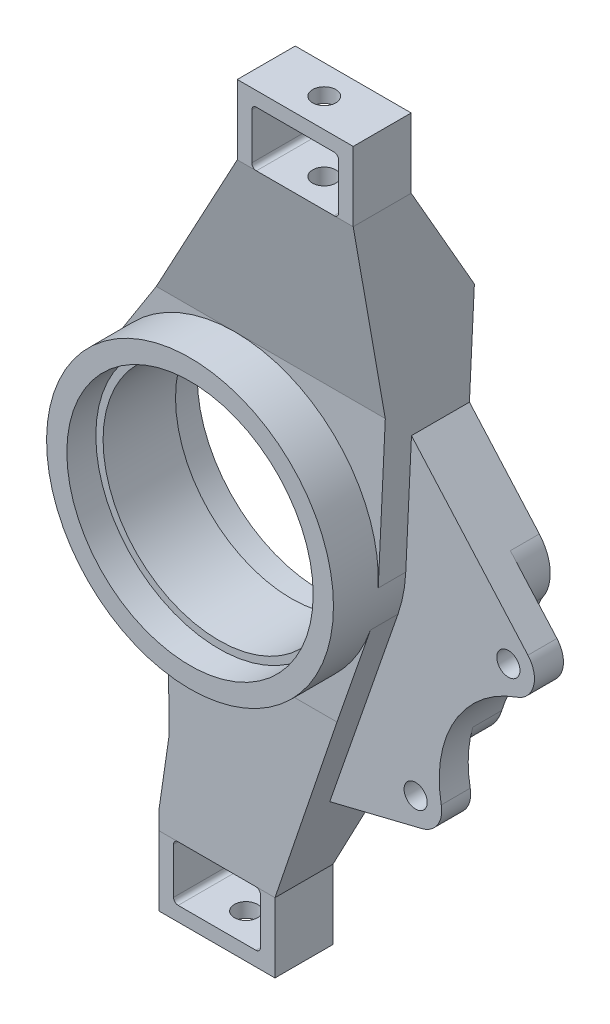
ISO-10303-21;
HEADER;
FILE_DESCRIPTION(('STEP AP214'),'2;1');
FILE_NAME('part.step','',(''),(''),'','','');
FILE_SCHEMA(('AUTOMOTIVE_DESIGN { 1 0 10303 214 1 1 1 1 }'));
ENDSEC;
DATA;
#1=APPLICATION_CONTEXT('core data for automotive mechanical design processes');
#2=APPLICATION_PROTOCOL_DEFINITION('international standard','automotive_design',2000,#1);
#3=PRODUCT_CONTEXT('',#1,'mechanical');
#4=PRODUCT('Part','Part','',(#3));
#5=PRODUCT_RELATED_PRODUCT_CATEGORY('part','',(#4));
#6=PRODUCT_DEFINITION_FORMATION('','',#4);
#7=PRODUCT_DEFINITION_CONTEXT('part definition',#1,'design');
#8=PRODUCT_DEFINITION('design','',#6,#7);
#9=PRODUCT_DEFINITION_SHAPE('','',#8);
#10=(LENGTH_UNIT() NAMED_UNIT(*) SI_UNIT(.MILLI.,.METRE.));
#11=(NAMED_UNIT(*) PLANE_ANGLE_UNIT() SI_UNIT($,.RADIAN.));
#12=(NAMED_UNIT(*) SI_UNIT($,.STERADIAN.) SOLID_ANGLE_UNIT());
#13=UNCERTAINTY_MEASURE_WITH_UNIT(LENGTH_MEASURE(1.E-05),#10,'distance_accuracy_value','');
#14=(GEOMETRIC_REPRESENTATION_CONTEXT(3) GLOBAL_UNCERTAINTY_ASSIGNED_CONTEXT((#13)) GLOBAL_UNIT_ASSIGNED_CONTEXT((#10,
#11,#12)) REPRESENTATION_CONTEXT('',''));
#15=CARTESIAN_POINT('',(0.,0.,0.));
#16=DIRECTION('',(0.,0.,1.));
#17=DIRECTION('',(1.,0.,0.));
#18=AXIS2_PLACEMENT_3D('',#15,#16,#17);
#19=CARTESIAN_POINT('',(0.,0.,45.));
#20=DIRECTION('',(0.,0.,-1.));
#21=DIRECTION('',(-1.,0.,0.));
#22=AXIS2_PLACEMENT_3D('',#19,#20,#21);
#23=CYLINDRICAL_SURFACE('',#22,40.);
#24=CARTESIAN_POINT('',(0.,0.,50.5));
#25=DIRECTION('',(0.,0.,1.));
#26=DIRECTION('',(1.,0.,0.));
#27=AXIS2_PLACEMENT_3D('',#24,#25,#26);
#28=CIRCLE('',#27,40.);
#29=CARTESIAN_POINT('',(-40.,0.,50.5));
#30=VERTEX_POINT('',#29);
#31=EDGE_CURVE('E1498',#30,#30,#28,.T.);
#32=CARTESIAN_POINT('',(0.,0.,25.5));
#33=DIRECTION('',(0.,0.,-1.));
#34=DIRECTION('',(-1.,0.,0.));
#35=AXIS2_PLACEMENT_3D('',#32,#33,#34);
#36=CIRCLE('',#35,40.);
#37=CARTESIAN_POINT('',(-40.,0.,25.5));
#38=VERTEX_POINT('',#37);
#39=EDGE_CURVE('E1507',#38,#38,#36,.T.);
#40=CARTESIAN_POINT('',(-40.,0.,50.5));
#41=CARTESIAN_POINT('',(-40.,0.,50.2395833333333));
#42=CARTESIAN_POINT('',(-40.,0.,49.9791666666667));
#43=CARTESIAN_POINT('',(-40.,0.,49.4583333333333));
#44=CARTESIAN_POINT('',(-40.,0.,49.1979166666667));
#45=CARTESIAN_POINT('',(-40.,0.,48.6770833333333));
#46=CARTESIAN_POINT('',(-40.,0.,48.4166666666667));
#47=CARTESIAN_POINT('',(-40.,0.,47.8958333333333));
#48=CARTESIAN_POINT('',(-40.,0.,47.6354166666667));
#49=CARTESIAN_POINT('',(-40.,0.,47.1145833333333));
#50=CARTESIAN_POINT('',(-40.,0.,46.8541666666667));
#51=CARTESIAN_POINT('',(-40.,0.,46.3333333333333));
#52=CARTESIAN_POINT('',(-40.,0.,46.0729166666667));
#53=CARTESIAN_POINT('',(-40.,0.,45.5520833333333));
#54=CARTESIAN_POINT('',(-40.,0.,45.2916666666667));
#55=CARTESIAN_POINT('',(-40.,0.,44.7708333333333));
#56=CARTESIAN_POINT('',(-40.,0.,44.5104166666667));
#57=CARTESIAN_POINT('',(-40.,0.,43.9895833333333));
#58=CARTESIAN_POINT('',(-40.,0.,43.7291666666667));
#59=CARTESIAN_POINT('',(-40.,0.,43.2083333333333));
#60=CARTESIAN_POINT('',(-40.,0.,42.9479166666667));
#61=CARTESIAN_POINT('',(-40.,0.,42.4270833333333));
#62=CARTESIAN_POINT('',(-40.,0.,42.1666666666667));
#63=CARTESIAN_POINT('',(-40.,0.,41.6458333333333));
#64=CARTESIAN_POINT('',(-40.,0.,41.3854166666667));
#65=CARTESIAN_POINT('',(-40.,0.,40.8645833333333));
#66=CARTESIAN_POINT('',(-40.,0.,40.6041666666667));
#67=CARTESIAN_POINT('',(-40.,0.,40.0833333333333));
#68=CARTESIAN_POINT('',(-40.,0.,39.8229166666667));
#69=CARTESIAN_POINT('',(-40.,0.,39.3020833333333));
#70=CARTESIAN_POINT('',(-40.,0.,39.0416666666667));
#71=CARTESIAN_POINT('',(-40.,0.,38.5208333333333));
#72=CARTESIAN_POINT('',(-40.,0.,38.2604166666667));
#73=CARTESIAN_POINT('',(-40.,0.,37.7395833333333));
#74=CARTESIAN_POINT('',(-40.,0.,37.4791666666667));
#75=CARTESIAN_POINT('',(-40.,0.,36.9583333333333));
#76=CARTESIAN_POINT('',(-40.,0.,36.6979166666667));
#77=CARTESIAN_POINT('',(-40.,0.,36.1770833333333));
#78=CARTESIAN_POINT('',(-40.,0.,35.9166666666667));
#79=CARTESIAN_POINT('',(-40.,0.,35.3958333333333));
#80=CARTESIAN_POINT('',(-40.,0.,35.1354166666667));
#81=CARTESIAN_POINT('',(-40.,0.,34.6145833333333));
#82=CARTESIAN_POINT('',(-40.,0.,34.3541666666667));
#83=CARTESIAN_POINT('',(-40.,0.,33.8333333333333));
#84=CARTESIAN_POINT('',(-40.,0.,33.5729166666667));
#85=CARTESIAN_POINT('',(-40.,0.,33.0520833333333));
#86=CARTESIAN_POINT('',(-40.,0.,32.7916666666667));
#87=CARTESIAN_POINT('',(-40.,0.,32.2708333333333));
#88=CARTESIAN_POINT('',(-40.,0.,32.0104166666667));
#89=CARTESIAN_POINT('',(-40.,0.,31.4895833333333));
#90=CARTESIAN_POINT('',(-40.,0.,31.2291666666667));
#91=CARTESIAN_POINT('',(-40.,0.,30.7083333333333));
#92=CARTESIAN_POINT('',(-40.,0.,30.4479166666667));
#93=CARTESIAN_POINT('',(-40.,0.,29.9270833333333));
#94=CARTESIAN_POINT('',(-40.,0.,29.6666666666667));
#95=CARTESIAN_POINT('',(-40.,0.,29.1458333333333));
#96=CARTESIAN_POINT('',(-40.,0.,28.8854166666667));
#97=CARTESIAN_POINT('',(-40.,0.,28.3645833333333));
#98=CARTESIAN_POINT('',(-40.,0.,28.1041666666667));
#99=CARTESIAN_POINT('',(-40.,0.,27.5833333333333));
#100=CARTESIAN_POINT('',(-40.,0.,27.3229166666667));
#101=CARTESIAN_POINT('',(-40.,0.,26.8020833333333));
#102=CARTESIAN_POINT('',(-40.,0.,26.5416666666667));
#103=CARTESIAN_POINT('',(-40.,0.,26.0208333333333));
#104=CARTESIAN_POINT('',(-40.,0.,25.7604166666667));
#105=CARTESIAN_POINT('',(-40.,0.,25.5));
#106=B_SPLINE_CURVE_WITH_KNOTS('',3,(#40,#41,#42,#43,#44,#45,#46,#47,#48,#49,#50,#51,#52,#53,
#54,#55,#56,#57,#58,#59,#60,#61,#62,#63,#64,#65,#66,#67,#68,#69,#70,#71,#72,#73,#74,#75,#76,#77,
#78,#79,#80,#81,#82,#83,#84,#85,#86,#87,#88,#89,#90,#91,#92,#93,#94,#95,#96,#97,#98,#99,#100,
#101,#102,#103,#104,#105),.UNSPECIFIED.,.F.,.F.,(4,2,2,2,2,2,2,2,2,2,2,2,2,2,2,2,2,2,2,2,2,2,2,
2,2,2,2,2,2,2,2,2,4),(0.,0.781249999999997,1.56249999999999,2.34375,3.125,3.90624999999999,
4.6875,5.46874999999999,6.24999999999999,7.03124999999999,7.81249999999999,8.59374999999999,
9.37499999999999,10.15625,10.9375,11.71875,12.5,13.28125,14.0625,14.84375,15.625,16.40625,
17.1875,17.96875,18.75,19.53125,20.3125,21.09375,21.875,22.65625,23.4375,24.21875,25.),.UNSPECIFIED.);
#107=EDGE_CURVE('BSEAM40',#30,#38,#106,.T.);
#108=ORIENTED_EDGE('',*,*,#31,.T.);
#109=ORIENTED_EDGE('',*,*,#39,.T.);
#110=ORIENTED_EDGE('',*,*,#107,.T.);
#111=ORIENTED_EDGE('',*,*,#107,.F.);
#112=EDGE_LOOP('',(#108,#110,#109,#111));
#113=FACE_BOUND('',#112,.T.);
#114=ADVANCED_FACE('F40',(#113),#23,.F.);
#115=CARTESIAN_POINT('',(0.,0.,45.));
#116=DIRECTION('',(0.,0.,-1.));
#117=DIRECTION('',(-1.,0.,0.));
#118=AXIS2_PLACEMENT_3D('',#115,#116,#117);
#119=CYLINDRICAL_SURFACE('',#118,49.5);
#120=CARTESIAN_POINT('',(0.,0.,15.5));
#121=DIRECTION('',(0.,0.,-1.));
#122=DIRECTION('',(-1.,0.,0.));
#123=AXIS2_PLACEMENT_3D('',#120,#121,#122);
#124=CIRCLE('',#123,49.5);
#125=CARTESIAN_POINT('',(-14.183667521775,47.4243985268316,15.5));
#126=VERTEX_POINT('',#125);
#127=CARTESIAN_POINT('',(38.9534720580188,30.5430354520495,15.5));
#128=VERTEX_POINT('',#127);
#129=EDGE_CURVE('E617',#126,#128,#124,.T.);
#130=ORIENTED_EDGE('',*,*,#129,.F.);
#131=DIRECTION('',(0.,0.,-1.));
#132=VECTOR('',#131,1.);
#133=CARTESIAN_POINT('',(-14.183667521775,47.4243985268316,45.));
#134=LINE('',#133,#132);
#135=CARTESIAN_POINT('',(-14.183667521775,47.4243985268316,42.5));
#136=VERTEX_POINT('',#135);
#137=EDGE_CURVE('E809',#126,#136,#134,.F.);
#138=ORIENTED_EDGE('',*,*,#137,.T.);
#139=CARTESIAN_POINT('',(0.,0.,42.5));
#140=DIRECTION('',(0.,0.,1.));
#141=DIRECTION('',(1.,0.,0.));
#142=AXIS2_PLACEMENT_3D('',#139,#140,#141);
#143=CIRCLE('',#142,49.5);
#144=CARTESIAN_POINT('',(38.9534720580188,30.5430354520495,42.5));
#145=VERTEX_POINT('',#144);
#146=EDGE_CURVE('E857',#145,#136,#143,.T.);
#147=ORIENTED_EDGE('',*,*,#146,.F.);
#148=DIRECTION('',(0.,0.,-1.));
#149=VECTOR('',#148,1.);
#150=CARTESIAN_POINT('',(38.9534720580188,30.5430354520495,45.));
#151=LINE('',#150,#149);
#152=EDGE_CURVE('E806',#145,#128,#151,.T.);
#153=ORIENTED_EDGE('',*,*,#152,.T.);
#154=EDGE_LOOP('',(#130,#138,#147,#153));
#155=FACE_BOUND('',#154,.T.);
#156=ADVANCED_FACE('F856',(#155),#119,.T.);
#157=CARTESIAN_POINT('',(49.445085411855,-2.33099305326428,15.5));
#158=VERTEX_POINT('',#157);
#159=CARTESIAN_POINT('',(46.7629364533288,-16.2319984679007,15.5));
#160=VERTEX_POINT('',#159);
#161=EDGE_CURVE('E2606',#158,#160,#124,.T.);
#162=ORIENTED_EDGE('',*,*,#161,.F.);
#163=DIRECTION('',(0.,0.,-1.));
#164=VECTOR('',#163,1.);
#165=CARTESIAN_POINT('',(49.445085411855,-2.33099305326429,15.5));
#166=LINE('',#165,#164);
#167=CARTESIAN_POINT('',(49.445085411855,-2.33099305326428,32.5));
#168=VERTEX_POINT('',#167);
#169=EDGE_CURVE('E1092',#168,#158,#166,.T.);
#170=ORIENTED_EDGE('',*,*,#169,.F.);
#171=CARTESIAN_POINT('',(-1.17961196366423E-12,4.33680868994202E-13,32.5));
#172=DIRECTION('',(0.,0.,1.));
#173=DIRECTION('',(1.,0.,0.));
#174=AXIS2_PLACEMENT_3D('',#171,#172,#173);
#175=CIRCLE('',#174,49.5000000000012);
#176=CARTESIAN_POINT('',(46.7629364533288,-16.2319984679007,32.5));
#177=VERTEX_POINT('',#176);
#178=EDGE_CURVE('E927',#177,#168,#175,.T.);
#179=ORIENTED_EDGE('',*,*,#178,.F.);
#180=DIRECTION('',(0.,0.,-1.));
#181=VECTOR('',#180,1.);
#182=CARTESIAN_POINT('',(46.7629364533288,-16.2319984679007,15.5));
#183=LINE('',#182,#181);
#184=EDGE_CURVE('E1089',#177,#160,#183,.T.);
#185=ORIENTED_EDGE('',*,*,#184,.T.);
#186=EDGE_LOOP('',(#162,#170,#179,#185));
#187=FACE_BOUND('',#186,.T.);
#188=ADVANCED_FACE('F1307',(#187),#119,.T.);
#189=CARTESIAN_POINT('',(24.7939264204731,-42.8428665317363,15.5));
#190=VERTEX_POINT('',#189);
#191=CARTESIAN_POINT('',(-13.0457943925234,-47.7499450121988,15.5));
#192=VERTEX_POINT('',#191);
#193=EDGE_CURVE('E614',#190,#192,#124,.T.);
#194=ORIENTED_EDGE('',*,*,#193,.F.);
#195=DIRECTION('',(0.,0.,-1.));
#196=VECTOR('',#195,1.);
#197=CARTESIAN_POINT('',(24.7939264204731,-42.8428665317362,45.));
#198=LINE('',#197,#196);
#199=CARTESIAN_POINT('',(24.7939264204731,-42.8428665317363,42.5));
#200=VERTEX_POINT('',#199);
#201=EDGE_CURVE('E811',#190,#200,#198,.F.);
#202=ORIENTED_EDGE('',*,*,#201,.T.);
#203=CARTESIAN_POINT('',(0.,0.,42.5));
#204=DIRECTION('',(0.,0.,1.));
#205=DIRECTION('',(1.,0.,0.));
#206=AXIS2_PLACEMENT_3D('',#203,#204,#205);
#207=CIRCLE('',#206,49.5);
#208=CARTESIAN_POINT('',(-13.0457943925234,-47.7499450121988,42.5));
#209=VERTEX_POINT('',#208);
#210=EDGE_CURVE('E1436',#209,#200,#207,.T.);
#211=ORIENTED_EDGE('',*,*,#210,.F.);
#212=DIRECTION('',(0.,0.,-1.));
#213=VECTOR('',#212,1.);
#214=CARTESIAN_POINT('',(-13.0457943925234,-47.7499450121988,45.));
#215=LINE('',#214,#213);
#216=EDGE_CURVE('E813',#209,#192,#215,.T.);
#217=ORIENTED_EDGE('',*,*,#216,.T.);
#218=EDGE_LOOP('',(#194,#202,#211,#217));
#219=FACE_BOUND('',#218,.T.);
#220=ADVANCED_FACE('F2178',(#219),#119,.T.);
#221=CARTESIAN_POINT('',(0.,0.,60.5));
#222=DIRECTION('',(0.,0.,1.));
#223=DIRECTION('',(1.,0.,0.));
#224=AXIS2_PLACEMENT_3D('',#221,#222,#223);
#225=CIRCLE('',#224,49.5);
#226=CARTESIAN_POINT('',(49.5,0.,60.5));
#227=VERTEX_POINT('',#226);
#228=EDGE_CURVE('E1489',#227,#227,#225,.T.);
#229=ORIENTED_EDGE('',*,*,#228,.F.);
#230=EDGE_LOOP('',(#229));
#231=FACE_BOUND('',#230,.T.);
#232=CARTESIAN_POINT('',(-43.7290332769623,-23.1952936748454,15.5));
#233=VERTEX_POINT('',#232);
#234=CARTESIAN_POINT('',(-41.7244628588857,26.6330471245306,15.5));
#235=VERTEX_POINT('',#234);
#236=EDGE_CURVE('E601',#233,#235,#124,.T.);
#237=ORIENTED_EDGE('',*,*,#236,.F.);
#238=DIRECTION('',(0.,0.,-1.));
#239=VECTOR('',#238,1.);
#240=CARTESIAN_POINT('',(-43.7290332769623,-23.1952936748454,59.1875));
#241=LINE('',#240,#239);
#242=CARTESIAN_POINT('',(-43.7290332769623,-23.1952936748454,45.));
#243=VERTEX_POINT('',#242);
#244=EDGE_CURVE('E634',#243,#233,#241,.T.);
#245=ORIENTED_EDGE('',*,*,#244,.F.);
#246=CARTESIAN_POINT('',(0.,0.,45.));
#247=DIRECTION('',(0.,0.,1.));
#248=DIRECTION('',(1.,0.,0.));
#249=AXIS2_PLACEMENT_3D('',#246,#247,#248);
#250=CIRCLE('',#249,49.5);
#251=CARTESIAN_POINT('',(0.,-49.5,45.));
#252=VERTEX_POINT('',#251);
#253=EDGE_CURVE('E1275',#243,#252,#250,.T.);
#254=ORIENTED_EDGE('',*,*,#253,.T.);
#255=CARTESIAN_POINT('',(46.7629364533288,-16.2319984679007,45.));
#256=VERTEX_POINT('',#255);
#257=EDGE_CURVE('E1277',#252,#256,#250,.T.);
#258=ORIENTED_EDGE('',*,*,#257,.T.);
#259=DIRECTION('',(0.,0.,1.));
#260=VECTOR('',#259,1.);
#261=CARTESIAN_POINT('',(46.7629364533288,-16.2319984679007,35.5));
#262=LINE('',#261,#260);
#263=CARTESIAN_POINT('',(46.7629364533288,-16.2319984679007,35.5));
#264=VERTEX_POINT('',#263);
#265=EDGE_CURVE('E1070',#264,#256,#262,.T.);
#266=ORIENTED_EDGE('',*,*,#265,.F.);
#267=CARTESIAN_POINT('',(-2.0122792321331E-13,1.11022302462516E-13,35.5));
#268=DIRECTION('',(0.,0.,-1.));
#269=DIRECTION('',(-1.,0.,0.));
#270=AXIS2_PLACEMENT_3D('',#267,#268,#269);
#271=CIRCLE('',#270,49.5000000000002);
#272=CARTESIAN_POINT('',(49.445085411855,-2.33099305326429,35.5));
#273=VERTEX_POINT('',#272);
#274=EDGE_CURVE('E1054',#273,#264,#271,.T.);
#275=ORIENTED_EDGE('',*,*,#274,.F.);
#276=DIRECTION('',(0.,0.,1.));
#277=VECTOR('',#276,1.);
#278=CARTESIAN_POINT('',(49.445085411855,-2.33099305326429,35.5));
#279=LINE('',#278,#277);
#280=CARTESIAN_POINT('',(49.445085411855,-2.33099305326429,45.));
#281=VERTEX_POINT('',#280);
#282=EDGE_CURVE('E1067',#273,#281,#279,.T.);
#283=ORIENTED_EDGE('',*,*,#282,.T.);
#284=CARTESIAN_POINT('',(0.,49.5,45.));
#285=VERTEX_POINT('',#284);
#286=EDGE_CURVE('E1285',#281,#285,#250,.T.);
#287=ORIENTED_EDGE('',*,*,#286,.T.);
#288=CARTESIAN_POINT('',(-41.7244628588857,26.6330471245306,45.));
#289=VERTEX_POINT('',#288);
#290=EDGE_CURVE('E631',#285,#289,#250,.T.);
#291=ORIENTED_EDGE('',*,*,#290,.T.);
#292=DIRECTION('',(0.,0.,-1.));
#293=VECTOR('',#292,1.);
#294=CARTESIAN_POINT('',(-41.7244628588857,26.6330471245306,59.1875));
#295=LINE('',#294,#293);
#296=EDGE_CURVE('E623',#289,#235,#295,.T.);
#297=ORIENTED_EDGE('',*,*,#296,.T.);
#298=EDGE_LOOP('',(#237,#245,#254,#258,#266,#275,#283,#287,#291,#297));
#299=FACE_BOUND('',#298,.T.);
#300=ADVANCED_FACE('F629',(#231,#299),#119,.T.);
#301=CARTESIAN_POINT('',(0.,0.,45.));
#302=DIRECTION('',(0.,0.,1.));
#303=DIRECTION('',(1.,0.,0.));
#304=AXIS2_PLACEMENT_3D('',#301,#302,#303);
#305=PLANE('',#304);
#306=DIRECTION('',(-0.32791916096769,-0.944705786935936,0.));
#307=VECTOR('',#306,1.);
#308=CARTESIAN_POINT('',(46.7629364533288,-16.2319984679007,45.));
#309=LINE('',#308,#307);
#310=CARTESIAN_POINT('',(35.2151982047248,-49.5,45.));
#311=VERTEX_POINT('',#310);
#312=EDGE_CURVE('E1040',#256,#311,#309,.T.);
#313=ORIENTED_EDGE('',*,*,#312,.F.);
#314=ORIENTED_EDGE('',*,*,#257,.F.);
#315=DIRECTION('',(1.,0.,0.));
#316=VECTOR('',#315,1.);
#317=CARTESIAN_POINT('',(-49.4599927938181,-49.5,45.));
#318=LINE('',#317,#316);
#319=EDGE_CURVE('E1171',#252,#311,#318,.T.);
#320=ORIENTED_EDGE('',*,*,#319,.T.);
#321=EDGE_LOOP('',(#313,#314,#320));
#322=FACE_BOUND('',#321,.T.);
#323=ADVANCED_FACE('F1283',(#322),#305,.T.);
#324=CARTESIAN_POINT('',(-29.7761662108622,-49.5,45.));
#325=VERTEX_POINT('',#324);
#326=EDGE_CURVE('E1168',#325,#252,#318,.T.);
#327=ORIENTED_EDGE('',*,*,#326,.T.);
#328=ORIENTED_EDGE('',*,*,#253,.F.);
#329=DIRECTION('',(0.468591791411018,-0.883414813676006,0.));
#330=VECTOR('',#329,1.);
#331=CARTESIAN_POINT('',(-43.7290332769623,-23.1952936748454,45.));
#332=LINE('',#331,#330);
#333=EDGE_CURVE('E1183',#243,#325,#332,.T.);
#334=ORIENTED_EDGE('',*,*,#333,.T.);
#335=EDGE_LOOP('',(#327,#328,#334));
#336=FACE_BOUND('',#335,.T.);
#337=ADVANCED_FACE('F1289',(#336),#305,.T.);
#338=DIRECTION('',(0.538041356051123,0.84291844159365,0.));
#339=VECTOR('',#338,1.);
#340=CARTESIAN_POINT('',(-41.7244628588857,26.6330471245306,45.));
#341=LINE('',#340,#339);
#342=CARTESIAN_POINT('',(-27.1283101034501,49.5,45.));
#343=VERTEX_POINT('',#342);
#344=EDGE_CURVE('E1185',#289,#343,#341,.T.);
#345=ORIENTED_EDGE('',*,*,#344,.F.);
#346=ORIENTED_EDGE('',*,*,#290,.F.);
#347=DIRECTION('',(1.,0.,0.));
#348=VECTOR('',#347,1.);
#349=CARTESIAN_POINT('',(-49.4599927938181,49.5,45.));
#350=LINE('',#349,#348);
#351=EDGE_CURVE('E1163',#343,#285,#350,.T.);
#352=ORIENTED_EDGE('',*,*,#351,.F.);
#353=EDGE_LOOP('',(#345,#346,#352));
#354=FACE_BOUND('',#353,.T.);
#355=ADVANCED_FACE('F1291',(#354),#305,.T.);
#356=CARTESIAN_POINT('',(51.8885574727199,49.5,45.));
#357=VERTEX_POINT('',#356);
#358=EDGE_CURVE('E1167',#285,#357,#350,.T.);
#359=ORIENTED_EDGE('',*,*,#358,.F.);
#360=ORIENTED_EDGE('',*,*,#286,.F.);
#361=DIRECTION('',(-0.0470907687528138,-0.998890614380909,0.));
#362=VECTOR('',#361,1.);
#363=CARTESIAN_POINT('',(49.445085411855,-2.33099305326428,45.));
#364=LINE('',#363,#362);
#365=EDGE_CURVE('E1187',#357,#281,#364,.T.);
#366=ORIENTED_EDGE('',*,*,#365,.F.);
#367=EDGE_LOOP('',(#359,#360,#366));
#368=FACE_BOUND('',#367,.T.);
#369=ADVANCED_FACE('F1297',(#368),#305,.T.);
#370=CARTESIAN_POINT('',(42.0394075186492,-14.5924026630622,100.29896625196));
#371=DIRECTION('',(0.944705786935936,-0.32791916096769,0.));
#372=DIRECTION('',(0.32791916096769,0.944705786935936,0.));
#373=AXIS2_PLACEMENT_3D('',#370,#371,#372);
#374=PLANE('',#373);
#375=DIRECTION('',(-0.32791916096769,-0.944705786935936,0.));
#376=VECTOR('',#375,1.);
#377=CARTESIAN_POINT('',(42.0394075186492,-14.5924026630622,42.5));
#378=LINE('',#377,#376);
#379=CARTESIAN_POINT('',(30.5762991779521,-47.6165929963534,42.5));
#380=VERTEX_POINT('',#379);
#381=CARTESIAN_POINT('',(29.4886545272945,-50.75,42.5));
#382=VERTEX_POINT('',#381);
#383=EDGE_CURVE('E1435',#380,#382,#378,.T.);
#384=ORIENTED_EDGE('',*,*,#383,.F.);
#385=DIRECTION('',(0.,0.,1.));
#386=VECTOR('',#385,1.);
#387=CARTESIAN_POINT('',(30.5762991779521,-47.6165929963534,15.5));
#388=LINE('',#387,#386);
#389=CARTESIAN_POINT('',(30.5762991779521,-47.6165929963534,15.5));
#390=VERTEX_POINT('',#389);
#391=EDGE_CURVE('E826',#380,#390,#388,.F.);
#392=ORIENTED_EDGE('',*,*,#391,.T.);
#393=DIRECTION('',(-0.32791916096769,-0.944705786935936,0.));
#394=VECTOR('',#393,1.);
#395=CARTESIAN_POINT('',(42.0394075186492,-14.5924026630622,15.5));
#396=LINE('',#395,#394);
#397=CARTESIAN_POINT('',(21.349897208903,-74.1970322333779,15.5));
#398=VERTEX_POINT('',#397);
#399=EDGE_CURVE('E1444',#390,#398,#396,.T.);
#400=ORIENTED_EDGE('',*,*,#399,.T.);
#401=DIRECTION('',(0.,0.,1.));
#402=VECTOR('',#401,1.);
#403=CARTESIAN_POINT('',(21.349897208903,-74.1970322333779,100.29896625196));
#404=LINE('',#403,#402);
#405=CARTESIAN_POINT('',(21.349897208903,-74.1970322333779,42.1862620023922));
#406=VERTEX_POINT('',#405);
#407=EDGE_CURVE('E699',#398,#406,#404,.T.);
#408=ORIENTED_EDGE('',*,*,#407,.T.);
#409=DIRECTION('',(0.327895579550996,0.944637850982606,0.0119924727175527));
#410=VECTOR('',#409,1.);
#411=CARTESIAN_POINT('',(42.3406095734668,-13.7246664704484,42.9539775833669));
#412=LINE('',#411,#410);
#413=CARTESIAN_POINT('',(29.4886545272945,-50.75,42.4839294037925));
#414=VERTEX_POINT('',#413);
#415=EDGE_CURVE('E1463',#406,#414,#412,.T.);
#416=ORIENTED_EDGE('',*,*,#415,.T.);
#417=DIRECTION('',(0.,0.,-1.));
#418=VECTOR('',#417,1.);
#419=CARTESIAN_POINT('',(29.4886545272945,-50.75,100.29896625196));
#420=LINE('',#419,#418);
#421=EDGE_CURVE('E1430',#382,#414,#420,.T.);
#422=ORIENTED_EDGE('',*,*,#421,.F.);
#423=EDGE_LOOP('',(#384,#392,#400,#408,#416,#422));
#424=FACE_BOUND('',#423,.T.);
#425=ADVANCED_FACE('F1552',(#424),#374,.F.);
#426=CARTESIAN_POINT('',(-49.4599927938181,-0.547437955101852,43.1212666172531));
#427=DIRECTION('',(0.,0.0126942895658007,-0.999919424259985));
#428=DIRECTION('',(0.,0.999919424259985,0.0126942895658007));
#429=AXIS2_PLACEMENT_3D('',#426,#427,#428);
#430=PLANE('',#429);
#431=DIRECTION('',(0.,-0.999919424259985,-0.0126942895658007));
#432=VECTOR('',#431,1.);
#433=CARTESIAN_POINT('',(-18.1,0.969918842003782,43.1405299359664));
#434=LINE('',#433,#432);
#435=CARTESIAN_POINT('',(-18.1,-51.608526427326,42.4730301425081));
#436=VERTEX_POINT('',#435);
#437=CARTESIAN_POINT('',(-18.1,-74.0311495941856,42.1883679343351));
#438=VERTEX_POINT('',#437);
#439=EDGE_CURVE('E1474',#436,#438,#434,.T.);
#440=ORIENTED_EDGE('',*,*,#439,.F.);
#441=CARTESIAN_POINT('',(-14.1,-51.6085264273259,42.4730301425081));
#442=DIRECTION('',(0.,0.0126942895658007,-0.999919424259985));
#443=DIRECTION('',(0.,-0.999919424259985,-0.0126942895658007));
#444=AXIS2_PLACEMENT_3D('',#441,#442,#443);
#445=ELLIPSE('',#444,4.00032232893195,4.);
#446=CARTESIAN_POINT('',(-18.0067803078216,-50.75,42.4839294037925));
#447=VERTEX_POINT('',#446);
#448=EDGE_CURVE('E818',#436,#447,#445,.T.);
#449=ORIENTED_EDGE('',*,*,#448,.T.);
#450=DIRECTION('',(1.,0.,0.));
#451=VECTOR('',#450,1.);
#452=CARTESIAN_POINT('',(0.,-50.75,42.4839294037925));
#453=LINE('',#452,#451);
#454=EDGE_CURVE('E1472',#447,#414,#453,.T.);
#455=ORIENTED_EDGE('',*,*,#454,.T.);
#456=ORIENTED_EDGE('',*,*,#415,.F.);
#457=DIRECTION('',(-0.899867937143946,-0.436127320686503,-0.00553677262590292));
#458=VECTOR('',#457,1.);
#459=CARTESIAN_POINT('',(-7.08032569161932,-87.9759395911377,42.0113344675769));
#460=LINE('',#459,#458);
#461=CARTESIAN_POINT('',(15.5022210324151,-77.0311495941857,42.1502819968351));
#462=VERTEX_POINT('',#461);
#463=EDGE_CURVE('E694',#406,#462,#460,.T.);
#464=ORIENTED_EDGE('',*,*,#463,.T.);
#465=DIRECTION('',(-1.,0.,0.));
#466=VECTOR('',#465,1.);
#467=CARTESIAN_POINT('',(-18.1,-77.0311495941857,42.1502819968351));
#468=LINE('',#467,#466);
#469=CARTESIAN_POINT('',(-15.1,-77.0311495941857,42.1502819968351));
#470=VERTEX_POINT('',#469);
#471=EDGE_CURVE('E1482',#462,#470,#468,.T.);
#472=ORIENTED_EDGE('',*,*,#471,.T.);
#473=DIRECTION('',(-0.707078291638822,0.707078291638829,0.00897657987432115));
#474=VECTOR('',#473,1.);
#475=CARTESIAN_POINT('',(-70.5235493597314,-21.6076002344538,42.8539012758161));
#476=LINE('',#475,#474);
#477=EDGE_CURVE('E696',#470,#438,#476,.T.);
#478=ORIENTED_EDGE('',*,*,#477,.T.);
#479=EDGE_LOOP('',(#440,#449,#455,#456,#464,#472,#478));
#480=FACE_BOUND('',#479,.T.);
#481=ADVANCED_FACE('F1539',(#480),#430,.T.);
#482=CARTESIAN_POINT('',(0.,-50.75,100.29896625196));
#483=DIRECTION('',(0.,-1.,0.));
#484=DIRECTION('',(0.,0.,-1.));
#485=AXIS2_PLACEMENT_3D('',#482,#483,#484);
#486=PLANE('',#485);
#487=ORIENTED_EDGE('',*,*,#454,.F.);
#488=DIRECTION('',(0.,0.,-1.));
#489=VECTOR('',#488,1.);
#490=CARTESIAN_POINT('',(-18.0067803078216,-50.75,42.4839294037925));
#491=LINE('',#490,#489);
#492=CARTESIAN_POINT('',(-18.0067803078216,-50.75,42.5));
#493=VERTEX_POINT('',#492);
#494=EDGE_CURVE('E820',#447,#493,#491,.F.);
#495=ORIENTED_EDGE('',*,*,#494,.T.);
#496=DIRECTION('',(-1.,0.,0.));
#497=VECTOR('',#496,1.);
#498=CARTESIAN_POINT('',(0.,-50.75,42.5));
#499=LINE('',#498,#497);
#500=EDGE_CURVE('E1439',#382,#493,#499,.T.);
#501=ORIENTED_EDGE('',*,*,#500,.F.);
#502=ORIENTED_EDGE('',*,*,#421,.T.);
#503=EDGE_LOOP('',(#487,#495,#501,#502));
#504=FACE_BOUND('',#503,.T.);
#505=ADVANCED_FACE('F1557',(#504),#486,.F.);
#506=CARTESIAN_POINT('',(-49.4599927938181,-6.18650346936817,-16.369456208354));
#507=DIRECTION('',(0.,0.353524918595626,0.935425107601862));
#508=DIRECTION('',(0.,-0.935425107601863,0.353524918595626));
#509=AXIS2_PLACEMENT_3D('',#506,#507,#508);
#510=PLANE('',#509);
#511=DIRECTION('',(-1.,0.,0.));
#512=VECTOR('',#511,1.);
#513=CARTESIAN_POINT('',(-49.4599927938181,-90.5129198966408,15.5));
#514=LINE('',#513,#512);
#515=CARTESIAN_POINT('',(-19.2716952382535,-90.5129198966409,15.5));
#516=VERTEX_POINT('',#515);
#517=CARTESIAN_POINT('',(-24.3329463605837,-90.5129198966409,15.5));
#518=VERTEX_POINT('',#517);
#519=EDGE_CURVE('E883',#516,#518,#514,.T.);
#520=ORIENTED_EDGE('',*,*,#519,.F.);
#521=DIRECTION('',(-0.145307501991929,-0.925497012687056,0.349772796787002));
#522=VECTOR('',#521,1.);
#523=CARTESIAN_POINT('',(-6.94899000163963,-12.0267665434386,-14.1622474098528));
#524=LINE('',#523,#522);
#525=CARTESIAN_POINT('',(-21.3368349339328,-103.666271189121,20.4710419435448));
#526=VERTEX_POINT('',#525);
#527=EDGE_CURVE('E1449',#516,#526,#524,.T.);
#528=ORIENTED_EDGE('',*,*,#527,.T.);
#529=CARTESIAN_POINT('',(-19.7685468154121,-103.9125,20.5640991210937));
#530=DIRECTION('',(0.,0.353524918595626,0.935425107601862));
#531=DIRECTION('',(0.,-0.935425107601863,0.353524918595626));
#532=AXIS2_PLACEMENT_3D('',#529,#530,#531);
#533=ELLIPSE('',#532,1.69708936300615,1.5875);
#534=CARTESIAN_POINT('',(-19.7685468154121,-105.5,21.1640625));
#535=VERTEX_POINT('',#534);
#536=EDGE_CURVE('E774',#526,#535,#533,.T.);
#537=ORIENTED_EDGE('',*,*,#536,.T.);
#538=DIRECTION('',(1.,0.,0.));
#539=VECTOR('',#538,1.);
#540=CARTESIAN_POINT('',(-49.4599927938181,-105.5,21.1640625));
#541=LINE('',#540,#539);
#542=CARTESIAN_POINT('',(10.4842466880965,-105.5,21.1640625));
#543=VERTEX_POINT('',#542);
#544=EDGE_CURVE('E1452',#535,#543,#541,.T.);
#545=ORIENTED_EDGE('',*,*,#544,.T.);
#546=DIRECTION('',(0.308826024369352,0.889700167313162,-0.336244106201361));
#547=VECTOR('',#546,1.);
#548=CARTESIAN_POINT('',(35.9523005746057,-32.1288135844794,-6.56508705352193));
#549=LINE('',#548,#547);
#550=CARTESIAN_POINT('',(15.6864491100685,-90.5129198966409,15.5));
#551=VERTEX_POINT('',#550);
#552=EDGE_CURVE('E1457',#543,#551,#549,.T.);
#553=ORIENTED_EDGE('',*,*,#552,.T.);
#554=CARTESIAN_POINT('',(20.9791021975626,-90.5129198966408,15.5));
#555=VERTEX_POINT('',#554);
#556=EDGE_CURVE('E884',#555,#551,#514,.T.);
#557=ORIENTED_EDGE('',*,*,#556,.F.);
#558=DIRECTION('',(0.308826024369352,0.889700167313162,-0.336244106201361));
#559=VECTOR('',#558,1.);
#560=CARTESIAN_POINT('',(39.3112629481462,-37.6996036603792,-4.45972010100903));
#561=LINE('',#560,#559);
#562=CARTESIAN_POINT('',(13.,-113.5,24.1875));
#563=VERTEX_POINT('',#562);
#564=EDGE_CURVE('E1117',#563,#555,#561,.T.);
#565=ORIENTED_EDGE('',*,*,#564,.F.);
#566=DIRECTION('',(1.,0.,0.));
#567=VECTOR('',#566,1.);
#568=CARTESIAN_POINT('',(-49.4599927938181,-113.5,24.1875));
#569=LINE('',#568,#567);
#570=CARTESIAN_POINT('',(6.4125,-113.5,24.1875));
#571=VERTEX_POINT('',#570);
#572=EDGE_CURVE('E1113',#571,#563,#569,.T.);
#573=ORIENTED_EDGE('',*,*,#572,.F.);
#574=CARTESIAN_POINT('',(-20.4125,-113.5,24.1875));
#575=VERTEX_POINT('',#574);
#576=EDGE_CURVE('E1121',#575,#571,#569,.T.);
#577=ORIENTED_EDGE('',*,*,#576,.F.);
#578=CARTESIAN_POINT('',(-27.,-113.5,24.1875));
#579=VERTEX_POINT('',#578);
#580=EDGE_CURVE('E1118',#579,#575,#569,.T.);
#581=ORIENTED_EDGE('',*,*,#580,.F.);
#582=DIRECTION('',(0.,-0.935425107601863,0.353524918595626));
#583=VECTOR('',#582,1.);
#584=CARTESIAN_POINT('',(-27.,-25.7595780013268,-8.97221026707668));
#585=LINE('',#584,#583);
#586=CARTESIAN_POINT('',(-27.,-107.5,21.919921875));
#587=VERTEX_POINT('',#586);
#588=EDGE_CURVE('E1124',#587,#579,#585,.T.);
#589=ORIENTED_EDGE('',*,*,#588,.F.);
#590=DIRECTION('',(-0.145307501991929,-0.925497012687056,0.349772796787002));
#591=VECTOR('',#590,1.);
#592=CARTESIAN_POINT('',(-13.867246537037,-23.8544625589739,-9.69220995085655));
#593=LINE('',#592,#591);
#594=EDGE_CURVE('E1127',#518,#587,#593,.T.);
#595=ORIENTED_EDGE('',*,*,#594,.F.);
#596=EDGE_LOOP('',(#520,#528,#537,#545,#553,#557,#565,#573,#577,#581,#589,#595));
#597=FACE_BOUND('',#596,.T.);
#598=ADVANCED_FACE('F1560',(#597),#510,.F.);
#599=CARTESIAN_POINT('',(-43.7290332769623,-23.1952936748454,59.1875));
#600=DIRECTION('',(0.883414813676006,0.468591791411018,0.));
#601=DIRECTION('',(-0.468591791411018,0.883414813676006,0.));
#602=AXIS2_PLACEMENT_3D('',#599,#600,#601);
#603=PLANE('',#602);
#604=DIRECTION('',(0.468591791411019,-0.883414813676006,0.));
#605=VECTOR('',#604,1.);
#606=CARTESIAN_POINT('',(-43.7290332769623,-23.1952936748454,15.5));
#607=LINE('',#606,#605);
#608=CARTESIAN_POINT('',(-28.1,-52.66,15.5));
#609=VERTEX_POINT('',#608);
#610=EDGE_CURVE('E609',#233,#609,#607,.T.);
#611=ORIENTED_EDGE('',*,*,#610,.T.);
#612=DIRECTION('',(0.,0.,-1.));
#613=VECTOR('',#612,1.);
#614=CARTESIAN_POINT('',(-28.1,-52.66,59.1875));
#615=LINE('',#614,#613);
#616=CARTESIAN_POINT('',(-28.1,-52.66,44.9598828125));
#617=VERTEX_POINT('',#616);
#618=EDGE_CURVE('E638',#617,#609,#615,.T.);
#619=ORIENTED_EDGE('',*,*,#618,.F.);
#620=DIRECTION('',(-0.468562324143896,0.88335926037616,0.0112145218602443));
#621=VECTOR('',#620,1.);
#622=CARTESIAN_POINT('',(-43.8018295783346,-23.0580541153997,45.3356887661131));
#623=LINE('',#622,#621);
#624=EDGE_CURVE('E1205',#617,#325,#623,.T.);
#625=ORIENTED_EDGE('',*,*,#624,.T.);
#626=ORIENTED_EDGE('',*,*,#333,.F.);
#627=ORIENTED_EDGE('',*,*,#244,.T.);
#628=EDGE_LOOP('',(#611,#619,#625,#626,#627));
#629=FACE_BOUND('',#628,.T.);
#630=ADVANCED_FACE('F1273',(#629),#603,.F.);
#631=CARTESIAN_POINT('',(0.,-52.66,59.1875));
#632=DIRECTION('',(0.,1.,0.));
#633=DIRECTION('',(0.,0.,1.));
#634=AXIS2_PLACEMENT_3D('',#631,#632,#633);
#635=PLANE('',#634);
#636=DIRECTION('',(1.,0.,0.));
#637=VECTOR('',#636,1.);
#638=CARTESIAN_POINT('',(0.,-52.66,15.5));
#639=LINE('',#638,#637);
#640=CARTESIAN_POINT('',(-23.1,-52.66,15.5));
#641=VERTEX_POINT('',#640);
#642=EDGE_CURVE('E876',#609,#641,#639,.T.);
#643=ORIENTED_EDGE('',*,*,#642,.T.);
#644=DIRECTION('',(0.,0.,-1.));
#645=VECTOR('',#644,1.);
#646=CARTESIAN_POINT('',(-23.1,-52.66,59.1875));
#647=LINE('',#646,#645);
#648=CARTESIAN_POINT('',(-23.1,-52.66,44.9598828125));
#649=VERTEX_POINT('',#648);
#650=EDGE_CURVE('E1265',#649,#641,#647,.T.);
#651=ORIENTED_EDGE('',*,*,#650,.F.);
#652=DIRECTION('',(-1.,0.,0.));
#653=VECTOR('',#652,1.);
#654=CARTESIAN_POINT('',(0.,-52.66,44.9598828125));
#655=LINE('',#654,#653);
#656=EDGE_CURVE('E1202',#649,#617,#655,.T.);
#657=ORIENTED_EDGE('',*,*,#656,.T.);
#658=ORIENTED_EDGE('',*,*,#618,.T.);
#659=EDGE_LOOP('',(#643,#651,#657,#658));
#660=FACE_BOUND('',#659,.T.);
#661=ADVANCED_FACE('F1270',(#660),#635,.F.);
#662=CARTESIAN_POINT('',(-23.1,0.,59.1875));
#663=DIRECTION('',(1.,0.,0.));
#664=DIRECTION('',(0.,1.,0.));
#665=AXIS2_PLACEMENT_3D('',#662,#663,#664);
#666=PLANE('',#665);
#667=DIRECTION('',(0.,-1.,0.));
#668=VECTOR('',#667,1.);
#669=CARTESIAN_POINT('',(-23.1,0.,15.5));
#670=LINE('',#669,#668);
#671=CARTESIAN_POINT('',(-23.1,-82.66,15.5));
#672=VERTEX_POINT('',#671);
#673=EDGE_CURVE('E868',#641,#672,#670,.T.);
#674=ORIENTED_EDGE('',*,*,#673,.T.);
#675=DIRECTION('',(0.,0.,-1.));
#676=VECTOR('',#675,1.);
#677=CARTESIAN_POINT('',(-23.1,-82.66,59.1875));
#678=LINE('',#677,#676);
#679=CARTESIAN_POINT('',(-23.1,-82.66,44.5790234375));
#680=VERTEX_POINT('',#679);
#681=EDGE_CURVE('E1262',#680,#672,#678,.T.);
#682=ORIENTED_EDGE('',*,*,#681,.F.);
#683=DIRECTION('',(0.,0.999919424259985,0.0126942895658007));
#684=VECTOR('',#683,1.);
#685=CARTESIAN_POINT('',(-23.1,0.172109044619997,45.6306029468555));
#686=LINE('',#685,#684);
#687=EDGE_CURVE('E1199',#680,#649,#686,.T.);
#688=ORIENTED_EDGE('',*,*,#687,.T.);
#689=ORIENTED_EDGE('',*,*,#650,.T.);
#690=EDGE_LOOP('',(#674,#682,#688,#689));
#691=FACE_BOUND('',#690,.T.);
#692=ADVANCED_FACE('F1771',(#691),#666,.F.);
#693=CARTESIAN_POINT('',(-9.87847125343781,1.55096770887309,59.1875));
#694=DIRECTION('',(0.987898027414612,-0.155104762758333,0.));
#695=DIRECTION('',(0.155104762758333,0.987898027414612,0.));
#696=AXIS2_PLACEMENT_3D('',#693,#694,#695);
#697=PLANE('',#696);
#698=DIRECTION('',(-0.155104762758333,-0.987898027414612,0.));
#699=VECTOR('',#698,1.);
#700=CARTESIAN_POINT('',(-9.87847125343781,1.55096770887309,15.5));
#701=LINE('',#700,#699);
#702=EDGE_CURVE('E864',#672,#518,#701,.T.);
#703=ORIENTED_EDGE('',*,*,#702,.T.);
#704=ORIENTED_EDGE('',*,*,#594,.T.);
#705=DIRECTION('',(0.,0.,-1.));
#706=VECTOR('',#705,1.);
#707=CARTESIAN_POINT('',(-27.,-107.5,59.1875));
#708=LINE('',#707,#706);
#709=CARTESIAN_POINT('',(-27.,-107.5,44.263671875));
#710=VERTEX_POINT('',#709);
#711=EDGE_CURVE('E1259',#710,#587,#708,.T.);
#712=ORIENTED_EDGE('',*,*,#711,.F.);
#713=DIRECTION('',(0.155092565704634,0.9878203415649,0.0125406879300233));
#714=VECTOR('',#713,1.);
#715=CARTESIAN_POINT('',(-9.8521375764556,1.71869297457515,45.6502373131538));
#716=LINE('',#715,#714);
#717=EDGE_CURVE('E1196',#710,#680,#716,.T.);
#718=ORIENTED_EDGE('',*,*,#717,.T.);
#719=ORIENTED_EDGE('',*,*,#681,.T.);
#720=EDGE_LOOP('',(#703,#704,#712,#718,#719));
#721=FACE_BOUND('',#720,.T.);
#722=ADVANCED_FACE('F1755',(#721),#697,.F.);
#723=CARTESIAN_POINT('',(46.7629364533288,-16.2319984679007,59.1875));
#724=DIRECTION('',(-0.944705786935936,0.32791916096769,0.));
#725=DIRECTION('',(-0.32791916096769,-0.944705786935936,0.));
#726=AXIS2_PLACEMENT_3D('',#723,#724,#725);
#727=PLANE('',#726);
#728=DIRECTION('',(-0.32791916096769,-0.944705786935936,0.));
#729=VECTOR('',#728,1.);
#730=CARTESIAN_POINT('',(46.7629364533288,-16.2319984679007,15.5));
#731=LINE('',#730,#729);
#732=CARTESIAN_POINT('',(25.965556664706,-76.1473903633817,15.5));
#733=VERTEX_POINT('',#732);
#734=EDGE_CURVE('E881',#160,#733,#731,.T.);
#735=ORIENTED_EDGE('',*,*,#734,.F.);
#736=ORIENTED_EDGE('',*,*,#184,.F.);
#737=DIRECTION('',(0.32791916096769,0.944705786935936,0.));
#738=VECTOR('',#737,1.);
#739=CARTESIAN_POINT('',(25.965556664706,-76.1473903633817,32.5));
#740=LINE('',#739,#738);
#741=CARTESIAN_POINT('',(25.965556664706,-76.1473903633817,32.5));
#742=VERTEX_POINT('',#741);
#743=EDGE_CURVE('E924',#742,#177,#740,.T.);
#744=ORIENTED_EDGE('',*,*,#743,.F.);
#745=DIRECTION('',(0.,0.,-1.));
#746=VECTOR('',#745,1.);
#747=CARTESIAN_POINT('',(25.965556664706,-76.1473903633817,32.5));
#748=LINE('',#747,#746);
#749=EDGE_CURVE('E956',#742,#733,#748,.T.);
#750=ORIENTED_EDGE('',*,*,#749,.T.);
#751=EDGE_LOOP('',(#735,#736,#744,#750));
#752=FACE_BOUND('',#751,.T.);
#753=ADVANCED_FACE('F1751',(#752),#727,.F.);
#754=CARTESIAN_POINT('',(23.2290055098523,-84.0311495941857,15.5));
#755=VERTEX_POINT('',#754);
#756=EDGE_CURVE('E880',#755,#555,#731,.T.);
#757=ORIENTED_EDGE('',*,*,#756,.F.);
#758=DIRECTION('',(0.,0.,-1.));
#759=VECTOR('',#758,1.);
#760=CARTESIAN_POINT('',(23.2290055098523,-84.0311495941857,59.1875));
#761=LINE('',#760,#759);
#762=CARTESIAN_POINT('',(23.2290055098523,-84.0311495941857,35.5));
#763=VERTEX_POINT('',#762);
#764=EDGE_CURVE('E1247',#763,#755,#761,.T.);
#765=ORIENTED_EDGE('',*,*,#764,.F.);
#766=DIRECTION('',(-0.32791916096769,-0.944705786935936,0.));
#767=VECTOR('',#766,1.);
#768=CARTESIAN_POINT('',(46.7629364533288,-16.2319984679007,35.5));
#769=LINE('',#768,#767);
#770=EDGE_CURVE('E1057',#264,#763,#769,.T.);
#771=ORIENTED_EDGE('',*,*,#770,.F.);
#772=ORIENTED_EDGE('',*,*,#265,.T.);
#773=ORIENTED_EDGE('',*,*,#312,.T.);
#774=DIRECTION('',(-0.327895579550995,-0.944637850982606,-0.0119924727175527));
#775=VECTOR('',#774,1.);
#776=CARTESIAN_POINT('',(46.8170648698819,-16.076059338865,45.4243273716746));
#777=LINE('',#776,#775);
#778=CARTESIAN_POINT('',(13.,-113.5,44.1875));
#779=VERTEX_POINT('',#778);
#780=EDGE_CURVE('E1190',#311,#779,#777,.T.);
#781=ORIENTED_EDGE('',*,*,#780,.T.);
#782=DIRECTION('',(0.,0.,-1.));
#783=VECTOR('',#782,1.);
#784=CARTESIAN_POINT('',(13.,-113.5,59.1875));
#785=LINE('',#784,#783);
#786=EDGE_CURVE('E1250',#779,#563,#785,.T.);
#787=ORIENTED_EDGE('',*,*,#786,.T.);
#788=ORIENTED_EDGE('',*,*,#564,.T.);
#789=EDGE_LOOP('',(#757,#765,#771,#772,#773,#781,#787,#788));
#790=FACE_BOUND('',#789,.T.);
#791=ADVANCED_FACE('F1754',(#790),#727,.F.);
#792=CARTESIAN_POINT('',(49.445085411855,-2.33099305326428,59.1875));
#793=DIRECTION('',(0.998890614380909,-0.0470907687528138,0.));
#794=DIRECTION('',(0.0470907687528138,0.998890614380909,0.));
#795=AXIS2_PLACEMENT_3D('',#792,#793,#794);
#796=PLANE('',#795);
#797=ORIENTED_EDGE('',*,*,#169,.T.);
#798=DIRECTION('',(-0.0470907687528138,-0.998890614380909,0.));
#799=VECTOR('',#798,1.);
#800=CARTESIAN_POINT('',(49.445085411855,-2.33099305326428,15.5));
#801=LINE('',#800,#799);
#802=CARTESIAN_POINT('',(50.9409051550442,29.3983743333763,15.5));
#803=VERTEX_POINT('',#802);
#804=EDGE_CURVE('E887',#803,#158,#801,.T.);
#805=ORIENTED_EDGE('',*,*,#804,.F.);
#806=DIRECTION('',(0.,0.,-1.));
#807=VECTOR('',#806,1.);
#808=CARTESIAN_POINT('',(50.9409051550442,29.3983743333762,32.5));
#809=LINE('',#808,#807);
#810=CARTESIAN_POINT('',(50.9409051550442,29.3983743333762,32.5));
#811=VERTEX_POINT('',#810);
#812=EDGE_CURVE('E930',#811,#803,#809,.T.);
#813=ORIENTED_EDGE('',*,*,#812,.F.);
#814=DIRECTION('',(0.0470907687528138,0.998890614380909,0.));
#815=VECTOR('',#814,1.);
#816=CARTESIAN_POINT('',(49.445085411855,-2.33099305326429,32.5));
#817=LINE('',#816,#815);
#818=EDGE_CURVE('E893',#168,#811,#817,.T.);
#819=ORIENTED_EDGE('',*,*,#818,.F.);
#820=EDGE_LOOP('',(#797,#805,#813,#819));
#821=FACE_BOUND('',#820,.T.);
#822=ADVANCED_FACE('F1793',(#821),#796,.T.);
#823=DIRECTION('',(0.,0.,-1.));
#824=VECTOR('',#823,1.);
#825=CARTESIAN_POINT('',(51.4142848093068,39.4397158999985,59.1875));
#826=LINE('',#825,#824);
#827=CARTESIAN_POINT('',(51.4142848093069,39.4397158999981,35.5));
#828=VERTEX_POINT('',#827);
#829=CARTESIAN_POINT('',(51.4142848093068,39.4397158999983,15.5));
#830=VERTEX_POINT('',#829);
#831=EDGE_CURVE('E650',#828,#830,#826,.T.);
#832=ORIENTED_EDGE('',*,*,#831,.T.);
#833=CARTESIAN_POINT('',(53.1192396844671,75.6052631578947,15.5));
#834=VERTEX_POINT('',#833);
#835=EDGE_CURVE('E627',#834,#830,#801,.T.);
#836=ORIENTED_EDGE('',*,*,#835,.F.);
#837=DIRECTION('',(-0.0405029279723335,-0.859149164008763,-0.510119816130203));
#838=VECTOR('',#837,1.);
#839=CARTESIAN_POINT('',(51.3038245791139,37.0966306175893,-7.36450057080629));
#840=LINE('',#839,#838);
#841=CARTESIAN_POINT('',(55.,115.5,39.1875));
#842=VERTEX_POINT('',#841);
#843=EDGE_CURVE('E1159',#842,#834,#840,.T.);
#844=ORIENTED_EDGE('',*,*,#843,.F.);
#845=DIRECTION('',(0.,0.,-1.));
#846=VECTOR('',#845,1.);
#847=CARTESIAN_POINT('',(55.,115.5,59.1875));
#848=LINE('',#847,#846);
#849=CARTESIAN_POINT('',(55.,115.5,59.1875));
#850=VERTEX_POINT('',#849);
#851=EDGE_CURVE('E647',#850,#842,#848,.T.);
#852=ORIENTED_EDGE('',*,*,#851,.F.);
#853=DIRECTION('',(-0.0460413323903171,-0.976629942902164,-0.209938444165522));
#854=VECTOR('',#853,1.);
#855=CARTESIAN_POINT('',(49.6899135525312,2.86230784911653,34.9746627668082));
#856=LINE('',#855,#854);
#857=EDGE_CURVE('E1180',#850,#357,#856,.T.);
#858=ORIENTED_EDGE('',*,*,#857,.T.);
#859=ORIENTED_EDGE('',*,*,#365,.T.);
#860=ORIENTED_EDGE('',*,*,#282,.F.);
#861=DIRECTION('',(-0.047090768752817,-0.998890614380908,0.));
#862=VECTOR('',#861,1.);
#863=CARTESIAN_POINT('',(51.4142848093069,39.4397158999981,35.5));
#864=LINE('',#863,#862);
#865=EDGE_CURVE('E1051',#828,#273,#864,.T.);
#866=ORIENTED_EDGE('',*,*,#865,.F.);
#867=EDGE_LOOP('',(#832,#836,#844,#852,#858,#859,#860,#866));
#868=FACE_BOUND('',#867,.T.);
#869=ADVANCED_FACE('F1782',(#868),#796,.T.);
#870=CARTESIAN_POINT('',(-41.7244628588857,26.6330471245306,59.1875));
#871=DIRECTION('',(-0.84291844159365,0.538041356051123,0.));
#872=DIRECTION('',(-0.538041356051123,-0.84291844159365,0.));
#873=AXIS2_PLACEMENT_3D('',#870,#871,#872);
#874=PLANE('',#873);
#875=DIRECTION('',(0.481145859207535,0.75378353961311,0.447558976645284));
#876=VECTOR('',#875,1.);
#877=CARTESIAN_POINT('',(-26.0552173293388,51.1811527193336,0.998184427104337));
#878=LINE('',#877,#876);
#879=CARTESIAN_POINT('',(-10.4651188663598,75.6052631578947,15.5));
#880=VERTEX_POINT('',#879);
#881=CARTESIAN_POINT('',(15.,115.5,39.1875));
#882=VERTEX_POINT('',#881);
#883=EDGE_CURVE('E625',#880,#882,#878,.T.);
#884=ORIENTED_EDGE('',*,*,#883,.F.);
#885=DIRECTION('',(0.538041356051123,0.84291844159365,0.));
#886=VECTOR('',#885,1.);
#887=CARTESIAN_POINT('',(-41.7244628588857,26.6330471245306,15.5));
#888=LINE('',#887,#886);
#889=EDGE_CURVE('E606',#235,#880,#888,.T.);
#890=ORIENTED_EDGE('',*,*,#889,.F.);
#891=ORIENTED_EDGE('',*,*,#296,.F.);
#892=ORIENTED_EDGE('',*,*,#344,.T.);
#893=DIRECTION('',(0.529420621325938,0.829412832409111,0.178292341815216));
#894=VECTOR('',#893,1.);
#895=CARTESIAN_POINT('',(-39.9212966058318,29.4579639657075,40.6917214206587));
#896=LINE('',#895,#894);
#897=CARTESIAN_POINT('',(15.,115.5,59.1875));
#898=VERTEX_POINT('',#897);
#899=EDGE_CURVE('E1166',#343,#898,#896,.T.);
#900=ORIENTED_EDGE('',*,*,#899,.T.);
#901=DIRECTION('',(0.,0.,-1.));
#902=VECTOR('',#901,1.);
#903=CARTESIAN_POINT('',(15.,115.5,59.1875));
#904=LINE('',#903,#902);
#905=EDGE_CURVE('E633',#898,#882,#904,.T.);
#906=ORIENTED_EDGE('',*,*,#905,.T.);
#907=EDGE_LOOP('',(#884,#890,#891,#892,#900,#906));
#908=FACE_BOUND('',#907,.T.);
#909=ADVANCED_FACE('F621',(#908),#874,.T.);
#910=CARTESIAN_POINT('',(-49.4599927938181,12.9021660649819,-21.7299638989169));
#911=DIRECTION('',(0.,-0.510538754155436,0.859854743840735));
#912=DIRECTION('',(0.,-0.859854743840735,-0.510538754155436));
#913=AXIS2_PLACEMENT_3D('',#910,#911,#912);
#914=PLANE('',#913);
#915=DIRECTION('',(1.,0.,0.));
#916=VECTOR('',#915,1.);
#917=CARTESIAN_POINT('',(-49.4599927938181,107.5,34.4375));
#918=LINE('',#917,#916);
#919=CARTESIAN_POINT('',(15.8253101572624,107.5,34.4375));
#920=VERTEX_POINT('',#919);
#921=CARTESIAN_POINT('',(47.9531996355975,107.5,34.4375));
#922=VERTEX_POINT('',#921);
#923=EDGE_CURVE('E1394',#920,#922,#918,.T.);
#924=ORIENTED_EDGE('',*,*,#923,.F.);
#925=DIRECTION('',(-0.481145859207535,-0.75378353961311,-0.447558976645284));
#926=VECTOR('',#925,1.);
#927=CARTESIAN_POINT('',(-45.6922172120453,11.1240286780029,-22.7857329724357));
#928=LINE('',#927,#926);
#929=CARTESIAN_POINT('',(-4.53334687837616,75.6052631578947,15.5));
#930=VERTEX_POINT('',#929);
#931=EDGE_CURVE('E1404',#920,#930,#928,.T.);
#932=ORIENTED_EDGE('',*,*,#931,.T.);
#933=DIRECTION('',(1.,0.,0.));
#934=VECTOR('',#933,1.);
#935=CARTESIAN_POINT('',(-49.4599927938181,75.6052631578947,15.5));
#936=LINE('',#935,#934);
#937=EDGE_CURVE('E890',#880,#930,#936,.T.);
#938=ORIENTED_EDGE('',*,*,#937,.F.);
#939=ORIENTED_EDGE('',*,*,#883,.T.);
#940=DIRECTION('',(1.,0.,0.));
#941=VECTOR('',#940,1.);
#942=CARTESIAN_POINT('',(-49.4599927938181,115.5,39.1875));
#943=LINE('',#942,#941);
#944=CARTESIAN_POINT('',(21.5875,115.5,39.1875));
#945=VERTEX_POINT('',#944);
#946=EDGE_CURVE('E1146',#882,#945,#943,.T.);
#947=ORIENTED_EDGE('',*,*,#946,.T.);
#948=CARTESIAN_POINT('',(48.4125,115.5,39.1875));
#949=VERTEX_POINT('',#948);
#950=EDGE_CURVE('E1145',#945,#949,#943,.T.);
#951=ORIENTED_EDGE('',*,*,#950,.T.);
#952=EDGE_CURVE('E1142',#949,#842,#943,.T.);
#953=ORIENTED_EDGE('',*,*,#952,.T.);
#954=ORIENTED_EDGE('',*,*,#843,.T.);
#955=CARTESIAN_POINT('',(48.113686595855,75.6052631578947,15.5));
#956=VERTEX_POINT('',#955);
#957=EDGE_CURVE('E626',#956,#834,#936,.T.);
#958=ORIENTED_EDGE('',*,*,#957,.F.);
#959=DIRECTION('',(0.0405029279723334,0.859149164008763,0.510119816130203));
#960=VECTOR('',#959,1.);
#961=CARTESIAN_POINT('',(45.0024511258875,9.60965526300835,-23.6848921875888));
#962=LINE('',#961,#960);
#963=CARTESIAN_POINT('',(49.5389384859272,105.837743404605,33.4505351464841));
#964=VERTEX_POINT('',#963);
#965=EDGE_CURVE('E1415',#956,#964,#962,.T.);
#966=ORIENTED_EDGE('',*,*,#965,.T.);
#967=CARTESIAN_POINT('',(47.9531996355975,105.9125,33.494921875));
#968=DIRECTION('',(0.,-0.510538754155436,0.859854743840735));
#969=DIRECTION('',(0.,-0.859854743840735,-0.510538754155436));
#970=AXIS2_PLACEMENT_3D('',#967,#968,#969);
#971=ELLIPSE('',#970,1.84624206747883,1.5875);
#972=EDGE_CURVE('E796',#964,#922,#971,.T.);
#973=ORIENTED_EDGE('',*,*,#972,.T.);
#974=EDGE_LOOP('',(#924,#932,#938,#939,#947,#951,#953,#954,#958,#966,#973));
#975=FACE_BOUND('',#974,.T.);
#976=ADVANCED_FACE('F1414',(#975),#914,.F.);
#977=CARTESIAN_POINT('',(-2.15105711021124E-13,0.,15.5));
#978=DIRECTION('',(0.,0.,-1.));
#979=DIRECTION('',(-1.,0.,0.));
#980=AXIS2_PLACEMENT_3D('',#977,#978,#979);
#981=PLANE('',#980);
#982=ORIENTED_EDGE('',*,*,#129,.T.);
#983=CARTESIAN_POINT('',(42.1012273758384,33.0111595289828,15.5));
#984=DIRECTION('',(0.,0.,-1.));
#985=DIRECTION('',(-1.,0.,0.));
#986=AXIS2_PLACEMENT_3D('',#983,#984,#985);
#987=CIRCLE('',#986,4.);
#988=CARTESIAN_POINT('',(46.0967898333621,32.8227964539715,15.5));
#989=VERTEX_POINT('',#988);
#990=EDGE_CURVE('E13',#128,#989,#987,.F.);
#991=ORIENTED_EDGE('',*,*,#990,.T.);
#992=DIRECTION('',(-0.0470907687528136,-0.998890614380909,0.));
#993=VECTOR('',#992,1.);
#994=CARTESIAN_POINT('',(44.4506323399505,-2.09553920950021,15.5));
#995=LINE('',#994,#993);
#996=EDGE_CURVE('E1393',#956,#989,#995,.T.);
#997=ORIENTED_EDGE('',*,*,#996,.F.);
#998=ORIENTED_EDGE('',*,*,#957,.T.);
#999=ORIENTED_EDGE('',*,*,#835,.T.);
#1000=DIRECTION('',(-0.661774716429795,0.749702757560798,0.));
#1001=VECTOR('',#1000,1.);
#1002=CARTESIAN_POINT('',(91.59634441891,-6.08121463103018,15.5));
#1003=LINE('',#1002,#1001);
#1004=CARTESIAN_POINT('',(75.5355206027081,12.113563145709,15.5));
#1005=VERTEX_POINT('',#1004);
#1006=EDGE_CURVE('E1081',#1005,#830,#1003,.T.);
#1007=ORIENTED_EDGE('',*,*,#1006,.F.);
#1008=CARTESIAN_POINT('',(64.2899792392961,2.18694239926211,15.5));
#1009=DIRECTION('',(0.,0.,-1.));
#1010=DIRECTION('',(-1.,0.,0.));
#1011=AXIS2_PLACEMENT_3D('',#1008,#1009,#1010);
#1012=CIRCLE('',#1011,15.);
#1013=CARTESIAN_POINT('',(76.6254034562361,-6.34753528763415,15.5));
#1014=VERTEX_POINT('',#1013);
#1015=EDGE_CURVE('E1015',#1014,#1005,#1012,.F.);
#1016=ORIENTED_EDGE('',*,*,#1015,.F.);
#1017=CARTESIAN_POINT('',(84.8490196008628,-12.0371870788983,15.5));
#1018=DIRECTION('',(0.,0.,-1.));
#1019=DIRECTION('',(-1.,0.,0.));
#1020=AXIS2_PLACEMENT_3D('',#1017,#1018,#1019);
#1021=CIRCLE('',#1020,10.);
#1022=CARTESIAN_POINT('',(75.4081628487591,-15.3341893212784,15.5));
#1023=VERTEX_POINT('',#1022);
#1024=EDGE_CURVE('E1033',#1014,#1023,#1021,.F.);
#1025=ORIENTED_EDGE('',*,*,#1024,.T.);
#1026=CARTESIAN_POINT('',(61.2468777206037,-20.2796926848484,15.5));
#1027=DIRECTION('',(0.,0.,-1.));
#1028=DIRECTION('',(-1.,0.,0.));
#1029=AXIS2_PLACEMENT_3D('',#1026,#1027,#1028);
#1030=CIRCLE('',#1029,15.);
#1031=CARTESIAN_POINT('',(72.0846694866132,-30.6499515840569,15.5));
#1032=VERTEX_POINT('',#1031);
#1033=EDGE_CURVE('E1005',#1023,#1032,#1030,.T.);
#1034=ORIENTED_EDGE('',*,*,#1033,.T.);
#1035=CARTESIAN_POINT('',(100.985447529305,-58.3039753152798,15.5));
#1036=DIRECTION('',(0.,0.,-1.));
#1037=DIRECTION('',(-1.,0.,0.));
#1038=AXIS2_PLACEMENT_3D('',#1035,#1036,#1037);
#1039=CIRCLE('',#1038,39.9999999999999);
#1040=CARTESIAN_POINT('',(62.5859714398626,-47.1021792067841,15.5));
#1041=VERTEX_POINT('',#1040);
#1042=EDGE_CURVE('E1087',#1041,#1032,#1039,.T.);
#1043=ORIENTED_EDGE('',*,*,#1042,.F.);
#1044=CARTESIAN_POINT('',(48.1861679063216,-42.9015056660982,15.5));
#1045=DIRECTION('',(0.,0.,-1.));
#1046=DIRECTION('',(-1.,0.,0.));
#1047=AXIS2_PLACEMENT_3D('',#1044,#1045,#1046);
#1048=CIRCLE('',#1047,15.);
#1049=CARTESIAN_POINT('',(50.9838789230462,-57.6382900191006,15.5));
#1050=VERTEX_POINT('',#1049);
#1051=EDGE_CURVE('E981',#1050,#1041,#1048,.F.);
#1052=ORIENTED_EDGE('',*,*,#1051,.F.);
#1053=CARTESIAN_POINT('',(52.8490196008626,-67.4628129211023,15.5));
#1054=DIRECTION('',(0.,0.,-1.));
#1055=DIRECTION('',(-1.,0.,0.));
#1056=AXIS2_PLACEMENT_3D('',#1053,#1054,#1055);
#1057=CIRCLE('',#1056,10.);
#1058=CARTESIAN_POINT('',(42.849022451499,-67.4552622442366,15.5));
#1059=VERTEX_POINT('',#1058);
#1060=EDGE_CURVE('E999',#1050,#1059,#1057,.F.);
#1061=ORIENTED_EDGE('',*,*,#1060,.T.);
#1062=CARTESIAN_POINT('',(27.8490267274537,-67.4439362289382,15.5));
#1063=DIRECTION('',(0.,0.,-1.));
#1064=DIRECTION('',(-1.,0.,0.));
#1065=AXIS2_PLACEMENT_3D('',#1062,#1063,#1064);
#1066=CIRCLE('',#1065,15.);
#1067=CARTESIAN_POINT('',(31.4380307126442,-82.0082436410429,15.5));
#1068=VERTEX_POINT('',#1067);
#1069=EDGE_CURVE('E959',#1059,#1068,#1066,.T.);
#1070=ORIENTED_EDGE('',*,*,#1069,.T.);
#1071=DIRECTION('',(0.970953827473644,0.239266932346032,0.));
#1072=VECTOR('',#1071,1.);
#1073=CARTESIAN_POINT('',(23.2290055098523,-84.0311495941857,15.5));
#1074=LINE('',#1073,#1072);
#1075=EDGE_CURVE('E1084',#755,#1068,#1074,.T.);
#1076=ORIENTED_EDGE('',*,*,#1075,.F.);
#1077=ORIENTED_EDGE('',*,*,#756,.T.);
#1078=ORIENTED_EDGE('',*,*,#556,.T.);
#1079=CARTESIAN_POINT('',(17.1633379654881,-86.2581351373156,15.5));
#1080=VERTEX_POINT('',#1079);
#1081=EDGE_CURVE('E1446',#1080,#551,#396,.T.);
#1082=ORIENTED_EDGE('',*,*,#1081,.F.);
#1083=DIRECTION('',(-0.707106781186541,0.707106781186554,0.));
#1084=VECTOR('',#1083,1.);
#1085=CARTESIAN_POINT('',(17.1633379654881,-86.2581351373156,15.5));
#1086=LINE('',#1085,#1084);
#1087=CARTESIAN_POINT('',(14.9363524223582,-84.0311495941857,15.5));
#1088=VERTEX_POINT('',#1087);
#1089=EDGE_CURVE('E703',#1080,#1088,#1086,.T.);
#1090=ORIENTED_EDGE('',*,*,#1089,.T.);
#1091=DIRECTION('',(-1.,0.,0.));
#1092=VECTOR('',#1091,1.);
#1093=CARTESIAN_POINT('',(17.9363524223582,-84.0311495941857,15.5));
#1094=LINE('',#1093,#1092);
#1095=CARTESIAN_POINT('',(-14.6516913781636,-84.0311495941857,15.5));
#1096=VERTEX_POINT('',#1095);
#1097=EDGE_CURVE('E1486',#1088,#1096,#1094,.T.);
#1098=ORIENTED_EDGE('',*,*,#1097,.T.);
#1099=DIRECTION('',(-0.808225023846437,-0.588873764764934,0.));
#1100=VECTOR('',#1099,1.);
#1101=CARTESIAN_POINT('',(-14.6516913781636,-84.0311495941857,15.5));
#1102=LINE('',#1101,#1100);
#1103=CARTESIAN_POINT('',(-18.719340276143,-86.9948436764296,15.5));
#1104=VERTEX_POINT('',#1103);
#1105=EDGE_CURVE('E701',#1096,#1104,#1102,.T.);
#1106=ORIENTED_EDGE('',*,*,#1105,.T.);
#1107=DIRECTION('',(0.155104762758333,0.987898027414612,0.));
#1108=VECTOR('',#1107,1.);
#1109=CARTESIAN_POINT('',(-4.93898111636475,0.775443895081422,15.5));
#1110=LINE('',#1109,#1108);
#1111=EDGE_CURVE('E1468',#516,#1104,#1110,.T.);
#1112=ORIENTED_EDGE('',*,*,#1111,.F.);
#1113=ORIENTED_EDGE('',*,*,#519,.T.);
#1114=ORIENTED_EDGE('',*,*,#702,.F.);
#1115=ORIENTED_EDGE('',*,*,#673,.F.);
#1116=ORIENTED_EDGE('',*,*,#642,.F.);
#1117=ORIENTED_EDGE('',*,*,#610,.F.);
#1118=ORIENTED_EDGE('',*,*,#236,.T.);
#1119=ORIENTED_EDGE('',*,*,#889,.T.);
#1120=ORIENTED_EDGE('',*,*,#937,.T.);
#1121=DIRECTION('',(0.538041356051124,0.84291844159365,0.));
#1122=VECTOR('',#1121,1.);
#1123=CARTESIAN_POINT('',(-37.5098706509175,23.942840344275,15.5));
#1124=LINE('',#1123,#1122);
#1125=CARTESIAN_POINT('',(-18.7014962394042,53.4088385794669,15.5));
#1126=VERTEX_POINT('',#1125);
#1127=EDGE_CURVE('E848',#1126,#930,#1124,.T.);
#1128=ORIENTED_EDGE('',*,*,#1127,.F.);
#1129=CARTESIAN_POINT('',(-15.3298224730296,51.2566731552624,15.5));
#1130=DIRECTION('',(0.,0.,-1.));
#1131=DIRECTION('',(-1.,0.,0.));
#1132=AXIS2_PLACEMENT_3D('',#1129,#1130,#1131);
#1133=CIRCLE('',#1132,4.);
#1134=EDGE_CURVE('E48',#1126,#126,#1133,.F.);
#1135=ORIENTED_EDGE('',*,*,#1134,.T.);
#1136=EDGE_LOOP('',(#982,#991,#997,#998,#999,#1007,#1016,#1025,#1034,#1043,#1052,#1061,#1070,
#1076,#1077,#1078,#1082,#1090,#1098,#1106,#1112,#1113,#1114,#1115,#1116,#1117,#1118,#1119,#1120,
#1128,#1135));
#1137=FACE_BOUND('',#1136,.T.);
#1138=ORIENTED_EDGE('',*,*,#161,.T.);
#1139=ORIENTED_EDGE('',*,*,#734,.T.);
#1140=DIRECTION('',(-0.970953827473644,-0.239266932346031,0.));
#1141=VECTOR('',#1140,1.);
#1142=CARTESIAN_POINT('',(29.763162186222,-75.2115668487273,15.5));
#1143=LINE('',#1142,#1141);
#1144=CARTESIAN_POINT('',(29.763162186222,-75.2115668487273,15.5));
#1145=VERTEX_POINT('',#1144);
#1146=EDGE_CURVE('E897',#1145,#733,#1143,.T.);
#1147=ORIENTED_EDGE('',*,*,#1146,.F.);
#1148=CARTESIAN_POINT('',(27.8490267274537,-67.4439362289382,15.5));
#1149=DIRECTION('',(0.,0.,-1.));
#1150=DIRECTION('',(-1.,0.,0.));
#1151=AXIS2_PLACEMENT_3D('',#1148,#1149,#1150);
#1152=CIRCLE('',#1151,7.99999999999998);
#1153=CARTESIAN_POINT('',(35.8490244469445,-67.4499767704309,15.5));
#1154=VERTEX_POINT('',#1153);
#1155=EDGE_CURVE('E951',#1154,#1145,#1152,.T.);
#1156=ORIENTED_EDGE('',*,*,#1155,.F.);
#1157=CARTESIAN_POINT('',(52.8490196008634,-67.462812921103,15.5));
#1158=DIRECTION('',(0.,0.,1.));
#1159=DIRECTION('',(1.,0.,0.));
#1160=AXIS2_PLACEMENT_3D('',#1157,#1158,#1159);
#1161=CIRCLE('',#1160,17.0000000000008);
#1162=CARTESIAN_POINT('',(49.6782804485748,-50.7611239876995,15.5));
#1163=VERTEX_POINT('',#1162);
#1164=EDGE_CURVE('E948',#1163,#1154,#1161,.T.);
#1165=ORIENTED_EDGE('',*,*,#1164,.F.);
#1166=CARTESIAN_POINT('',(48.1861679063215,-42.9015056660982,15.5));
#1167=DIRECTION('',(0.,0.,-1.));
#1168=DIRECTION('',(-1.,0.,0.));
#1169=AXIS2_PLACEMENT_3D('',#1166,#1167,#1168);
#1170=CIRCLE('',#1169,8.00000000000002);
#1171=CARTESIAN_POINT('',(55.8660631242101,-45.1418648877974,15.5));
#1172=VERTEX_POINT('',#1171);
#1173=EDGE_CURVE('E945',#1172,#1163,#1170,.T.);
#1174=ORIENTED_EDGE('',*,*,#1173,.F.);
#1175=CARTESIAN_POINT('',(100.985447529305,-58.3039753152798,15.5));
#1176=DIRECTION('',(0.,0.,1.));
#1177=DIRECTION('',(1.,0.,0.));
#1178=AXIS2_PLACEMENT_3D('',#1175,#1176,#1177);
#1179=CIRCLE('',#1178,46.9999999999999);
#1180=CARTESIAN_POINT('',(67.0270333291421,-25.8104974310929,15.5));
#1181=VERTEX_POINT('',#1180);
#1182=EDGE_CURVE('E942',#1181,#1172,#1179,.T.);
#1183=ORIENTED_EDGE('',*,*,#1182,.F.);
#1184=CARTESIAN_POINT('',(61.2468777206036,-20.2796926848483,15.5));
#1185=DIRECTION('',(0.,0.,-1.));
#1186=DIRECTION('',(-1.,0.,0.));
#1187=AXIS2_PLACEMENT_3D('',#1184,#1185,#1186);
#1188=CIRCLE('',#1187,7.99999999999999);
#1189=CARTESIAN_POINT('',(68.7995631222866,-17.6420908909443,15.5));
#1190=VERTEX_POINT('',#1189);
#1191=EDGE_CURVE('E939',#1190,#1181,#1188,.T.);
#1192=ORIENTED_EDGE('',*,*,#1191,.F.);
#1193=CARTESIAN_POINT('',(84.8490196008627,-12.0371870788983,15.5));
#1194=DIRECTION('',(0.,0.,1.));
#1195=DIRECTION('',(1.,0.,0.));
#1196=AXIS2_PLACEMENT_3D('',#1193,#1194,#1195);
#1197=CIRCLE('',#1196,17.);
#1198=CARTESIAN_POINT('',(70.8688721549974,-2.36477903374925,15.5));
#1199=VERTEX_POINT('',#1198);
#1200=EDGE_CURVE('E936',#1199,#1190,#1197,.T.);
#1201=ORIENTED_EDGE('',*,*,#1200,.F.);
#1202=CARTESIAN_POINT('',(64.2899792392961,2.1869423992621,15.5));
#1203=DIRECTION('',(0.,0.,-1.));
#1204=DIRECTION('',(-1.,0.,0.));
#1205=AXIS2_PLACEMENT_3D('',#1202,#1203,#1204);
#1206=CIRCLE('',#1205,7.99999999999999);
#1207=CARTESIAN_POINT('',(70.2876012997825,7.48114013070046,15.5));
#1208=VERTEX_POINT('',#1207);
#1209=EDGE_CURVE('E933',#1208,#1199,#1206,.T.);
#1210=ORIENTED_EDGE('',*,*,#1209,.F.);
#1211=DIRECTION('',(0.661774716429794,-0.749702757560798,0.));
#1212=VECTOR('',#1211,1.);
#1213=CARTESIAN_POINT('',(50.9409051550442,29.3983743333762,15.5));
#1214=LINE('',#1213,#1212);
#1215=EDGE_CURVE('E892',#803,#1208,#1214,.T.);
#1216=ORIENTED_EDGE('',*,*,#1215,.F.);
#1217=ORIENTED_EDGE('',*,*,#804,.T.);
#1218=EDGE_LOOP('',(#1138,#1139,#1147,#1156,#1165,#1174,#1183,#1192,#1201,#1210,#1216,#1217));
#1219=FACE_BOUND('',#1218,.T.);
#1220=CARTESIAN_POINT('',(26.7974760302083,-46.3049163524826,15.5));
#1221=DIRECTION('',(0.,0.,-1.));
#1222=DIRECTION('',(-1.,0.,0.));
#1223=AXIS2_PLACEMENT_3D('',#1220,#1221,#1222);
#1224=CIRCLE('',#1223,4.);
#1225=EDGE_CURVE('E843',#390,#190,#1224,.F.);
#1226=ORIENTED_EDGE('',*,*,#1225,.T.);
#1227=ORIENTED_EDGE('',*,*,#193,.T.);
#1228=CARTESIAN_POINT('',(-14.1,-51.6085264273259,15.5));
#1229=DIRECTION('',(0.,0.,-1.));
#1230=DIRECTION('',(-1.,0.,0.));
#1231=AXIS2_PLACEMENT_3D('',#1228,#1229,#1230);
#1232=CIRCLE('',#1231,4.);
#1233=CARTESIAN_POINT('',(-18.1,-51.6085264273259,15.5));
#1234=VERTEX_POINT('',#1233);
#1235=EDGE_CURVE('E841',#192,#1234,#1232,.F.);
#1236=ORIENTED_EDGE('',*,*,#1235,.T.);
#1237=DIRECTION('',(0.,1.,0.));
#1238=VECTOR('',#1237,1.);
#1239=CARTESIAN_POINT('',(-18.1,0.,15.5));
#1240=LINE('',#1239,#1238);
#1241=CARTESIAN_POINT('',(-18.1,-74.0311495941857,15.5));
#1242=VERTEX_POINT('',#1241);
#1243=EDGE_CURVE('E1443',#1242,#1234,#1240,.T.);
#1244=ORIENTED_EDGE('',*,*,#1243,.F.);
#1245=DIRECTION('',(0.707106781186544,-0.707106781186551,0.));
#1246=VECTOR('',#1245,1.);
#1247=CARTESIAN_POINT('',(-18.1,-74.0311495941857,15.5));
#1248=LINE('',#1247,#1246);
#1249=CARTESIAN_POINT('',(-15.1,-77.0311495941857,15.5));
#1250=VERTEX_POINT('',#1249);
#1251=EDGE_CURVE('E705',#1242,#1250,#1248,.T.);
#1252=ORIENTED_EDGE('',*,*,#1251,.T.);
#1253=DIRECTION('',(1.,0.,0.));
#1254=VECTOR('',#1253,1.);
#1255=CARTESIAN_POINT('',(-18.1,-77.0311495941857,15.5));
#1256=LINE('',#1255,#1254);
#1257=CARTESIAN_POINT('',(15.5022210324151,-77.0311495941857,15.5));
#1258=VERTEX_POINT('',#1257);
#1259=EDGE_CURVE('E1483',#1250,#1258,#1256,.T.);
#1260=ORIENTED_EDGE('',*,*,#1259,.T.);
#1261=DIRECTION('',(0.899881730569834,0.43613400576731,0.));
#1262=VECTOR('',#1261,1.);
#1263=CARTESIAN_POINT('',(15.5022210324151,-77.0311495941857,15.5));
#1264=LINE('',#1263,#1262);
#1265=EDGE_CURVE('E707',#1258,#398,#1264,.T.);
#1266=ORIENTED_EDGE('',*,*,#1265,.T.);
#1267=ORIENTED_EDGE('',*,*,#399,.F.);
#1268=EDGE_LOOP('',(#1226,#1227,#1236,#1244,#1252,#1260,#1266,#1267));
#1269=FACE_BOUND('',#1268,.T.);
#1270=CARTESIAN_POINT('',(0.,0.,15.5));
#1271=DIRECTION('',(0.,0.,-1.));
#1272=DIRECTION('',(-1.,0.,0.));
#1273=AXIS2_PLACEMENT_3D('',#1270,#1271,#1272);
#1274=CIRCLE('',#1273,42.5);
#1275=CARTESIAN_POINT('',(-42.5,0.,15.5));
#1276=VERTEX_POINT('',#1275);
#1277=EDGE_CURVE('E615',#1276,#1276,#1274,.T.);
#1278=ORIENTED_EDGE('',*,*,#1277,.F.);
#1279=EDGE_LOOP('',(#1278));
#1280=FACE_BOUND('',#1279,.T.);
#1281=ADVANCED_FACE('F603',(#1137,#1219,#1269,#1280),#981,.T.);
#1282=CARTESIAN_POINT('',(100.985447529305,-58.3039753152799,59.1875));
#1283=DIRECTION('',(0.,0.,-1.));
#1284=DIRECTION('',(-1.,0.,0.));
#1285=AXIS2_PLACEMENT_3D('',#1282,#1283,#1284);
#1286=CYLINDRICAL_SURFACE('',#1285,40.);
#1287=CARTESIAN_POINT('',(100.985447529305,-58.3039753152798,25.5));
#1288=DIRECTION('',(0.,0.,-1.));
#1289=DIRECTION('',(-1.,0.,0.));
#1290=AXIS2_PLACEMENT_3D('',#1287,#1288,#1289);
#1291=CIRCLE('',#1290,39.9999999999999);
#1292=CARTESIAN_POINT('',(62.5859714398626,-47.1021792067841,25.5));
#1293=VERTEX_POINT('',#1292);
#1294=CARTESIAN_POINT('',(61.6904043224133,-65.7805774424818,25.5));
#1295=VERTEX_POINT('',#1294);
#1296=EDGE_CURVE('E986',#1293,#1295,#1291,.F.);
#1297=ORIENTED_EDGE('',*,*,#1296,.F.);
#1298=DIRECTION('',(0.,0.,-1.));
#1299=VECTOR('',#1298,1.);
#1300=CARTESIAN_POINT('',(62.5859714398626,-47.1021792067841,25.5));
#1301=LINE('',#1300,#1299);
#1302=EDGE_CURVE('E1006',#1293,#1041,#1301,.T.);
#1303=ORIENTED_EDGE('',*,*,#1302,.T.);
#1304=ORIENTED_EDGE('',*,*,#1042,.T.);
#1305=DIRECTION('',(0.,0.,-1.));
#1306=VECTOR('',#1305,1.);
#1307=CARTESIAN_POINT('',(72.0846694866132,-30.6499515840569,25.5));
#1308=LINE('',#1307,#1306);
#1309=CARTESIAN_POINT('',(72.0846694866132,-30.6499515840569,25.5));
#1310=VERTEX_POINT('',#1309);
#1311=EDGE_CURVE('E1037',#1310,#1032,#1308,.T.);
#1312=ORIENTED_EDGE('',*,*,#1311,.F.);
#1313=CARTESIAN_POINT('',(100.985447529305,-58.3039753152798,25.5));
#1314=DIRECTION('',(0.,0.,-1.));
#1315=DIRECTION('',(-1.,0.,0.));
#1316=AXIS2_PLACEMENT_3D('',#1313,#1314,#1315);
#1317=CIRCLE('',#1316,39.9999999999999);
#1318=CARTESIAN_POINT('',(87.8128533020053,-20.5351685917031,25.5));
#1319=VERTEX_POINT('',#1318);
#1320=EDGE_CURVE('E1024',#1319,#1310,#1317,.F.);
#1321=ORIENTED_EDGE('',*,*,#1320,.F.);
#1322=DIRECTION('',(0.,0.,-1.));
#1323=VECTOR('',#1322,1.);
#1324=CARTESIAN_POINT('',(87.8128533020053,-20.5351685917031,59.1875));
#1325=LINE('',#1324,#1323);
#1326=CARTESIAN_POINT('',(87.8128533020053,-20.5351685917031,35.5));
#1327=VERTEX_POINT('',#1326);
#1328=EDGE_CURVE('E656',#1327,#1319,#1325,.T.);
#1329=ORIENTED_EDGE('',*,*,#1328,.F.);
#1330=CARTESIAN_POINT('',(100.985447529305,-58.3039753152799,35.5));
#1331=DIRECTION('',(0.,0.,-1.));
#1332=DIRECTION('',(-1.,0.,0.));
#1333=AXIS2_PLACEMENT_3D('',#1330,#1331,#1332);
#1334=CIRCLE('',#1333,39.9999999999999);
#1335=CARTESIAN_POINT('',(61.6904043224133,-65.7805774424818,35.5));
#1336=VERTEX_POINT('',#1335);
#1337=EDGE_CURVE('E1063',#1336,#1327,#1334,.T.);
#1338=ORIENTED_EDGE('',*,*,#1337,.F.);
#1339=DIRECTION('',(0.,0.,-1.));
#1340=VECTOR('',#1339,1.);
#1341=CARTESIAN_POINT('',(61.6904043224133,-65.7805774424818,59.1875));
#1342=LINE('',#1341,#1340);
#1343=EDGE_CURVE('E1241',#1336,#1295,#1342,.T.);
#1344=ORIENTED_EDGE('',*,*,#1343,.T.);
#1345=EDGE_LOOP('',(#1297,#1303,#1304,#1312,#1321,#1329,#1338,#1344));
#1346=FACE_BOUND('',#1345,.T.);
#1347=ADVANCED_FACE('F1661',(#1346),#1286,.F.);
#1348=CARTESIAN_POINT('',(20.8517062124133,-84.616974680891,59.1875));
#1349=DIRECTION('',(-0.239266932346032,0.970953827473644,0.));
#1350=DIRECTION('',(-0.970953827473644,-0.239266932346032,0.));
#1351=AXIS2_PLACEMENT_3D('',#1348,#1349,#1350);
#1352=PLANE('',#1351);
#1353=DIRECTION('',(0.,0.,-1.));
#1354=VECTOR('',#1353,1.);
#1355=CARTESIAN_POINT('',(31.4380307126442,-82.0082436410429,25.5));
#1356=LINE('',#1355,#1354);
#1357=CARTESIAN_POINT('',(31.4380307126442,-82.0082436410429,25.5));
#1358=VERTEX_POINT('',#1357);
#1359=EDGE_CURVE('E1003',#1358,#1068,#1356,.T.);
#1360=ORIENTED_EDGE('',*,*,#1359,.F.);
#1361=DIRECTION('',(-0.970953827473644,-0.239266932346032,0.));
#1362=VECTOR('',#1361,1.);
#1363=CARTESIAN_POINT('',(20.8517062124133,-84.616974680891,25.5));
#1364=LINE('',#1363,#1362);
#1365=CARTESIAN_POINT('',(55.0024219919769,-76.2013973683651,25.5));
#1366=VERTEX_POINT('',#1365);
#1367=EDGE_CURVE('E990',#1366,#1358,#1364,.T.);
#1368=ORIENTED_EDGE('',*,*,#1367,.F.);
#1369=DIRECTION('',(0.,0.,-1.));
#1370=VECTOR('',#1369,1.);
#1371=CARTESIAN_POINT('',(55.0024219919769,-76.2013973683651,59.1875));
#1372=LINE('',#1371,#1370);
#1373=CARTESIAN_POINT('',(55.0024219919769,-76.2013973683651,35.5));
#1374=VERTEX_POINT('',#1373);
#1375=EDGE_CURVE('E1244',#1374,#1366,#1372,.T.);
#1376=ORIENTED_EDGE('',*,*,#1375,.F.);
#1377=DIRECTION('',(0.970953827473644,0.239266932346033,0.));
#1378=VECTOR('',#1377,1.);
#1379=CARTESIAN_POINT('',(23.2290055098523,-84.0311495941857,35.5));
#1380=LINE('',#1379,#1378);
#1381=EDGE_CURVE('E1059',#763,#1374,#1380,.T.);
#1382=ORIENTED_EDGE('',*,*,#1381,.F.);
#1383=ORIENTED_EDGE('',*,*,#764,.T.);
#1384=ORIENTED_EDGE('',*,*,#1075,.T.);
#1385=EDGE_LOOP('',(#1360,#1368,#1376,#1382,#1383,#1384));
#1386=FACE_BOUND('',#1385,.T.);
#1387=ADVANCED_FACE('F1742',(#1386),#1352,.F.);
#1388=CARTESIAN_POINT('',(52.8490196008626,-67.4628129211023,59.1875));
#1389=DIRECTION('',(0.,0.,-1.));
#1390=DIRECTION('',(-1.,0.,0.));
#1391=AXIS2_PLACEMENT_3D('',#1388,#1389,#1390);
#1392=CYLINDRICAL_SURFACE('',#1391,4.00000000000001);
#1393=CARTESIAN_POINT('',(52.8490196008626,-67.4628129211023,35.5));
#1394=DIRECTION('',(0.,0.,-1.));
#1395=DIRECTION('',(-1.,0.,0.));
#1396=AXIS2_PLACEMENT_3D('',#1393,#1394,#1395);
#1397=CIRCLE('',#1396,4.00000000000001);
#1398=CARTESIAN_POINT('',(48.8490196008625,-67.4628129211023,35.5));
#1399=VERTEX_POINT('',#1398);
#1400=EDGE_CURVE('E1073',#1399,#1399,#1397,.T.);
#1401=ORIENTED_EDGE('',*,*,#1400,.F.);
#1402=EDGE_LOOP('',(#1401));
#1403=FACE_BOUND('',#1402,.T.);
#1404=CARTESIAN_POINT('',(52.8490196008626,-67.4628129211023,25.5));
#1405=DIRECTION('',(0.,0.,-1.));
#1406=DIRECTION('',(-1.,0.,0.));
#1407=AXIS2_PLACEMENT_3D('',#1404,#1405,#1406);
#1408=CIRCLE('',#1407,4.00000000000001);
#1409=CARTESIAN_POINT('',(48.8490196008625,-67.4628129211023,25.5));
#1410=VERTEX_POINT('',#1409);
#1411=EDGE_CURVE('E993',#1410,#1410,#1408,.F.);
#1412=ORIENTED_EDGE('',*,*,#1411,.F.);
#1413=EDGE_LOOP('',(#1412));
#1414=FACE_BOUND('',#1413,.T.);
#1415=ADVANCED_FACE('F1738',(#1403,#1414),#1392,.F.);
#1416=CARTESIAN_POINT('',(52.8490196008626,-67.4628129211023,59.1875));
#1417=DIRECTION('',(0.,0.,-1.));
#1418=DIRECTION('',(-1.,0.,0.));
#1419=AXIS2_PLACEMENT_3D('',#1416,#1417,#1418);
#1420=CYLINDRICAL_SURFACE('',#1419,9.00000000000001);
#1421=CARTESIAN_POINT('',(52.8490196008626,-67.4628129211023,25.5));
#1422=DIRECTION('',(0.,0.,-1.));
#1423=DIRECTION('',(-1.,0.,0.));
#1424=AXIS2_PLACEMENT_3D('',#1421,#1422,#1423);
#1425=CIRCLE('',#1424,8.99999999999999);
#1426=EDGE_CURVE('E988',#1295,#1366,#1425,.T.);
#1427=ORIENTED_EDGE('',*,*,#1426,.F.);
#1428=ORIENTED_EDGE('',*,*,#1343,.F.);
#1429=CARTESIAN_POINT('',(52.8490196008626,-67.4628129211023,35.5));
#1430=DIRECTION('',(0.,0.,1.));
#1431=DIRECTION('',(1.,0.,0.));
#1432=AXIS2_PLACEMENT_3D('',#1429,#1430,#1431);
#1433=CIRCLE('',#1432,8.99999999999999);
#1434=EDGE_CURVE('E1061',#1374,#1336,#1433,.T.);
#1435=ORIENTED_EDGE('',*,*,#1434,.F.);
#1436=ORIENTED_EDGE('',*,*,#1375,.T.);
#1437=EDGE_LOOP('',(#1427,#1428,#1435,#1436));
#1438=FACE_BOUND('',#1437,.T.);
#1439=ADVANCED_FACE('F1741',(#1438),#1420,.T.);
#1440=CARTESIAN_POINT('',(84.8490196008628,-12.0371870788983,59.1875));
#1441=DIRECTION('',(0.,0.,-1.));
#1442=DIRECTION('',(-1.,0.,0.));
#1443=AXIS2_PLACEMENT_3D('',#1440,#1441,#1442);
#1444=CYLINDRICAL_SURFACE('',#1443,9.);
#1445=CARTESIAN_POINT('',(84.8490196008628,-12.0371870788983,25.5));
#1446=DIRECTION('',(0.,0.,-1.));
#1447=DIRECTION('',(-1.,0.,0.));
#1448=AXIS2_PLACEMENT_3D('',#1445,#1446,#1447);
#1449=CIRCLE('',#1448,8.99999999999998);
#1450=CARTESIAN_POINT('',(91.59634441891,-6.08121463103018,25.5));
#1451=VERTEX_POINT('',#1450);
#1452=EDGE_CURVE('E1022',#1451,#1319,#1449,.T.);
#1453=ORIENTED_EDGE('',*,*,#1452,.F.);
#1454=DIRECTION('',(0.,0.,-1.));
#1455=VECTOR('',#1454,1.);
#1456=CARTESIAN_POINT('',(91.59634441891,-6.08121463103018,59.1875));
#1457=LINE('',#1456,#1455);
#1458=CARTESIAN_POINT('',(91.59634441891,-6.08121463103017,35.5));
#1459=VERTEX_POINT('',#1458);
#1460=EDGE_CURVE('E653',#1459,#1451,#1457,.T.);
#1461=ORIENTED_EDGE('',*,*,#1460,.F.);
#1462=CARTESIAN_POINT('',(84.8490196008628,-12.0371870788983,35.5));
#1463=DIRECTION('',(0.,0.,1.));
#1464=DIRECTION('',(1.,0.,0.));
#1465=AXIS2_PLACEMENT_3D('',#1462,#1463,#1464);
#1466=CIRCLE('',#1465,8.99999999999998);
#1467=EDGE_CURVE('E1065',#1327,#1459,#1466,.T.);
#1468=ORIENTED_EDGE('',*,*,#1467,.F.);
#1469=ORIENTED_EDGE('',*,*,#1328,.T.);
#1470=EDGE_LOOP('',(#1453,#1461,#1468,#1469));
#1471=FACE_BOUND('',#1470,.T.);
#1472=ADVANCED_FACE('F1746',(#1471),#1444,.T.);
#1473=CARTESIAN_POINT('',(48.4650130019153,42.780848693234,59.1875));
#1474=DIRECTION('',(-0.749702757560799,-0.661774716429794,0.));
#1475=DIRECTION('',(0.661774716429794,-0.749702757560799,0.));
#1476=AXIS2_PLACEMENT_3D('',#1473,#1474,#1475);
#1477=PLANE('',#1476);
#1478=DIRECTION('',(0.,0.,-1.));
#1479=VECTOR('',#1478,1.);
#1480=CARTESIAN_POINT('',(75.5355206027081,12.113563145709,25.5));
#1481=LINE('',#1480,#1479);
#1482=CARTESIAN_POINT('',(75.5355206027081,12.113563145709,25.5));
#1483=VERTEX_POINT('',#1482);
#1484=EDGE_CURVE('E1041',#1483,#1005,#1481,.T.);
#1485=ORIENTED_EDGE('',*,*,#1484,.T.);
#1486=ORIENTED_EDGE('',*,*,#1006,.T.);
#1487=ORIENTED_EDGE('',*,*,#831,.F.);
#1488=DIRECTION('',(-0.661774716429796,0.749702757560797,0.));
#1489=VECTOR('',#1488,1.);
#1490=CARTESIAN_POINT('',(91.59634441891,-6.08121463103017,35.5));
#1491=LINE('',#1490,#1489);
#1492=EDGE_CURVE('E1048',#1459,#828,#1491,.T.);
#1493=ORIENTED_EDGE('',*,*,#1492,.F.);
#1494=ORIENTED_EDGE('',*,*,#1460,.T.);
#1495=DIRECTION('',(0.661774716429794,-0.749702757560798,0.));
#1496=VECTOR('',#1495,1.);
#1497=CARTESIAN_POINT('',(48.4650130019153,42.780848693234,25.5));
#1498=LINE('',#1497,#1496);
#1499=EDGE_CURVE('E1020',#1483,#1451,#1498,.T.);
#1500=ORIENTED_EDGE('',*,*,#1499,.F.);
#1501=EDGE_LOOP('',(#1485,#1486,#1487,#1493,#1494,#1500));
#1502=FACE_BOUND('',#1501,.T.);
#1503=ADVANCED_FACE('F1703',(#1502),#1477,.F.);
#1504=CARTESIAN_POINT('',(84.8490196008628,-12.0371870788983,59.1875));
#1505=DIRECTION('',(0.,0.,-1.));
#1506=DIRECTION('',(-1.,0.,0.));
#1507=AXIS2_PLACEMENT_3D('',#1504,#1505,#1506);
#1508=CYLINDRICAL_SURFACE('',#1507,3.99999999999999);
#1509=CARTESIAN_POINT('',(84.8490196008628,-12.0371870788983,35.5));
#1510=DIRECTION('',(0.,0.,-1.));
#1511=DIRECTION('',(-1.,0.,0.));
#1512=AXIS2_PLACEMENT_3D('',#1509,#1510,#1511);
#1513=CIRCLE('',#1512,3.99999999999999);
#1514=CARTESIAN_POINT('',(80.8490196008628,-12.0371870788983,35.5));
#1515=VERTEX_POINT('',#1514);
#1516=EDGE_CURVE('E1078',#1515,#1515,#1513,.T.);
#1517=ORIENTED_EDGE('',*,*,#1516,.F.);
#1518=EDGE_LOOP('',(#1517));
#1519=FACE_BOUND('',#1518,.T.);
#1520=CARTESIAN_POINT('',(84.8490196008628,-12.0371870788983,25.5));
#1521=DIRECTION('',(0.,0.,-1.));
#1522=DIRECTION('',(-1.,0.,0.));
#1523=AXIS2_PLACEMENT_3D('',#1520,#1521,#1522);
#1524=CIRCLE('',#1523,3.99999999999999);
#1525=CARTESIAN_POINT('',(80.8490196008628,-12.0371870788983,25.5));
#1526=VERTEX_POINT('',#1525);
#1527=EDGE_CURVE('E1027',#1526,#1526,#1524,.F.);
#1528=ORIENTED_EDGE('',*,*,#1527,.F.);
#1529=EDGE_LOOP('',(#1528));
#1530=FACE_BOUND('',#1529,.T.);
#1531=ADVANCED_FACE('F1699',(#1519,#1530),#1508,.F.);
#1532=CARTESIAN_POINT('',(0.,0.,59.1875));
#1533=DIRECTION('',(0.,0.,1.));
#1534=DIRECTION('',(1.,0.,0.));
#1535=AXIS2_PLACEMENT_3D('',#1532,#1533,#1534);
#1536=PLANE('',#1535);
#1537=DIRECTION('',(0.,1.,0.));
#1538=VECTOR('',#1537,1.);
#1539=CARTESIAN_POINT('',(15.,0.,59.1875));
#1540=LINE('',#1539,#1538);
#1541=CARTESIAN_POINT('',(15.,139.5,59.1875));
#1542=VERTEX_POINT('',#1541);
#1543=EDGE_CURVE('E1226',#898,#1542,#1540,.T.);
#1544=ORIENTED_EDGE('',*,*,#1543,.F.);
#1545=DIRECTION('',(1.,0.,0.));
#1546=VECTOR('',#1545,1.);
#1547=CARTESIAN_POINT('',(0.,115.5,59.1875));
#1548=LINE('',#1547,#1546);
#1549=CARTESIAN_POINT('',(21.5875,115.5,59.1875));
#1550=VERTEX_POINT('',#1549);
#1551=EDGE_CURVE('E662',#898,#1550,#1548,.T.);
#1552=ORIENTED_EDGE('',*,*,#1551,.T.);
#1553=CARTESIAN_POINT('',(21.5875,117.0875,59.1875));
#1554=DIRECTION('',(0.,0.,1.));
#1555=DIRECTION('',(1.,0.,0.));
#1556=AXIS2_PLACEMENT_3D('',#1553,#1554,#1555);
#1557=CIRCLE('',#1556,1.5875);
#1558=CARTESIAN_POINT('',(20.,117.0875,59.1875));
#1559=VERTEX_POINT('',#1558);
#1560=EDGE_CURVE('E784',#1550,#1559,#1557,.F.);
#1561=ORIENTED_EDGE('',*,*,#1560,.T.);
#1562=DIRECTION('',(0.,-1.,0.));
#1563=VECTOR('',#1562,1.);
#1564=CARTESIAN_POINT('',(20.,0.,59.1875));
#1565=LINE('',#1564,#1563);
#1566=CARTESIAN_POINT('',(20.,132.9125,59.1875));
#1567=VERTEX_POINT('',#1566);
#1568=EDGE_CURVE('E1238',#1567,#1559,#1565,.T.);
#1569=ORIENTED_EDGE('',*,*,#1568,.F.);
#1570=CARTESIAN_POINT('',(21.5875,132.9125,59.1875));
#1571=DIRECTION('',(0.,0.,1.));
#1572=DIRECTION('',(1.,0.,0.));
#1573=AXIS2_PLACEMENT_3D('',#1570,#1571,#1572);
#1574=CIRCLE('',#1573,1.5875);
#1575=CARTESIAN_POINT('',(21.5875,134.5,59.1875));
#1576=VERTEX_POINT('',#1575);
#1577=EDGE_CURVE('E800',#1567,#1576,#1574,.F.);
#1578=ORIENTED_EDGE('',*,*,#1577,.T.);
#1579=DIRECTION('',(1.,0.,0.));
#1580=VECTOR('',#1579,1.);
#1581=CARTESIAN_POINT('',(0.,134.5,59.1875));
#1582=LINE('',#1581,#1580);
#1583=CARTESIAN_POINT('',(48.4125,134.5,59.1875));
#1584=VERTEX_POINT('',#1583);
#1585=EDGE_CURVE('E1229',#1576,#1584,#1582,.T.);
#1586=ORIENTED_EDGE('',*,*,#1585,.T.);
#1587=CARTESIAN_POINT('',(48.4125,132.9125,59.1875));
#1588=DIRECTION('',(0.,0.,1.));
#1589=DIRECTION('',(1.,0.,0.));
#1590=AXIS2_PLACEMENT_3D('',#1587,#1588,#1589);
#1591=CIRCLE('',#1590,1.5875);
#1592=CARTESIAN_POINT('',(50.,132.9125,59.1875));
#1593=VERTEX_POINT('',#1592);
#1594=EDGE_CURVE('E804',#1584,#1593,#1591,.F.);
#1595=ORIENTED_EDGE('',*,*,#1594,.T.);
#1596=DIRECTION('',(0.,-1.,0.));
#1597=VECTOR('',#1596,1.);
#1598=CARTESIAN_POINT('',(50.,0.,59.1875));
#1599=LINE('',#1598,#1597);
#1600=CARTESIAN_POINT('',(50.,117.0875,59.1875));
#1601=VERTEX_POINT('',#1600);
#1602=EDGE_CURVE('E1232',#1593,#1601,#1599,.T.);
#1603=ORIENTED_EDGE('',*,*,#1602,.T.);
#1604=CARTESIAN_POINT('',(48.4125,117.0875,59.1875));
#1605=DIRECTION('',(0.,0.,1.));
#1606=DIRECTION('',(1.,0.,0.));
#1607=AXIS2_PLACEMENT_3D('',#1604,#1605,#1606);
#1608=CIRCLE('',#1607,1.5875);
#1609=CARTESIAN_POINT('',(48.4125,115.5,59.1875));
#1610=VERTEX_POINT('',#1609);
#1611=EDGE_CURVE('E788',#1601,#1610,#1608,.F.);
#1612=ORIENTED_EDGE('',*,*,#1611,.T.);
#1613=EDGE_CURVE('E659',#1610,#850,#1548,.T.);
#1614=ORIENTED_EDGE('',*,*,#1613,.T.);
#1615=DIRECTION('',(0.,-1.,0.));
#1616=VECTOR('',#1615,1.);
#1617=CARTESIAN_POINT('',(55.,0.,59.1875));
#1618=LINE('',#1617,#1616);
#1619=CARTESIAN_POINT('',(55.,139.5,59.1875));
#1620=VERTEX_POINT('',#1619);
#1621=EDGE_CURVE('E1220',#1620,#850,#1618,.T.);
#1622=ORIENTED_EDGE('',*,*,#1621,.F.);
#1623=DIRECTION('',(1.,0.,0.));
#1624=VECTOR('',#1623,1.);
#1625=CARTESIAN_POINT('',(0.,139.5,59.1875));
#1626=LINE('',#1625,#1624);
#1627=EDGE_CURVE('E1223',#1542,#1620,#1626,.T.);
#1628=ORIENTED_EDGE('',*,*,#1627,.F.);
#1629=EDGE_LOOP('',(#1544,#1552,#1561,#1569,#1578,#1586,#1595,#1603,#1612,#1614,#1622,#1628));
#1630=FACE_BOUND('',#1629,.T.);
#1631=ADVANCED_FACE('F1695',(#1630),#1536,.T.);
#1632=CARTESIAN_POINT('',(0.,0.,35.));
#1633=DIRECTION('',(0.,0.,1.));
#1634=DIRECTION('',(1.,0.,0.));
#1635=AXIS2_PLACEMENT_3D('',#1632,#1633,#1634);
#1636=CYLINDRICAL_SURFACE('',#1635,42.5);
#1637=CARTESIAN_POINT('',(0.,0.,50.5));
#1638=DIRECTION('',(0.,0.,1.));
#1639=DIRECTION('',(1.,0.,0.));
#1640=AXIS2_PLACEMENT_3D('',#1637,#1638,#1639);
#1641=CIRCLE('',#1640,42.5);
#1642=CARTESIAN_POINT('',(42.5,0.,50.5));
#1643=VERTEX_POINT('',#1642);
#1644=EDGE_CURVE('E1497',#1643,#1643,#1641,.T.);
#1645=ORIENTED_EDGE('',*,*,#1644,.F.);
#1646=EDGE_LOOP('',(#1645));
#1647=FACE_BOUND('',#1646,.T.);
#1648=CARTESIAN_POINT('',(0.,0.,60.5));
#1649=DIRECTION('',(0.,0.,1.));
#1650=DIRECTION('',(1.,0.,0.));
#1651=AXIS2_PLACEMENT_3D('',#1648,#1649,#1650);
#1652=CIRCLE('',#1651,42.5);
#1653=CARTESIAN_POINT('',(42.5,0.,60.5));
#1654=VERTEX_POINT('',#1653);
#1655=EDGE_CURVE('E1494',#1654,#1654,#1652,.T.);
#1656=ORIENTED_EDGE('',*,*,#1655,.T.);
#1657=EDGE_LOOP('',(#1656));
#1658=FACE_BOUND('',#1657,.T.);
#1659=ADVANCED_FACE('F1698',(#1647,#1658),#1636,.F.);
#1660=CARTESIAN_POINT('',(0.,134.5,59.1875));
#1661=DIRECTION('',(0.,1.,0.));
#1662=DIRECTION('',(0.,0.,1.));
#1663=AXIS2_PLACEMENT_3D('',#1660,#1661,#1662);
#1664=PLANE('',#1663);
#1665=CARTESIAN_POINT('',(35.,134.5,49.1875));
#1666=DIRECTION('',(0.,1.,0.));
#1667=DIRECTION('',(0.,0.,1.));
#1668=AXIS2_PLACEMENT_3D('',#1665,#1666,#1667);
#1669=CIRCLE('',#1668,4.00000000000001);
#1670=CARTESIAN_POINT('',(35.,134.5,53.1875));
#1671=VERTEX_POINT('',#1670);
#1672=EDGE_CURVE('E1110',#1671,#1671,#1669,.T.);
#1673=ORIENTED_EDGE('',*,*,#1672,.T.);
#1674=EDGE_LOOP('',(#1673));
#1675=FACE_BOUND('',#1674,.T.);
#1676=ORIENTED_EDGE('',*,*,#1585,.F.);
#1677=DIRECTION('',(0.,0.,-1.));
#1678=VECTOR('',#1677,1.);
#1679=CARTESIAN_POINT('',(21.5875,134.5,59.1875));
#1680=LINE('',#1679,#1678);
#1681=CARTESIAN_POINT('',(21.5875,134.5,39.1875));
#1682=VERTEX_POINT('',#1681);
#1683=EDGE_CURVE('E763',#1576,#1682,#1680,.T.);
#1684=ORIENTED_EDGE('',*,*,#1683,.T.);
#1685=DIRECTION('',(1.,0.,0.));
#1686=VECTOR('',#1685,1.);
#1687=CARTESIAN_POINT('',(0.,134.5,39.1875));
#1688=LINE('',#1687,#1686);
#1689=CARTESIAN_POINT('',(48.4125,134.5,39.1875));
#1690=VERTEX_POINT('',#1689);
#1691=EDGE_CURVE('E1148',#1682,#1690,#1688,.T.);
#1692=ORIENTED_EDGE('',*,*,#1691,.T.);
#1693=DIRECTION('',(0.,0.,-1.));
#1694=VECTOR('',#1693,1.);
#1695=CARTESIAN_POINT('',(48.4125,134.5,59.1875));
#1696=LINE('',#1695,#1694);
#1697=EDGE_CURVE('E761',#1690,#1584,#1696,.F.);
#1698=ORIENTED_EDGE('',*,*,#1697,.T.);
#1699=EDGE_LOOP('',(#1676,#1684,#1692,#1698));
#1700=FACE_BOUND('',#1699,.T.);
#1701=ADVANCED_FACE('F1718',(#1675,#1700),#1664,.F.);
#1702=CARTESIAN_POINT('',(50.,0.,59.1875));
#1703=DIRECTION('',(1.,0.,0.));
#1704=DIRECTION('',(0.,0.,-1.));
#1705=AXIS2_PLACEMENT_3D('',#1702,#1703,#1704);
#1706=PLANE('',#1705);
#1707=DIRECTION('',(0.,-1.,0.));
#1708=VECTOR('',#1707,1.);
#1709=CARTESIAN_POINT('',(50.,0.,39.1875));
#1710=LINE('',#1709,#1708);
#1711=CARTESIAN_POINT('',(50.,132.9125,39.1875));
#1712=VERTEX_POINT('',#1711);
#1713=CARTESIAN_POINT('',(50.,117.0875,39.1875));
#1714=VERTEX_POINT('',#1713);
#1715=EDGE_CURVE('E1151',#1712,#1714,#1710,.T.);
#1716=ORIENTED_EDGE('',*,*,#1715,.T.);
#1717=DIRECTION('',(0.,0.,-1.));
#1718=VECTOR('',#1717,1.);
#1719=CARTESIAN_POINT('',(50.,117.0875,59.1875));
#1720=LINE('',#1719,#1718);
#1721=EDGE_CURVE('E752',#1714,#1601,#1720,.F.);
#1722=ORIENTED_EDGE('',*,*,#1721,.T.);
#1723=ORIENTED_EDGE('',*,*,#1602,.F.);
#1724=DIRECTION('',(0.,0.,-1.));
#1725=VECTOR('',#1724,1.);
#1726=CARTESIAN_POINT('',(50.,132.9125,39.1875));
#1727=LINE('',#1726,#1725);
#1728=EDGE_CURVE('E749',#1593,#1712,#1727,.T.);
#1729=ORIENTED_EDGE('',*,*,#1728,.T.);
#1730=EDGE_LOOP('',(#1716,#1722,#1723,#1729));
#1731=FACE_BOUND('',#1730,.T.);
#1732=ADVANCED_FACE('F1714',(#1731),#1706,.F.);
#1733=CARTESIAN_POINT('',(0.,115.5,59.1875));
#1734=DIRECTION('',(0.,1.,0.));
#1735=DIRECTION('',(0.,0.,1.));
#1736=AXIS2_PLACEMENT_3D('',#1733,#1734,#1735);
#1737=PLANE('',#1736);
#1738=CARTESIAN_POINT('',(35.,115.5,49.1875));
#1739=DIRECTION('',(0.,1.,0.));
#1740=DIRECTION('',(0.,0.,1.));
#1741=AXIS2_PLACEMENT_3D('',#1738,#1739,#1740);
#1742=CIRCLE('',#1741,4.00000000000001);
#1743=CARTESIAN_POINT('',(35.,115.5,53.1875));
#1744=VERTEX_POINT('',#1743);
#1745=EDGE_CURVE('E1107',#1744,#1744,#1742,.T.);
#1746=ORIENTED_EDGE('',*,*,#1745,.F.);
#1747=EDGE_LOOP('',(#1746));
#1748=FACE_BOUND('',#1747,.T.);
#1749=ORIENTED_EDGE('',*,*,#950,.F.);
#1750=DIRECTION('',(0.,0.,-1.));
#1751=VECTOR('',#1750,1.);
#1752=CARTESIAN_POINT('',(21.5875,115.5,59.1875));
#1753=LINE('',#1752,#1751);
#1754=EDGE_CURVE('E746',#945,#1550,#1753,.F.);
#1755=ORIENTED_EDGE('',*,*,#1754,.T.);
#1756=DIRECTION('',(1.,0.,0.));
#1757=VECTOR('',#1756,1.);
#1758=CARTESIAN_POINT('',(0.,115.5,59.1875));
#1759=LINE('',#1758,#1757);
#1760=EDGE_CURVE('E1235',#1550,#1610,#1759,.T.);
#1761=ORIENTED_EDGE('',*,*,#1760,.T.);
#1762=DIRECTION('',(0.,0.,-1.));
#1763=VECTOR('',#1762,1.);
#1764=CARTESIAN_POINT('',(48.4125,115.5,59.1875));
#1765=LINE('',#1764,#1763);
#1766=EDGE_CURVE('E743',#1610,#949,#1765,.T.);
#1767=ORIENTED_EDGE('',*,*,#1766,.T.);
#1768=EDGE_LOOP('',(#1749,#1755,#1761,#1767));
#1769=FACE_BOUND('',#1768,.T.);
#1770=ADVANCED_FACE('F1710',(#1748,#1769),#1737,.T.);
#1771=CARTESIAN_POINT('',(0.,-113.5,59.1875));
#1772=DIRECTION('',(0.,1.,0.));
#1773=DIRECTION('',(-1.,0.,0.));
#1774=AXIS2_PLACEMENT_3D('',#1771,#1772,#1773);
#1775=PLANE('',#1774);
#1776=CARTESIAN_POINT('',(-7.,-113.5,34.1875));
#1777=DIRECTION('',(0.,1.,0.));
#1778=DIRECTION('',(-1.,0.,0.));
#1779=AXIS2_PLACEMENT_3D('',#1776,#1777,#1778);
#1780=CIRCLE('',#1779,4.);
#1781=CARTESIAN_POINT('',(-11.,-113.5,34.1875));
#1782=VERTEX_POINT('',#1781);
#1783=EDGE_CURVE('E1101',#1782,#1782,#1780,.T.);
#1784=ORIENTED_EDGE('',*,*,#1783,.T.);
#1785=EDGE_LOOP('',(#1784));
#1786=FACE_BOUND('',#1785,.T.);
#1787=DIRECTION('',(1.,0.,0.));
#1788=VECTOR('',#1787,1.);
#1789=CARTESIAN_POINT('',(-49.4599927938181,-113.5,44.1875));
#1790=LINE('',#1789,#1788);
#1791=CARTESIAN_POINT('',(-20.4125,-113.5,44.1875));
#1792=VERTEX_POINT('',#1791);
#1793=CARTESIAN_POINT('',(6.4125,-113.5,44.1875));
#1794=VERTEX_POINT('',#1793);
#1795=EDGE_CURVE('E1175',#1792,#1794,#1790,.T.);
#1796=ORIENTED_EDGE('',*,*,#1795,.F.);
#1797=DIRECTION('',(0.,0.,-1.));
#1798=VECTOR('',#1797,1.);
#1799=CARTESIAN_POINT('',(-20.4125,-113.5,59.1875));
#1800=LINE('',#1799,#1798);
#1801=EDGE_CURVE('E735',#1792,#575,#1800,.T.);
#1802=ORIENTED_EDGE('',*,*,#1801,.T.);
#1803=ORIENTED_EDGE('',*,*,#576,.T.);
#1804=DIRECTION('',(0.,0.,-1.));
#1805=VECTOR('',#1804,1.);
#1806=CARTESIAN_POINT('',(6.4125,-113.5,44.1875));
#1807=LINE('',#1806,#1805);
#1808=EDGE_CURVE('E732',#571,#1794,#1807,.F.);
#1809=ORIENTED_EDGE('',*,*,#1808,.T.);
#1810=EDGE_LOOP('',(#1796,#1802,#1803,#1809));
#1811=FACE_BOUND('',#1810,.T.);
#1812=ADVANCED_FACE('F1713',(#1786,#1811),#1775,.F.);
#1813=CARTESIAN_POINT('',(8.,0.,59.1875));
#1814=DIRECTION('',(1.,0.,0.));
#1815=DIRECTION('',(0.,0.,-1.));
#1816=AXIS2_PLACEMENT_3D('',#1813,#1814,#1815);
#1817=PLANE('',#1816);
#1818=DIRECTION('',(0.,-1.,0.));
#1819=VECTOR('',#1818,1.);
#1820=CARTESIAN_POINT('',(8.,0.,24.1875));
#1821=LINE('',#1820,#1819);
#1822=CARTESIAN_POINT('',(8.,-115.0875,24.1875));
#1823=VERTEX_POINT('',#1822);
#1824=CARTESIAN_POINT('',(8.,-130.9125,24.1875));
#1825=VERTEX_POINT('',#1824);
#1826=EDGE_CURVE('E1132',#1823,#1825,#1821,.T.);
#1827=ORIENTED_EDGE('',*,*,#1826,.T.);
#1828=DIRECTION('',(0.,0.,-1.));
#1829=VECTOR('',#1828,1.);
#1830=CARTESIAN_POINT('',(8.,-130.9125,59.1875));
#1831=LINE('',#1830,#1829);
#1832=CARTESIAN_POINT('',(8.,-130.9125,44.1875));
#1833=VERTEX_POINT('',#1832);
#1834=EDGE_CURVE('E723',#1825,#1833,#1831,.F.);
#1835=ORIENTED_EDGE('',*,*,#1834,.T.);
#1836=DIRECTION('',(0.,1.,0.));
#1837=VECTOR('',#1836,1.);
#1838=CARTESIAN_POINT('',(8.,0.,44.1875));
#1839=LINE('',#1838,#1837);
#1840=CARTESIAN_POINT('',(8.,-115.0875,44.1875));
#1841=VERTEX_POINT('',#1840);
#1842=EDGE_CURVE('E1211',#1833,#1841,#1839,.T.);
#1843=ORIENTED_EDGE('',*,*,#1842,.T.);
#1844=DIRECTION('',(0.,0.,-1.));
#1845=VECTOR('',#1844,1.);
#1846=CARTESIAN_POINT('',(8.,-115.0875,24.1875));
#1847=LINE('',#1846,#1845);
#1848=EDGE_CURVE('E720',#1841,#1823,#1847,.T.);
#1849=ORIENTED_EDGE('',*,*,#1848,.T.);
#1850=EDGE_LOOP('',(#1827,#1835,#1843,#1849));
#1851=FACE_BOUND('',#1850,.T.);
#1852=ADVANCED_FACE('F1730',(#1851),#1817,.F.);
#1853=CARTESIAN_POINT('',(0.,-132.5,59.1875));
#1854=DIRECTION('',(0.,1.,0.));
#1855=DIRECTION('',(0.,0.,1.));
#1856=AXIS2_PLACEMENT_3D('',#1853,#1854,#1855);
#1857=PLANE('',#1856);
#1858=CARTESIAN_POINT('',(-7.,-132.5,34.1875));
#1859=DIRECTION('',(0.,1.,0.));
#1860=DIRECTION('',(0.,0.,1.));
#1861=AXIS2_PLACEMENT_3D('',#1858,#1859,#1860);
#1862=CIRCLE('',#1861,4.);
#1863=CARTESIAN_POINT('',(-7.,-132.5,38.1875));
#1864=VERTEX_POINT('',#1863);
#1865=EDGE_CURVE('E1098',#1864,#1864,#1862,.T.);
#1866=ORIENTED_EDGE('',*,*,#1865,.F.);
#1867=EDGE_LOOP('',(#1866));
#1868=FACE_BOUND('',#1867,.T.);
#1869=DIRECTION('',(1.,0.,0.));
#1870=VECTOR('',#1869,1.);
#1871=CARTESIAN_POINT('',(0.,-132.5,24.1875));
#1872=LINE('',#1871,#1870);
#1873=CARTESIAN_POINT('',(-20.4125,-132.5,24.1875));
#1874=VERTEX_POINT('',#1873);
#1875=CARTESIAN_POINT('',(6.4125,-132.5,24.1875));
#1876=VERTEX_POINT('',#1875);
#1877=EDGE_CURVE('E1129',#1874,#1876,#1872,.T.);
#1878=ORIENTED_EDGE('',*,*,#1877,.F.);
#1879=DIRECTION('',(0.,0.,-1.));
#1880=VECTOR('',#1879,1.);
#1881=CARTESIAN_POINT('',(-20.4125,-132.5,44.1875));
#1882=LINE('',#1881,#1880);
#1883=CARTESIAN_POINT('',(-20.4125,-132.5,44.1875));
#1884=VERTEX_POINT('',#1883);
#1885=EDGE_CURVE('E718',#1874,#1884,#1882,.F.);
#1886=ORIENTED_EDGE('',*,*,#1885,.T.);
#1887=DIRECTION('',(-1.,0.,0.));
#1888=VECTOR('',#1887,1.);
#1889=CARTESIAN_POINT('',(0.,-132.5,44.1875));
#1890=LINE('',#1889,#1888);
#1891=CARTESIAN_POINT('',(6.4125,-132.5,44.1875));
#1892=VERTEX_POINT('',#1891);
#1893=EDGE_CURVE('E1208',#1892,#1884,#1890,.T.);
#1894=ORIENTED_EDGE('',*,*,#1893,.F.);
#1895=DIRECTION('',(0.,0.,-1.));
#1896=VECTOR('',#1895,1.);
#1897=CARTESIAN_POINT('',(6.4125,-132.5,59.1875));
#1898=LINE('',#1897,#1896);
#1899=EDGE_CURVE('E715',#1892,#1876,#1898,.T.);
#1900=ORIENTED_EDGE('',*,*,#1899,.T.);
#1901=EDGE_LOOP('',(#1878,#1886,#1894,#1900));
#1902=FACE_BOUND('',#1901,.T.);
#1903=ADVANCED_FACE('F1726',(#1868,#1902),#1857,.T.);
#1904=CARTESIAN_POINT('',(55.,0.,59.1875));
#1905=DIRECTION('',(1.,0.,0.));
#1906=DIRECTION('',(0.,0.,-1.));
#1907=AXIS2_PLACEMENT_3D('',#1904,#1905,#1906);
#1908=PLANE('',#1907);
#1909=DIRECTION('',(0.,-1.,0.));
#1910=VECTOR('',#1909,1.);
#1911=CARTESIAN_POINT('',(55.,0.,39.1875));
#1912=LINE('',#1911,#1910);
#1913=CARTESIAN_POINT('',(55.,139.5,39.1875));
#1914=VERTEX_POINT('',#1913);
#1915=EDGE_CURVE('E1156',#1914,#842,#1912,.T.);
#1916=ORIENTED_EDGE('',*,*,#1915,.F.);
#1917=DIRECTION('',(0.,0.,-1.));
#1918=VECTOR('',#1917,1.);
#1919=CARTESIAN_POINT('',(55.,139.5,59.1875));
#1920=LINE('',#1919,#1918);
#1921=EDGE_CURVE('E644',#1620,#1914,#1920,.T.);
#1922=ORIENTED_EDGE('',*,*,#1921,.F.);
#1923=ORIENTED_EDGE('',*,*,#1621,.T.);
#1924=ORIENTED_EDGE('',*,*,#851,.T.);
#1925=EDGE_LOOP('',(#1916,#1922,#1923,#1924));
#1926=FACE_BOUND('',#1925,.T.);
#1927=ADVANCED_FACE('F1729',(#1926),#1908,.T.);
#1928=CARTESIAN_POINT('',(0.,139.5,59.1875));
#1929=DIRECTION('',(0.,1.,0.));
#1930=DIRECTION('',(0.,0.,1.));
#1931=AXIS2_PLACEMENT_3D('',#1928,#1929,#1930);
#1932=PLANE('',#1931);
#1933=CARTESIAN_POINT('',(35.,139.5,49.1875));
#1934=DIRECTION('',(0.,1.,0.));
#1935=DIRECTION('',(0.,0.,1.));
#1936=AXIS2_PLACEMENT_3D('',#1933,#1934,#1935);
#1937=CIRCLE('',#1936,4.00000000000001);
#1938=CARTESIAN_POINT('',(35.,139.5,53.1875));
#1939=VERTEX_POINT('',#1938);
#1940=EDGE_CURVE('E1104',#1939,#1939,#1937,.T.);
#1941=ORIENTED_EDGE('',*,*,#1940,.F.);
#1942=EDGE_LOOP('',(#1941));
#1943=FACE_BOUND('',#1942,.T.);
#1944=DIRECTION('',(1.,0.,0.));
#1945=VECTOR('',#1944,1.);
#1946=CARTESIAN_POINT('',(-49.4599927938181,139.5,39.1875));
#1947=LINE('',#1946,#1945);
#1948=CARTESIAN_POINT('',(15.,139.5,39.1875));
#1949=VERTEX_POINT('',#1948);
#1950=EDGE_CURVE('E1141',#1949,#1914,#1947,.T.);
#1951=ORIENTED_EDGE('',*,*,#1950,.F.);
#1952=DIRECTION('',(0.,0.,-1.));
#1953=VECTOR('',#1952,1.);
#1954=CARTESIAN_POINT('',(15.,139.5,59.1875));
#1955=LINE('',#1954,#1953);
#1956=EDGE_CURVE('E636',#1542,#1949,#1955,.T.);
#1957=ORIENTED_EDGE('',*,*,#1956,.F.);
#1958=ORIENTED_EDGE('',*,*,#1627,.T.);
#1959=ORIENTED_EDGE('',*,*,#1921,.T.);
#1960=EDGE_LOOP('',(#1951,#1957,#1958,#1959));
#1961=FACE_BOUND('',#1960,.T.);
#1962=ADVANCED_FACE('F1785',(#1943,#1961),#1932,.T.);
#1963=CARTESIAN_POINT('',(15.,0.,59.1875));
#1964=DIRECTION('',(-1.,0.,0.));
#1965=DIRECTION('',(0.,0.,1.));
#1966=AXIS2_PLACEMENT_3D('',#1963,#1964,#1965);
#1967=PLANE('',#1966);
#1968=DIRECTION('',(0.,1.,0.));
#1969=VECTOR('',#1968,1.);
#1970=CARTESIAN_POINT('',(15.,0.,39.1875));
#1971=LINE('',#1970,#1969);
#1972=EDGE_CURVE('E1154',#882,#1949,#1971,.T.);
#1973=ORIENTED_EDGE('',*,*,#1972,.F.);
#1974=ORIENTED_EDGE('',*,*,#905,.F.);
#1975=ORIENTED_EDGE('',*,*,#1543,.T.);
#1976=ORIENTED_EDGE('',*,*,#1956,.T.);
#1977=EDGE_LOOP('',(#1973,#1974,#1975,#1976));
#1978=FACE_BOUND('',#1977,.T.);
#1979=ADVANCED_FACE('F1767',(#1978),#1967,.T.);
#1980=CARTESIAN_POINT('',(-27.,0.,59.1875));
#1981=DIRECTION('',(1.,0.,0.));
#1982=DIRECTION('',(0.,1.,0.));
#1983=AXIS2_PLACEMENT_3D('',#1980,#1981,#1982);
#1984=PLANE('',#1983);
#1985=ORIENTED_EDGE('',*,*,#588,.T.);
#1986=DIRECTION('',(0.,-1.,0.));
#1987=VECTOR('',#1986,1.);
#1988=CARTESIAN_POINT('',(-27.,0.,24.1875));
#1989=LINE('',#1988,#1987);
#1990=CARTESIAN_POINT('',(-27.,-137.5,24.1875));
#1991=VERTEX_POINT('',#1990);
#1992=EDGE_CURVE('E1138',#579,#1991,#1989,.T.);
#1993=ORIENTED_EDGE('',*,*,#1992,.T.);
#1994=DIRECTION('',(0.,0.,-1.));
#1995=VECTOR('',#1994,1.);
#1996=CARTESIAN_POINT('',(-27.,-137.5,59.1875));
#1997=LINE('',#1996,#1995);
#1998=CARTESIAN_POINT('',(-27.,-137.5,44.1875));
#1999=VERTEX_POINT('',#1998);
#2000=EDGE_CURVE('E1256',#1999,#1991,#1997,.T.);
#2001=ORIENTED_EDGE('',*,*,#2000,.F.);
#2002=DIRECTION('',(0.,1.,0.));
#2003=VECTOR('',#2002,1.);
#2004=CARTESIAN_POINT('',(-27.,0.,44.1875));
#2005=LINE('',#2004,#2003);
#2006=CARTESIAN_POINT('',(-27.,-113.5,44.1875));
#2007=VERTEX_POINT('',#2006);
#2008=EDGE_CURVE('E1217',#1999,#2007,#2005,.T.);
#2009=ORIENTED_EDGE('',*,*,#2008,.T.);
#2010=DIRECTION('',(0.,0.999919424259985,0.0126942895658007));
#2011=VECTOR('',#2010,1.);
#2012=CARTESIAN_POINT('',(-27.,0.172109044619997,45.6306029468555));
#2013=LINE('',#2012,#2011);
#2014=EDGE_CURVE('E1193',#2007,#710,#2013,.T.);
#2015=ORIENTED_EDGE('',*,*,#2014,.T.);
#2016=ORIENTED_EDGE('',*,*,#711,.T.);
#2017=EDGE_LOOP('',(#1985,#1993,#2001,#2009,#2015,#2016));
#2018=FACE_BOUND('',#2017,.T.);
#2019=ADVANCED_FACE('F1763',(#2018),#1984,.F.);
#2020=CARTESIAN_POINT('',(0.,-137.5,59.1875));
#2021=DIRECTION('',(0.,1.,0.));
#2022=DIRECTION('',(0.,0.,1.));
#2023=AXIS2_PLACEMENT_3D('',#2020,#2021,#2022);
#2024=PLANE('',#2023);
#2025=CARTESIAN_POINT('',(-7.,-137.5,34.1875));
#2026=DIRECTION('',(0.,-1.,0.));
#2027=DIRECTION('',(0.,0.,-1.));
#2028=AXIS2_PLACEMENT_3D('',#2025,#2026,#2027);
#2029=CIRCLE('',#2028,4.);
#2030=CARTESIAN_POINT('',(-7.,-137.5,30.1875));
#2031=VERTEX_POINT('',#2030);
#2032=EDGE_CURVE('E1095',#2031,#2031,#2029,.T.);
#2033=ORIENTED_EDGE('',*,*,#2032,.F.);
#2034=EDGE_LOOP('',(#2033));
#2035=FACE_BOUND('',#2034,.T.);
#2036=ORIENTED_EDGE('',*,*,#2000,.T.);
#2037=DIRECTION('',(1.,0.,0.));
#2038=VECTOR('',#2037,1.);
#2039=CARTESIAN_POINT('',(-49.4599927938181,-137.5,24.1875));
#2040=LINE('',#2039,#2038);
#2041=CARTESIAN_POINT('',(13.,-137.5,24.1875));
#2042=VERTEX_POINT('',#2041);
#2043=EDGE_CURVE('E1114',#1991,#2042,#2040,.T.);
#2044=ORIENTED_EDGE('',*,*,#2043,.T.);
#2045=DIRECTION('',(0.,0.,-1.));
#2046=VECTOR('',#2045,1.);
#2047=CARTESIAN_POINT('',(13.,-137.5,59.1875));
#2048=LINE('',#2047,#2046);
#2049=CARTESIAN_POINT('',(13.,-137.5,44.1875));
#2050=VERTEX_POINT('',#2049);
#2051=EDGE_CURVE('E1253',#2050,#2042,#2048,.T.);
#2052=ORIENTED_EDGE('',*,*,#2051,.F.);
#2053=DIRECTION('',(1.,0.,0.));
#2054=VECTOR('',#2053,1.);
#2055=CARTESIAN_POINT('',(-49.4599927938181,-137.5,44.1875));
#2056=LINE('',#2055,#2054);
#2057=EDGE_CURVE('E1162',#1999,#2050,#2056,.T.);
#2058=ORIENTED_EDGE('',*,*,#2057,.F.);
#2059=EDGE_LOOP('',(#2036,#2044,#2052,#2058));
#2060=FACE_BOUND('',#2059,.T.);
#2061=ADVANCED_FACE('F1759',(#2035,#2060),#2024,.F.);
#2062=CARTESIAN_POINT('',(13.,0.,59.1875));
#2063=DIRECTION('',(-1.,0.,0.));
#2064=DIRECTION('',(0.,0.,1.));
#2065=AXIS2_PLACEMENT_3D('',#2062,#2063,#2064);
#2066=PLANE('',#2065);
#2067=ORIENTED_EDGE('',*,*,#2051,.T.);
#2068=DIRECTION('',(0.,1.,0.));
#2069=VECTOR('',#2068,1.);
#2070=CARTESIAN_POINT('',(13.,0.,24.1875));
#2071=LINE('',#2070,#2069);
#2072=EDGE_CURVE('E1135',#2042,#563,#2071,.T.);
#2073=ORIENTED_EDGE('',*,*,#2072,.T.);
#2074=ORIENTED_EDGE('',*,*,#786,.F.);
#2075=DIRECTION('',(0.,-1.,0.));
#2076=VECTOR('',#2075,1.);
#2077=CARTESIAN_POINT('',(13.,0.,44.1875));
#2078=LINE('',#2077,#2076);
#2079=EDGE_CURVE('E1214',#779,#2050,#2078,.T.);
#2080=ORIENTED_EDGE('',*,*,#2079,.T.);
#2081=EDGE_LOOP('',(#2067,#2073,#2074,#2080));
#2082=FACE_BOUND('',#2081,.T.);
#2083=ADVANCED_FACE('F1708',(#2082),#2066,.F.);
#2084=CARTESIAN_POINT('',(20.,0.,59.1875));
#2085=DIRECTION('',(1.,0.,0.));
#2086=DIRECTION('',(0.,1.,0.));
#2087=AXIS2_PLACEMENT_3D('',#2084,#2085,#2086);
#2088=PLANE('',#2087);
#2089=ORIENTED_EDGE('',*,*,#1568,.T.);
#2090=DIRECTION('',(0.,0.,-1.));
#2091=VECTOR('',#2090,1.);
#2092=CARTESIAN_POINT('',(20.,117.0875,39.1875));
#2093=LINE('',#2092,#2091);
#2094=CARTESIAN_POINT('',(20.,117.0875,39.1875));
#2095=VERTEX_POINT('',#2094);
#2096=EDGE_CURVE('E740',#1559,#2095,#2093,.T.);
#2097=ORIENTED_EDGE('',*,*,#2096,.T.);
#2098=DIRECTION('',(0.,-1.,0.));
#2099=VECTOR('',#2098,1.);
#2100=CARTESIAN_POINT('',(20.,0.,39.1875));
#2101=LINE('',#2100,#2099);
#2102=CARTESIAN_POINT('',(20.,132.9125,39.1875));
#2103=VERTEX_POINT('',#2102);
#2104=EDGE_CURVE('E666',#2103,#2095,#2101,.T.);
#2105=ORIENTED_EDGE('',*,*,#2104,.F.);
#2106=DIRECTION('',(0.,0.,-1.));
#2107=VECTOR('',#2106,1.);
#2108=CARTESIAN_POINT('',(20.,132.9125,59.1875));
#2109=LINE('',#2108,#2107);
#2110=EDGE_CURVE('E738',#2103,#1567,#2109,.F.);
#2111=ORIENTED_EDGE('',*,*,#2110,.T.);
#2112=EDGE_LOOP('',(#2089,#2097,#2105,#2111));
#2113=FACE_BOUND('',#2112,.T.);
#2114=ADVANCED_FACE('F1705',(#2113),#2088,.T.);
#2115=CARTESIAN_POINT('',(-22.,0.,59.1875));
#2116=DIRECTION('',(1.,0.,0.));
#2117=DIRECTION('',(0.,1.,0.));
#2118=AXIS2_PLACEMENT_3D('',#2115,#2116,#2117);
#2119=PLANE('',#2118);
#2120=DIRECTION('',(0.,1.,0.));
#2121=VECTOR('',#2120,1.);
#2122=CARTESIAN_POINT('',(-22.,0.,44.1875));
#2123=LINE('',#2122,#2121);
#2124=CARTESIAN_POINT('',(-22.,-130.9125,44.1875));
#2125=VERTEX_POINT('',#2124);
#2126=CARTESIAN_POINT('',(-22.,-115.0875,44.1875));
#2127=VERTEX_POINT('',#2126);
#2128=EDGE_CURVE('E663',#2125,#2127,#2123,.T.);
#2129=ORIENTED_EDGE('',*,*,#2128,.F.);
#2130=DIRECTION('',(0.,0.,-1.));
#2131=VECTOR('',#2130,1.);
#2132=CARTESIAN_POINT('',(-22.,-130.9125,24.1875));
#2133=LINE('',#2132,#2131);
#2134=CARTESIAN_POINT('',(-22.,-130.9125,24.1875));
#2135=VERTEX_POINT('',#2134);
#2136=EDGE_CURVE('E712',#2125,#2135,#2133,.T.);
#2137=ORIENTED_EDGE('',*,*,#2136,.T.);
#2138=DIRECTION('',(0.,-1.,0.));
#2139=VECTOR('',#2138,1.);
#2140=CARTESIAN_POINT('',(-22.,0.,24.1875));
#2141=LINE('',#2140,#2139);
#2142=CARTESIAN_POINT('',(-22.,-115.0875,24.1875));
#2143=VERTEX_POINT('',#2142);
#2144=EDGE_CURVE('E669',#2143,#2135,#2141,.T.);
#2145=ORIENTED_EDGE('',*,*,#2144,.F.);
#2146=DIRECTION('',(0.,0.,-1.));
#2147=VECTOR('',#2146,1.);
#2148=CARTESIAN_POINT('',(-22.,-115.0875,59.1875));
#2149=LINE('',#2148,#2147);
#2150=EDGE_CURVE('E710',#2143,#2127,#2149,.F.);
#2151=ORIENTED_EDGE('',*,*,#2150,.T.);
#2152=EDGE_LOOP('',(#2129,#2137,#2145,#2151));
#2153=FACE_BOUND('',#2152,.T.);
#2154=ADVANCED_FACE('F1693',(#2153),#2119,.T.);
#2155=CARTESIAN_POINT('',(-49.4599927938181,0.,44.1875));
#2156=DIRECTION('',(0.,0.,-1.));
#2157=DIRECTION('',(0.,1.,0.));
#2158=AXIS2_PLACEMENT_3D('',#2155,#2156,#2157);
#2159=PLANE('',#2158);
#2160=ORIENTED_EDGE('',*,*,#2057,.T.);
#2161=ORIENTED_EDGE('',*,*,#2079,.F.);
#2162=EDGE_CURVE('E1172',#1794,#779,#1790,.T.);
#2163=ORIENTED_EDGE('',*,*,#2162,.F.);
#2164=CARTESIAN_POINT('',(6.4125,-115.0875,44.1875));
#2165=DIRECTION('',(0.,0.,-1.));
#2166=DIRECTION('',(0.,1.,0.));
#2167=AXIS2_PLACEMENT_3D('',#2164,#2165,#2166);
#2168=CIRCLE('',#2167,1.5875);
#2169=EDGE_CURVE('E794',#1794,#1841,#2168,.T.);
#2170=ORIENTED_EDGE('',*,*,#2169,.T.);
#2171=ORIENTED_EDGE('',*,*,#1842,.F.);
#2172=CARTESIAN_POINT('',(6.4125,-130.9125,44.1875));
#2173=DIRECTION('',(0.,0.,-1.));
#2174=DIRECTION('',(0.,1.,0.));
#2175=AXIS2_PLACEMENT_3D('',#2172,#2173,#2174);
#2176=CIRCLE('',#2175,1.5875);
#2177=EDGE_CURVE('E772',#1833,#1892,#2176,.T.);
#2178=ORIENTED_EDGE('',*,*,#2177,.T.);
#2179=ORIENTED_EDGE('',*,*,#1893,.T.);
#2180=CARTESIAN_POINT('',(-20.4125,-130.9125,44.1875));
#2181=DIRECTION('',(0.,0.,-1.));
#2182=DIRECTION('',(0.,1.,0.));
#2183=AXIS2_PLACEMENT_3D('',#2180,#2181,#2182);
#2184=CIRCLE('',#2183,1.5875);
#2185=EDGE_CURVE('E768',#1884,#2125,#2184,.T.);
#2186=ORIENTED_EDGE('',*,*,#2185,.T.);
#2187=ORIENTED_EDGE('',*,*,#2128,.T.);
#2188=CARTESIAN_POINT('',(-20.4125,-115.0875,44.1875));
#2189=DIRECTION('',(0.,0.,-1.));
#2190=DIRECTION('',(0.,1.,0.));
#2191=AXIS2_PLACEMENT_3D('',#2188,#2189,#2190);
#2192=CIRCLE('',#2191,1.5875);
#2193=EDGE_CURVE('E778',#2127,#1792,#2192,.T.);
#2194=ORIENTED_EDGE('',*,*,#2193,.T.);
#2195=EDGE_CURVE('E1176',#2007,#1792,#1790,.T.);
#2196=ORIENTED_EDGE('',*,*,#2195,.F.);
#2197=ORIENTED_EDGE('',*,*,#2008,.F.);
#2198=EDGE_LOOP('',(#2160,#2161,#2163,#2170,#2171,#2178,#2179,#2186,#2187,#2194,#2196,#2197));
#2199=FACE_BOUND('',#2198,.T.);
#2200=ADVANCED_FACE('F1690',(#2199),#2159,.F.);
#2201=CARTESIAN_POINT('',(-49.4599927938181,-0.579173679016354,45.6210651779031));
#2202=DIRECTION('',(0.,0.0126942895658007,-0.999919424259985));
#2203=DIRECTION('',(0.,0.999919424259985,0.0126942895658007));
#2204=AXIS2_PLACEMENT_3D('',#2201,#2202,#2203);
#2205=PLANE('',#2204);
#2206=ORIENTED_EDGE('',*,*,#780,.F.);
#2207=ORIENTED_EDGE('',*,*,#319,.F.);
#2208=ORIENTED_EDGE('',*,*,#326,.F.);
#2209=ORIENTED_EDGE('',*,*,#624,.F.);
#2210=ORIENTED_EDGE('',*,*,#656,.F.);
#2211=ORIENTED_EDGE('',*,*,#687,.F.);
#2212=ORIENTED_EDGE('',*,*,#717,.F.);
#2213=ORIENTED_EDGE('',*,*,#2014,.F.);
#2214=ORIENTED_EDGE('',*,*,#2195,.T.);
#2215=ORIENTED_EDGE('',*,*,#1795,.T.);
#2216=ORIENTED_EDGE('',*,*,#2162,.T.);
#2217=EDGE_LOOP('',(#2206,#2207,#2208,#2209,#2210,#2211,#2212,#2213,#2214,#2215,#2216));
#2218=FACE_BOUND('',#2217,.T.);
#2219=ADVANCED_FACE('F1288',(#2218),#2205,.F.);
#2220=CARTESIAN_POINT('',(-49.4599927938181,-7.05974251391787,32.8417977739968));
#2221=DIRECTION('',(0.,-0.210161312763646,0.977666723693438));
#2222=DIRECTION('',(0.,-0.977666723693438,-0.210161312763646));
#2223=AXIS2_PLACEMENT_3D('',#2220,#2221,#2222);
#2224=PLANE('',#2223);
#2225=ORIENTED_EDGE('',*,*,#1613,.F.);
#2226=ORIENTED_EDGE('',*,*,#1760,.F.);
#2227=ORIENTED_EDGE('',*,*,#1551,.F.);
#2228=ORIENTED_EDGE('',*,*,#899,.F.);
#2229=ORIENTED_EDGE('',*,*,#351,.T.);
#2230=ORIENTED_EDGE('',*,*,#358,.T.);
#2231=ORIENTED_EDGE('',*,*,#857,.F.);
#2232=EDGE_LOOP('',(#2225,#2226,#2227,#2228,#2229,#2230,#2231));
#2233=FACE_BOUND('',#2232,.T.);
#2234=ADVANCED_FACE('F1683',(#2233),#2224,.T.);
#2235=CARTESIAN_POINT('',(-49.4599927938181,0.,39.1875));
#2236=DIRECTION('',(0.,0.,1.));
#2237=DIRECTION('',(1.,0.,0.));
#2238=AXIS2_PLACEMENT_3D('',#2235,#2236,#2237);
#2239=PLANE('',#2238);
#2240=ORIENTED_EDGE('',*,*,#1915,.T.);
#2241=ORIENTED_EDGE('',*,*,#952,.F.);
#2242=CARTESIAN_POINT('',(48.4125,117.0875,39.1875));
#2243=DIRECTION('',(0.,0.,1.));
#2244=DIRECTION('',(1.,0.,0.));
#2245=AXIS2_PLACEMENT_3D('',#2242,#2243,#2244);
#2246=CIRCLE('',#2245,1.5875);
#2247=EDGE_CURVE('E786',#949,#1714,#2246,.T.);
#2248=ORIENTED_EDGE('',*,*,#2247,.T.);
#2249=ORIENTED_EDGE('',*,*,#1715,.F.);
#2250=CARTESIAN_POINT('',(48.4125,132.9125,39.1875));
#2251=DIRECTION('',(0.,0.,1.));
#2252=DIRECTION('',(1.,0.,0.));
#2253=AXIS2_PLACEMENT_3D('',#2250,#2251,#2252);
#2254=CIRCLE('',#2253,1.5875);
#2255=EDGE_CURVE('E802',#1712,#1690,#2254,.T.);
#2256=ORIENTED_EDGE('',*,*,#2255,.T.);
#2257=ORIENTED_EDGE('',*,*,#1691,.F.);
#2258=CARTESIAN_POINT('',(21.5875,132.9125,39.1875));
#2259=DIRECTION('',(0.,0.,1.));
#2260=DIRECTION('',(1.,0.,0.));
#2261=AXIS2_PLACEMENT_3D('',#2258,#2259,#2260);
#2262=CIRCLE('',#2261,1.5875);
#2263=EDGE_CURVE('E798',#1682,#2103,#2262,.T.);
#2264=ORIENTED_EDGE('',*,*,#2263,.T.);
#2265=ORIENTED_EDGE('',*,*,#2104,.T.);
#2266=CARTESIAN_POINT('',(21.5875,117.0875,39.1875));
#2267=DIRECTION('',(0.,0.,1.));
#2268=DIRECTION('',(1.,0.,0.));
#2269=AXIS2_PLACEMENT_3D('',#2266,#2267,#2268);
#2270=CIRCLE('',#2269,1.5875);
#2271=EDGE_CURVE('E781',#2095,#945,#2270,.T.);
#2272=ORIENTED_EDGE('',*,*,#2271,.T.);
#2273=ORIENTED_EDGE('',*,*,#946,.F.);
#2274=ORIENTED_EDGE('',*,*,#1972,.T.);
#2275=ORIENTED_EDGE('',*,*,#1950,.T.);
#2276=EDGE_LOOP('',(#2240,#2241,#2248,#2249,#2256,#2257,#2264,#2265,#2272,#2273,#2274,#2275));
#2277=FACE_BOUND('',#2276,.T.);
#2278=ADVANCED_FACE('F1674',(#2277),#2239,.F.);
#2279=CARTESIAN_POINT('',(-49.4599927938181,0.,24.1875));
#2280=DIRECTION('',(0.,0.,1.));
#2281=DIRECTION('',(0.,-1.,0.));
#2282=AXIS2_PLACEMENT_3D('',#2279,#2280,#2281);
#2283=PLANE('',#2282);
#2284=ORIENTED_EDGE('',*,*,#580,.T.);
#2285=CARTESIAN_POINT('',(-20.4125,-115.0875,24.1875));
#2286=DIRECTION('',(0.,0.,1.));
#2287=DIRECTION('',(0.,-1.,0.));
#2288=AXIS2_PLACEMENT_3D('',#2285,#2286,#2287);
#2289=CIRCLE('',#2288,1.5875);
#2290=EDGE_CURVE('E776',#575,#2143,#2289,.T.);
#2291=ORIENTED_EDGE('',*,*,#2290,.T.);
#2292=ORIENTED_EDGE('',*,*,#2144,.T.);
#2293=CARTESIAN_POINT('',(-20.4125,-130.9125,24.1875));
#2294=DIRECTION('',(0.,0.,1.));
#2295=DIRECTION('',(0.,-1.,0.));
#2296=AXIS2_PLACEMENT_3D('',#2293,#2294,#2295);
#2297=CIRCLE('',#2296,1.5875);
#2298=EDGE_CURVE('E766',#2135,#1874,#2297,.T.);
#2299=ORIENTED_EDGE('',*,*,#2298,.T.);
#2300=ORIENTED_EDGE('',*,*,#1877,.T.);
#2301=CARTESIAN_POINT('',(6.4125,-130.9125,24.1875));
#2302=DIRECTION('',(0.,0.,1.));
#2303=DIRECTION('',(0.,-1.,0.));
#2304=AXIS2_PLACEMENT_3D('',#2301,#2302,#2303);
#2305=CIRCLE('',#2304,1.5875);
#2306=EDGE_CURVE('E770',#1876,#1825,#2305,.T.);
#2307=ORIENTED_EDGE('',*,*,#2306,.T.);
#2308=ORIENTED_EDGE('',*,*,#1826,.F.);
#2309=CARTESIAN_POINT('',(6.4125,-115.0875,24.1875));
#2310=DIRECTION('',(0.,0.,1.));
#2311=DIRECTION('',(0.,-1.,0.));
#2312=AXIS2_PLACEMENT_3D('',#2309,#2310,#2311);
#2313=CIRCLE('',#2312,1.5875);
#2314=EDGE_CURVE('E791',#1823,#571,#2313,.T.);
#2315=ORIENTED_EDGE('',*,*,#2314,.T.);
#2316=ORIENTED_EDGE('',*,*,#572,.T.);
#2317=ORIENTED_EDGE('',*,*,#2072,.F.);
#2318=ORIENTED_EDGE('',*,*,#2043,.F.);
#2319=ORIENTED_EDGE('',*,*,#1992,.F.);
#2320=EDGE_LOOP('',(#2284,#2291,#2292,#2299,#2300,#2307,#2308,#2315,#2316,#2317,#2318,#2319));
#2321=FACE_BOUND('',#2320,.T.);
#2322=ADVANCED_FACE('F1671',(#2321),#2283,.F.);
#2323=CARTESIAN_POINT('',(35.,107.5,49.1875));
#2324=DIRECTION('',(0.,1.,0.));
#2325=DIRECTION('',(0.,0.,1.));
#2326=AXIS2_PLACEMENT_3D('',#2323,#2324,#2325);
#2327=CYLINDRICAL_SURFACE('',#2326,4.00000000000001);
#2328=ORIENTED_EDGE('',*,*,#1940,.T.);
#2329=EDGE_LOOP('',(#2328));
#2330=FACE_BOUND('',#2329,.T.);
#2331=ORIENTED_EDGE('',*,*,#1672,.F.);
#2332=EDGE_LOOP('',(#2331));
#2333=FACE_BOUND('',#2332,.T.);
#2334=ADVANCED_FACE('F1669',(#2330,#2333),#2327,.F.);
#2335=ORIENTED_EDGE('',*,*,#1745,.T.);
#2336=EDGE_LOOP('',(#2335));
#2337=FACE_BOUND('',#2336,.T.);
#2338=CARTESIAN_POINT('',(35.,107.5,49.1875));
#2339=DIRECTION('',(0.,-1.,0.));
#2340=DIRECTION('',(0.,0.,-1.));
#2341=AXIS2_PLACEMENT_3D('',#2338,#2339,#2340);
#2342=CIRCLE('',#2341,4.00000000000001);
#2343=CARTESIAN_POINT('',(35.,107.5,45.1875));
#2344=VERTEX_POINT('',#2343);
#2345=EDGE_CURVE('E1397',#2344,#2344,#2342,.F.);
#2346=ORIENTED_EDGE('',*,*,#2345,.F.);
#2347=EDGE_LOOP('',(#2346));
#2348=FACE_BOUND('',#2347,.T.);
#2349=ADVANCED_FACE('F1665',(#2337,#2348),#2327,.F.);
#2350=CARTESIAN_POINT('',(-7.,-105.5,34.1875));
#2351=DIRECTION('',(0.,-1.,0.));
#2352=DIRECTION('',(0.,0.,-1.));
#2353=AXIS2_PLACEMENT_3D('',#2350,#2351,#2352);
#2354=CYLINDRICAL_SURFACE('',#2353,4.);
#2355=ORIENTED_EDGE('',*,*,#1865,.T.);
#2356=EDGE_LOOP('',(#2355));
#2357=FACE_BOUND('',#2356,.T.);
#2358=ORIENTED_EDGE('',*,*,#2032,.T.);
#2359=EDGE_LOOP('',(#2358));
#2360=FACE_BOUND('',#2359,.T.);
#2361=ADVANCED_FACE('F1662',(#2357,#2360),#2354,.F.);
#2362=CARTESIAN_POINT('',(-7.,-105.5,34.1875));
#2363=DIRECTION('',(0.,-1.,0.));
#2364=DIRECTION('',(0.,0.,-1.));
#2365=AXIS2_PLACEMENT_3D('',#2362,#2363,#2364);
#2366=CIRCLE('',#2365,4.);
#2367=CARTESIAN_POINT('',(-7.,-105.5,30.1875));
#2368=VERTEX_POINT('',#2367);
#2369=EDGE_CURVE('E1454',#2368,#2368,#2366,.F.);
#2370=ORIENTED_EDGE('',*,*,#2369,.T.);
#2371=EDGE_LOOP('',(#2370));
#2372=FACE_BOUND('',#2371,.T.);
#2373=ORIENTED_EDGE('',*,*,#1783,.F.);
#2374=EDGE_LOOP('',(#2373));
#2375=FACE_BOUND('',#2374,.T.);
#2376=ADVANCED_FACE('F1657',(#2372,#2375),#2354,.F.);
#2377=CARTESIAN_POINT('',(-2.0122792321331E-13,1.11022302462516E-13,35.5));
#2378=DIRECTION('',(0.,0.,-1.));
#2379=DIRECTION('',(-1.,0.,0.));
#2380=AXIS2_PLACEMENT_3D('',#2377,#2378,#2379);
#2381=PLANE('',#2380);
#2382=ORIENTED_EDGE('',*,*,#1516,.T.);
#2383=EDGE_LOOP('',(#2382));
#2384=FACE_BOUND('',#2383,.T.);
#2385=ORIENTED_EDGE('',*,*,#1400,.T.);
#2386=EDGE_LOOP('',(#2385));
#2387=FACE_BOUND('',#2386,.T.);
#2388=ORIENTED_EDGE('',*,*,#1492,.T.);
#2389=ORIENTED_EDGE('',*,*,#865,.T.);
#2390=ORIENTED_EDGE('',*,*,#274,.T.);
#2391=ORIENTED_EDGE('',*,*,#770,.T.);
#2392=ORIENTED_EDGE('',*,*,#1381,.T.);
#2393=ORIENTED_EDGE('',*,*,#1434,.T.);
#2394=ORIENTED_EDGE('',*,*,#1337,.T.);
#2395=ORIENTED_EDGE('',*,*,#1467,.T.);
#2396=EDGE_LOOP('',(#2388,#2389,#2390,#2391,#2392,#2393,#2394,#2395));
#2397=FACE_BOUND('',#2396,.T.);
#2398=ADVANCED_FACE('F1653',(#2384,#2387,#2397),#2381,.F.);
#2399=CARTESIAN_POINT('',(61.2468777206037,-20.2796926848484,25.5));
#2400=DIRECTION('',(0.,0.,-1.));
#2401=DIRECTION('',(-1.,0.,0.));
#2402=AXIS2_PLACEMENT_3D('',#2399,#2400,#2401);
#2403=CYLINDRICAL_SURFACE('',#2402,15.);
#2404=ORIENTED_EDGE('',*,*,#1033,.F.);
#2405=DIRECTION('',(0.,0.,-1.));
#2406=VECTOR('',#2405,1.);
#2407=CARTESIAN_POINT('',(75.4081628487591,-15.3341893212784,25.5));
#2408=LINE('',#2407,#2406);
#2409=CARTESIAN_POINT('',(75.4081628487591,-15.3341893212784,25.5));
#2410=VERTEX_POINT('',#2409);
#2411=EDGE_CURVE('E1030',#2410,#1023,#2408,.T.);
#2412=ORIENTED_EDGE('',*,*,#2411,.F.);
#2413=CARTESIAN_POINT('',(61.2468777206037,-20.2796926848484,25.5));
#2414=DIRECTION('',(0.,0.,-1.));
#2415=DIRECTION('',(-1.,0.,0.));
#2416=AXIS2_PLACEMENT_3D('',#2413,#2414,#2415);
#2417=CIRCLE('',#2416,15.);
#2418=EDGE_CURVE('E1012',#2410,#1310,#2417,.T.);
#2419=ORIENTED_EDGE('',*,*,#2418,.T.);
#2420=ORIENTED_EDGE('',*,*,#1311,.T.);
#2421=EDGE_LOOP('',(#2404,#2412,#2419,#2420));
#2422=FACE_BOUND('',#2421,.T.);
#2423=ADVANCED_FACE('F1646',(#2422),#2403,.T.);
#2424=CARTESIAN_POINT('',(64.2899792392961,2.18694239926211,25.5));
#2425=DIRECTION('',(0.,0.,-1.));
#2426=DIRECTION('',(-1.,0.,0.));
#2427=AXIS2_PLACEMENT_3D('',#2424,#2425,#2426);
#2428=CYLINDRICAL_SURFACE('',#2427,15.);
#2429=ORIENTED_EDGE('',*,*,#1015,.T.);
#2430=ORIENTED_EDGE('',*,*,#1484,.F.);
#2431=CARTESIAN_POINT('',(64.2899792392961,2.18694239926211,25.5));
#2432=DIRECTION('',(0.,0.,-1.));
#2433=DIRECTION('',(-1.,0.,0.));
#2434=AXIS2_PLACEMENT_3D('',#2431,#2432,#2433);
#2435=CIRCLE('',#2434,15.);
#2436=CARTESIAN_POINT('',(76.6254034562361,-6.34753528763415,25.5));
#2437=VERTEX_POINT('',#2436);
#2438=EDGE_CURVE('E1017',#2437,#1483,#2435,.F.);
#2439=ORIENTED_EDGE('',*,*,#2438,.F.);
#2440=DIRECTION('',(0.,0.,-1.));
#2441=VECTOR('',#2440,1.);
#2442=CARTESIAN_POINT('',(76.6254034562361,-6.34753528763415,25.5));
#2443=LINE('',#2442,#2441);
#2444=EDGE_CURVE('E1044',#2437,#1014,#2443,.T.);
#2445=ORIENTED_EDGE('',*,*,#2444,.T.);
#2446=EDGE_LOOP('',(#2429,#2430,#2439,#2445));
#2447=FACE_BOUND('',#2446,.T.);
#2448=ADVANCED_FACE('F1643',(#2447),#2428,.T.);
#2449=CARTESIAN_POINT('',(84.8490196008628,-12.0371870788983,25.5));
#2450=DIRECTION('',(0.,0.,-1.));
#2451=DIRECTION('',(-1.,0.,0.));
#2452=AXIS2_PLACEMENT_3D('',#2449,#2450,#2451);
#2453=CYLINDRICAL_SURFACE('',#2452,10.);
#2454=ORIENTED_EDGE('',*,*,#1024,.F.);
#2455=ORIENTED_EDGE('',*,*,#2444,.F.);
#2456=CARTESIAN_POINT('',(84.8490196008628,-12.0371870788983,25.5));
#2457=DIRECTION('',(0.,0.,-1.));
#2458=DIRECTION('',(-1.,0.,0.));
#2459=AXIS2_PLACEMENT_3D('',#2456,#2457,#2458);
#2460=CIRCLE('',#2459,10.);
#2461=EDGE_CURVE('E1014',#2437,#2410,#2460,.F.);
#2462=ORIENTED_EDGE('',*,*,#2461,.T.);
#2463=ORIENTED_EDGE('',*,*,#2411,.T.);
#2464=EDGE_LOOP('',(#2454,#2455,#2462,#2463));
#2465=FACE_BOUND('',#2464,.T.);
#2466=ADVANCED_FACE('F1641',(#2465),#2453,.F.);
#2467=CARTESIAN_POINT('',(0.,0.,25.5));
#2468=DIRECTION('',(0.,0.,-1.));
#2469=DIRECTION('',(-1.,0.,0.));
#2470=AXIS2_PLACEMENT_3D('',#2467,#2468,#2469);
#2471=PLANE('',#2470);
#2472=ORIENTED_EDGE('',*,*,#2418,.F.);
#2473=ORIENTED_EDGE('',*,*,#2461,.F.);
#2474=ORIENTED_EDGE('',*,*,#2438,.T.);
#2475=ORIENTED_EDGE('',*,*,#1499,.T.);
#2476=ORIENTED_EDGE('',*,*,#1452,.T.);
#2477=ORIENTED_EDGE('',*,*,#1320,.T.);
#2478=EDGE_LOOP('',(#2472,#2473,#2474,#2475,#2476,#2477));
#2479=FACE_BOUND('',#2478,.T.);
#2480=ORIENTED_EDGE('',*,*,#1527,.T.);
#2481=EDGE_LOOP('',(#2480));
#2482=FACE_BOUND('',#2481,.T.);
#2483=ADVANCED_FACE('F1637',(#2479,#2482),#2471,.T.);
#2484=CARTESIAN_POINT('',(27.8490267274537,-67.4439362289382,25.5));
#2485=DIRECTION('',(0.,0.,-1.));
#2486=DIRECTION('',(-1.,0.,0.));
#2487=AXIS2_PLACEMENT_3D('',#2484,#2485,#2486);
#2488=CYLINDRICAL_SURFACE('',#2487,15.);
#2489=ORIENTED_EDGE('',*,*,#1069,.F.);
#2490=DIRECTION('',(0.,0.,-1.));
#2491=VECTOR('',#2490,1.);
#2492=CARTESIAN_POINT('',(42.849022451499,-67.4552622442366,25.5));
#2493=LINE('',#2492,#2491);
#2494=CARTESIAN_POINT('',(42.849022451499,-67.4552622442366,25.5));
#2495=VERTEX_POINT('',#2494);
#2496=EDGE_CURVE('E996',#2495,#1059,#2493,.T.);
#2497=ORIENTED_EDGE('',*,*,#2496,.F.);
#2498=CARTESIAN_POINT('',(27.8490267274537,-67.4439362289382,25.5));
#2499=DIRECTION('',(0.,0.,-1.));
#2500=DIRECTION('',(-1.,0.,0.));
#2501=AXIS2_PLACEMENT_3D('',#2498,#2499,#2500);
#2502=CIRCLE('',#2501,15.);
#2503=EDGE_CURVE('E978',#2495,#1358,#2502,.T.);
#2504=ORIENTED_EDGE('',*,*,#2503,.T.);
#2505=ORIENTED_EDGE('',*,*,#1359,.T.);
#2506=EDGE_LOOP('',(#2489,#2497,#2504,#2505));
#2507=FACE_BOUND('',#2506,.T.);
#2508=ADVANCED_FACE('F1630',(#2507),#2488,.T.);
#2509=CARTESIAN_POINT('',(48.1861679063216,-42.9015056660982,25.5));
#2510=DIRECTION('',(0.,0.,-1.));
#2511=DIRECTION('',(-1.,0.,0.));
#2512=AXIS2_PLACEMENT_3D('',#2509,#2510,#2511);
#2513=CYLINDRICAL_SURFACE('',#2512,15.);
#2514=ORIENTED_EDGE('',*,*,#1051,.T.);
#2515=ORIENTED_EDGE('',*,*,#1302,.F.);
#2516=CARTESIAN_POINT('',(48.1861679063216,-42.9015056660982,25.5));
#2517=DIRECTION('',(0.,0.,-1.));
#2518=DIRECTION('',(-1.,0.,0.));
#2519=AXIS2_PLACEMENT_3D('',#2516,#2517,#2518);
#2520=CIRCLE('',#2519,15.);
#2521=CARTESIAN_POINT('',(50.9838789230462,-57.6382900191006,25.5));
#2522=VERTEX_POINT('',#2521);
#2523=EDGE_CURVE('E983',#2522,#1293,#2520,.F.);
#2524=ORIENTED_EDGE('',*,*,#2523,.F.);
#2525=DIRECTION('',(0.,0.,-1.));
#2526=VECTOR('',#2525,1.);
#2527=CARTESIAN_POINT('',(50.9838789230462,-57.6382900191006,25.5));
#2528=LINE('',#2527,#2526);
#2529=EDGE_CURVE('E1009',#2522,#1050,#2528,.T.);
#2530=ORIENTED_EDGE('',*,*,#2529,.T.);
#2531=EDGE_LOOP('',(#2514,#2515,#2524,#2530));
#2532=FACE_BOUND('',#2531,.T.);
#2533=ADVANCED_FACE('F1627',(#2532),#2513,.T.);
#2534=CARTESIAN_POINT('',(52.8490196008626,-67.4628129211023,25.5));
#2535=DIRECTION('',(0.,0.,-1.));
#2536=DIRECTION('',(-1.,0.,0.));
#2537=AXIS2_PLACEMENT_3D('',#2534,#2535,#2536);
#2538=CYLINDRICAL_SURFACE('',#2537,10.);
#2539=ORIENTED_EDGE('',*,*,#1060,.F.);
#2540=ORIENTED_EDGE('',*,*,#2529,.F.);
#2541=CARTESIAN_POINT('',(52.8490196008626,-67.4628129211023,25.5));
#2542=DIRECTION('',(0.,0.,-1.));
#2543=DIRECTION('',(-1.,0.,0.));
#2544=AXIS2_PLACEMENT_3D('',#2541,#2542,#2543);
#2545=CIRCLE('',#2544,10.);
#2546=EDGE_CURVE('E980',#2522,#2495,#2545,.F.);
#2547=ORIENTED_EDGE('',*,*,#2546,.T.);
#2548=ORIENTED_EDGE('',*,*,#2496,.T.);
#2549=EDGE_LOOP('',(#2539,#2540,#2547,#2548));
#2550=FACE_BOUND('',#2549,.T.);
#2551=ADVANCED_FACE('F1625',(#2550),#2538,.F.);
#2552=CARTESIAN_POINT('',(0.,0.,25.5));
#2553=DIRECTION('',(0.,0.,-1.));
#2554=DIRECTION('',(-1.,0.,0.));
#2555=AXIS2_PLACEMENT_3D('',#2552,#2553,#2554);
#2556=PLANE('',#2555);
#2557=ORIENTED_EDGE('',*,*,#2503,.F.);
#2558=ORIENTED_EDGE('',*,*,#2546,.F.);
#2559=ORIENTED_EDGE('',*,*,#2523,.T.);
#2560=ORIENTED_EDGE('',*,*,#1296,.T.);
#2561=ORIENTED_EDGE('',*,*,#1426,.T.);
#2562=ORIENTED_EDGE('',*,*,#1367,.T.);
#2563=EDGE_LOOP('',(#2557,#2558,#2559,#2560,#2561,#2562));
#2564=FACE_BOUND('',#2563,.T.);
#2565=ORIENTED_EDGE('',*,*,#1411,.T.);
#2566=EDGE_LOOP('',(#2565));
#2567=FACE_BOUND('',#2566,.T.);
#2568=ADVANCED_FACE('F1591',(#2564,#2567),#2556,.T.);
#2569=CARTESIAN_POINT('',(29.763162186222,-75.2115668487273,32.5));
#2570=DIRECTION('',(0.239266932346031,-0.970953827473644,0.));
#2571=DIRECTION('',(0.970953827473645,0.239266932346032,0.));
#2572=AXIS2_PLACEMENT_3D('',#2569,#2570,#2571);
#2573=PLANE('',#2572);
#2574=ORIENTED_EDGE('',*,*,#1146,.T.);
#2575=ORIENTED_EDGE('',*,*,#749,.F.);
#2576=DIRECTION('',(-0.970953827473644,-0.239266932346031,0.));
#2577=VECTOR('',#2576,1.);
#2578=CARTESIAN_POINT('',(29.763162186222,-75.2115668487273,32.5));
#2579=LINE('',#2578,#2577);
#2580=CARTESIAN_POINT('',(29.763162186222,-75.2115668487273,32.5));
#2581=VERTEX_POINT('',#2580);
#2582=EDGE_CURVE('E921',#2581,#742,#2579,.T.);
#2583=ORIENTED_EDGE('',*,*,#2582,.F.);
#2584=DIRECTION('',(0.,0.,-1.));
#2585=VECTOR('',#2584,1.);
#2586=CARTESIAN_POINT('',(29.763162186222,-75.2115668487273,32.5));
#2587=LINE('',#2586,#2585);
#2588=EDGE_CURVE('E960',#2581,#1145,#2587,.T.);
#2589=ORIENTED_EDGE('',*,*,#2588,.T.);
#2590=EDGE_LOOP('',(#2574,#2575,#2583,#2589));
#2591=FACE_BOUND('',#2590,.T.);
#2592=ADVANCED_FACE('F1587',(#2591),#2573,.F.);
#2593=CARTESIAN_POINT('',(27.8490267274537,-67.4439362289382,32.5));
#2594=DIRECTION('',(0.,0.,-1.));
#2595=DIRECTION('',(-1.,0.,0.));
#2596=AXIS2_PLACEMENT_3D('',#2593,#2594,#2595);
#2597=CYLINDRICAL_SURFACE('',#2596,7.99999999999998);
#2598=ORIENTED_EDGE('',*,*,#1155,.T.);
#2599=ORIENTED_EDGE('',*,*,#2588,.F.);
#2600=CARTESIAN_POINT('',(27.8490267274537,-67.4439362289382,32.5));
#2601=DIRECTION('',(0.,0.,-1.));
#2602=DIRECTION('',(-1.,0.,0.));
#2603=AXIS2_PLACEMENT_3D('',#2600,#2601,#2602);
#2604=CIRCLE('',#2603,7.99999999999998);
#2605=CARTESIAN_POINT('',(35.8490244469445,-67.4499767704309,32.5));
#2606=VERTEX_POINT('',#2605);
#2607=EDGE_CURVE('E918',#2606,#2581,#2604,.T.);
#2608=ORIENTED_EDGE('',*,*,#2607,.F.);
#2609=DIRECTION('',(0.,0.,-1.));
#2610=VECTOR('',#2609,1.);
#2611=CARTESIAN_POINT('',(35.8490244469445,-67.4499767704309,32.5));
#2612=LINE('',#2611,#2610);
#2613=EDGE_CURVE('E962',#2606,#1154,#2612,.T.);
#2614=ORIENTED_EDGE('',*,*,#2613,.T.);
#2615=EDGE_LOOP('',(#2598,#2599,#2608,#2614));
#2616=FACE_BOUND('',#2615,.T.);
#2617=ADVANCED_FACE('F1590',(#2616),#2597,.F.);
#2618=CARTESIAN_POINT('',(52.8490196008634,-67.462812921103,32.5));
#2619=DIRECTION('',(0.,0.,-1.));
#2620=DIRECTION('',(-1.,0.,0.));
#2621=AXIS2_PLACEMENT_3D('',#2618,#2619,#2620);
#2622=CYLINDRICAL_SURFACE('',#2621,17.0000000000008);
#2623=ORIENTED_EDGE('',*,*,#1164,.T.);
#2624=ORIENTED_EDGE('',*,*,#2613,.F.);
#2625=CARTESIAN_POINT('',(52.8490196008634,-67.462812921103,32.5));
#2626=DIRECTION('',(0.,0.,1.));
#2627=DIRECTION('',(1.,0.,0.));
#2628=AXIS2_PLACEMENT_3D('',#2625,#2626,#2627);
#2629=CIRCLE('',#2628,17.0000000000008);
#2630=CARTESIAN_POINT('',(49.6782804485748,-50.7611239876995,32.5));
#2631=VERTEX_POINT('',#2630);
#2632=EDGE_CURVE('E915',#2631,#2606,#2629,.T.);
#2633=ORIENTED_EDGE('',*,*,#2632,.F.);
#2634=DIRECTION('',(0.,0.,-1.));
#2635=VECTOR('',#2634,1.);
#2636=CARTESIAN_POINT('',(49.6782804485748,-50.7611239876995,32.5));
#2637=LINE('',#2636,#2635);
#2638=EDGE_CURVE('E964',#2631,#1163,#2637,.T.);
#2639=ORIENTED_EDGE('',*,*,#2638,.T.);
#2640=EDGE_LOOP('',(#2623,#2624,#2633,#2639));
#2641=FACE_BOUND('',#2640,.T.);
#2642=ADVANCED_FACE('F1595',(#2641),#2622,.T.);
#2643=CARTESIAN_POINT('',(48.1861679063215,-42.9015056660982,32.5));
#2644=DIRECTION('',(0.,0.,-1.));
#2645=DIRECTION('',(-1.,0.,0.));
#2646=AXIS2_PLACEMENT_3D('',#2643,#2644,#2645);
#2647=CYLINDRICAL_SURFACE('',#2646,8.00000000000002);
#2648=ORIENTED_EDGE('',*,*,#1173,.T.);
#2649=ORIENTED_EDGE('',*,*,#2638,.F.);
#2650=CARTESIAN_POINT('',(48.1861679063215,-42.9015056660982,32.5));
#2651=DIRECTION('',(0.,0.,-1.));
#2652=DIRECTION('',(-1.,0.,0.));
#2653=AXIS2_PLACEMENT_3D('',#2650,#2651,#2652);
#2654=CIRCLE('',#2653,8.00000000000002);
#2655=CARTESIAN_POINT('',(55.8660631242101,-45.1418648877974,32.5));
#2656=VERTEX_POINT('',#2655);
#2657=EDGE_CURVE('E912',#2656,#2631,#2654,.T.);
#2658=ORIENTED_EDGE('',*,*,#2657,.F.);
#2659=DIRECTION('',(0.,0.,-1.));
#2660=VECTOR('',#2659,1.);
#2661=CARTESIAN_POINT('',(55.8660631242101,-45.1418648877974,32.5));
#2662=LINE('',#2661,#2660);
#2663=EDGE_CURVE('E966',#2656,#1172,#2662,.T.);
#2664=ORIENTED_EDGE('',*,*,#2663,.T.);
#2665=EDGE_LOOP('',(#2648,#2649,#2658,#2664));
#2666=FACE_BOUND('',#2665,.T.);
#2667=ADVANCED_FACE('F1599',(#2666),#2647,.F.);
#2668=CARTESIAN_POINT('',(100.985447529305,-58.3039753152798,32.5));
#2669=DIRECTION('',(0.,0.,-1.));
#2670=DIRECTION('',(-1.,0.,0.));
#2671=AXIS2_PLACEMENT_3D('',#2668,#2669,#2670);
#2672=CYLINDRICAL_SURFACE('',#2671,46.9999999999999);
#2673=ORIENTED_EDGE('',*,*,#1182,.T.);
#2674=ORIENTED_EDGE('',*,*,#2663,.F.);
#2675=CARTESIAN_POINT('',(100.985447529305,-58.3039753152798,32.5));
#2676=DIRECTION('',(0.,0.,1.));
#2677=DIRECTION('',(1.,0.,0.));
#2678=AXIS2_PLACEMENT_3D('',#2675,#2676,#2677);
#2679=CIRCLE('',#2678,46.9999999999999);
#2680=CARTESIAN_POINT('',(67.0270333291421,-25.8104974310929,32.5));
#2681=VERTEX_POINT('',#2680);
#2682=EDGE_CURVE('E909',#2681,#2656,#2679,.T.);
#2683=ORIENTED_EDGE('',*,*,#2682,.F.);
#2684=DIRECTION('',(0.,0.,-1.));
#2685=VECTOR('',#2684,1.);
#2686=CARTESIAN_POINT('',(67.0270333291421,-25.8104974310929,32.5));
#2687=LINE('',#2686,#2685);
#2688=EDGE_CURVE('E968',#2681,#1181,#2687,.T.);
#2689=ORIENTED_EDGE('',*,*,#2688,.T.);
#2690=EDGE_LOOP('',(#2673,#2674,#2683,#2689));
#2691=FACE_BOUND('',#2690,.T.);
#2692=ADVANCED_FACE('F1603',(#2691),#2672,.T.);
#2693=CARTESIAN_POINT('',(61.2468777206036,-20.2796926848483,32.5));
#2694=DIRECTION('',(0.,0.,-1.));
#2695=DIRECTION('',(-1.,0.,0.));
#2696=AXIS2_PLACEMENT_3D('',#2693,#2694,#2695);
#2697=CYLINDRICAL_SURFACE('',#2696,7.99999999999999);
#2698=ORIENTED_EDGE('',*,*,#1191,.T.);
#2699=ORIENTED_EDGE('',*,*,#2688,.F.);
#2700=CARTESIAN_POINT('',(61.2468777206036,-20.2796926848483,32.5));
#2701=DIRECTION('',(0.,0.,-1.));
#2702=DIRECTION('',(-1.,0.,0.));
#2703=AXIS2_PLACEMENT_3D('',#2700,#2701,#2702);
#2704=CIRCLE('',#2703,7.99999999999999);
#2705=CARTESIAN_POINT('',(68.7995631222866,-17.6420908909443,32.5));
#2706=VERTEX_POINT('',#2705);
#2707=EDGE_CURVE('E906',#2706,#2681,#2704,.T.);
#2708=ORIENTED_EDGE('',*,*,#2707,.F.);
#2709=DIRECTION('',(0.,0.,-1.));
#2710=VECTOR('',#2709,1.);
#2711=CARTESIAN_POINT('',(68.7995631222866,-17.6420908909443,32.5));
#2712=LINE('',#2711,#2710);
#2713=EDGE_CURVE('E970',#2706,#1190,#2712,.T.);
#2714=ORIENTED_EDGE('',*,*,#2713,.T.);
#2715=EDGE_LOOP('',(#2698,#2699,#2708,#2714));
#2716=FACE_BOUND('',#2715,.T.);
#2717=ADVANCED_FACE('F1607',(#2716),#2697,.F.);
#2718=CARTESIAN_POINT('',(84.8490196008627,-12.0371870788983,32.5));
#2719=DIRECTION('',(0.,0.,-1.));
#2720=DIRECTION('',(-1.,0.,0.));
#2721=AXIS2_PLACEMENT_3D('',#2718,#2719,#2720);
#2722=CYLINDRICAL_SURFACE('',#2721,17.);
#2723=ORIENTED_EDGE('',*,*,#1200,.T.);
#2724=ORIENTED_EDGE('',*,*,#2713,.F.);
#2725=CARTESIAN_POINT('',(84.8490196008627,-12.0371870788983,32.5));
#2726=DIRECTION('',(0.,0.,1.));
#2727=DIRECTION('',(1.,0.,0.));
#2728=AXIS2_PLACEMENT_3D('',#2725,#2726,#2727);
#2729=CIRCLE('',#2728,17.);
#2730=CARTESIAN_POINT('',(70.8688721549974,-2.36477903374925,32.5));
#2731=VERTEX_POINT('',#2730);
#2732=EDGE_CURVE('E903',#2731,#2706,#2729,.T.);
#2733=ORIENTED_EDGE('',*,*,#2732,.F.);
#2734=DIRECTION('',(0.,0.,-1.));
#2735=VECTOR('',#2734,1.);
#2736=CARTESIAN_POINT('',(70.8688721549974,-2.36477903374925,32.5));
#2737=LINE('',#2736,#2735);
#2738=EDGE_CURVE('E972',#2731,#1199,#2737,.T.);
#2739=ORIENTED_EDGE('',*,*,#2738,.T.);
#2740=EDGE_LOOP('',(#2723,#2724,#2733,#2739));
#2741=FACE_BOUND('',#2740,.T.);
#2742=ADVANCED_FACE('F1611',(#2741),#2722,.T.);
#2743=CARTESIAN_POINT('',(64.2899792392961,2.1869423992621,32.5));
#2744=DIRECTION('',(0.,0.,-1.));
#2745=DIRECTION('',(-1.,0.,0.));
#2746=AXIS2_PLACEMENT_3D('',#2743,#2744,#2745);
#2747=CYLINDRICAL_SURFACE('',#2746,7.99999999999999);
#2748=ORIENTED_EDGE('',*,*,#1209,.T.);
#2749=ORIENTED_EDGE('',*,*,#2738,.F.);
#2750=CARTESIAN_POINT('',(64.2899792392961,2.1869423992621,32.5));
#2751=DIRECTION('',(0.,0.,-1.));
#2752=DIRECTION('',(-1.,0.,0.));
#2753=AXIS2_PLACEMENT_3D('',#2750,#2751,#2752);
#2754=CIRCLE('',#2753,7.99999999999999);
#2755=CARTESIAN_POINT('',(70.2876012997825,7.48114013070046,32.5));
#2756=VERTEX_POINT('',#2755);
#2757=EDGE_CURVE('E900',#2756,#2731,#2754,.T.);
#2758=ORIENTED_EDGE('',*,*,#2757,.F.);
#2759=DIRECTION('',(0.,0.,-1.));
#2760=VECTOR('',#2759,1.);
#2761=CARTESIAN_POINT('',(70.2876012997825,7.48114013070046,32.5));
#2762=LINE('',#2761,#2760);
#2763=EDGE_CURVE('E974',#2756,#1208,#2762,.T.);
#2764=ORIENTED_EDGE('',*,*,#2763,.T.);
#2765=EDGE_LOOP('',(#2748,#2749,#2758,#2764));
#2766=FACE_BOUND('',#2765,.T.);
#2767=ADVANCED_FACE('F1615',(#2766),#2747,.F.);
#2768=CARTESIAN_POINT('',(50.9409051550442,29.3983743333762,32.5));
#2769=DIRECTION('',(0.749702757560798,0.661774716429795,0.));
#2770=DIRECTION('',(-0.661774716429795,0.749702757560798,0.));
#2771=AXIS2_PLACEMENT_3D('',#2768,#2769,#2770);
#2772=PLANE('',#2771);
#2773=ORIENTED_EDGE('',*,*,#1215,.T.);
#2774=ORIENTED_EDGE('',*,*,#2763,.F.);
#2775=DIRECTION('',(0.661774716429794,-0.749702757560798,0.));
#2776=VECTOR('',#2775,1.);
#2777=CARTESIAN_POINT('',(50.9409051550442,29.3983743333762,32.5));
#2778=LINE('',#2777,#2776);
#2779=EDGE_CURVE('E896',#811,#2756,#2778,.T.);
#2780=ORIENTED_EDGE('',*,*,#2779,.F.);
#2781=ORIENTED_EDGE('',*,*,#812,.T.);
#2782=EDGE_LOOP('',(#2773,#2774,#2780,#2781));
#2783=FACE_BOUND('',#2782,.T.);
#2784=ADVANCED_FACE('F1585',(#2783),#2772,.F.);
#2785=CARTESIAN_POINT('',(64.2899792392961,2.1869423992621,32.5));
#2786=DIRECTION('',(0.,0.,-1.));
#2787=DIRECTION('',(-1.,0.,0.));
#2788=AXIS2_PLACEMENT_3D('',#2785,#2786,#2787);
#2789=PLANE('',#2788);
#2790=ORIENTED_EDGE('',*,*,#818,.T.);
#2791=ORIENTED_EDGE('',*,*,#2779,.T.);
#2792=ORIENTED_EDGE('',*,*,#2757,.T.);
#2793=ORIENTED_EDGE('',*,*,#2732,.T.);
#2794=ORIENTED_EDGE('',*,*,#2707,.T.);
#2795=ORIENTED_EDGE('',*,*,#2682,.T.);
#2796=ORIENTED_EDGE('',*,*,#2657,.T.);
#2797=ORIENTED_EDGE('',*,*,#2632,.T.);
#2798=ORIENTED_EDGE('',*,*,#2607,.T.);
#2799=ORIENTED_EDGE('',*,*,#2582,.T.);
#2800=ORIENTED_EDGE('',*,*,#743,.T.);
#2801=ORIENTED_EDGE('',*,*,#178,.T.);
#2802=EDGE_LOOP('',(#2790,#2791,#2792,#2793,#2794,#2795,#2796,#2797,#2798,#2799,#2800,#2801));
#2803=FACE_BOUND('',#2802,.T.);
#2804=ADVANCED_FACE('F1582',(#2803),#2789,.T.);
#2805=CARTESIAN_POINT('',(0.,0.,42.5));
#2806=DIRECTION('',(0.,0.,1.));
#2807=DIRECTION('',(1.,0.,0.));
#2808=AXIS2_PLACEMENT_3D('',#2805,#2806,#2807);
#2809=PLANE('',#2808);
#2810=ORIENTED_EDGE('',*,*,#146,.T.);
#2811=CARTESIAN_POINT('',(-15.3298224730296,51.2566731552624,42.5));
#2812=DIRECTION('',(0.,0.,1.));
#2813=DIRECTION('',(1.,0.,0.));
#2814=AXIS2_PLACEMENT_3D('',#2811,#2812,#2813);
#2815=CIRCLE('',#2814,4.);
#2816=CARTESIAN_POINT('',(-19.3283998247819,51.15,42.5));
#2817=VERTEX_POINT('',#2816);
#2818=EDGE_CURVE('E834',#136,#2817,#2815,.F.);
#2819=ORIENTED_EDGE('',*,*,#2818,.T.);
#2820=DIRECTION('',(-1.,0.,0.));
#2821=VECTOR('',#2820,1.);
#2822=CARTESIAN_POINT('',(0.,51.15,42.5));
#2823=LINE('',#2822,#2821);
#2824=CARTESIAN_POINT('',(46.9607904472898,51.15,42.5));
#2825=VERTEX_POINT('',#2824);
#2826=EDGE_CURVE('E872',#2825,#2817,#2823,.T.);
#2827=ORIENTED_EDGE('',*,*,#2826,.F.);
#2828=DIRECTION('',(-0.0470907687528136,-0.998890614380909,0.));
#2829=VECTOR('',#2828,1.);
#2830=CARTESIAN_POINT('',(44.4506323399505,-2.09553920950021,42.5));
#2831=LINE('',#2830,#2829);
#2832=CARTESIAN_POINT('',(46.0967898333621,32.8227964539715,42.5));
#2833=VERTEX_POINT('',#2832);
#2834=EDGE_CURVE('E865',#2825,#2833,#2831,.T.);
#2835=ORIENTED_EDGE('',*,*,#2834,.T.);
#2836=CARTESIAN_POINT('',(42.1012273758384,33.0111595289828,42.5));
#2837=DIRECTION('',(0.,0.,1.));
#2838=DIRECTION('',(1.,0.,0.));
#2839=AXIS2_PLACEMENT_3D('',#2836,#2837,#2838);
#2840=CIRCLE('',#2839,4.);
#2841=EDGE_CURVE('E832',#2833,#145,#2840,.F.);
#2842=ORIENTED_EDGE('',*,*,#2841,.T.);
#2843=EDGE_LOOP('',(#2810,#2819,#2827,#2835,#2842));
#2844=FACE_BOUND('',#2843,.T.);
#2845=ADVANCED_FACE('F860',(#2844),#2809,.F.);
#2846=CARTESIAN_POINT('',(44.4506323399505,-2.09553920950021,124.364210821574));
#2847=DIRECTION('',(0.998890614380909,-0.0470907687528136,0.));
#2848=DIRECTION('',(0.0470907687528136,0.998890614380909,0.));
#2849=AXIS2_PLACEMENT_3D('',#2846,#2847,#2848);
#2850=PLANE('',#2849);
#2851=ORIENTED_EDGE('',*,*,#996,.T.);
#2852=DIRECTION('',(0.,0.,1.));
#2853=VECTOR('',#2852,1.);
#2854=CARTESIAN_POINT('',(46.0967898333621,32.8227964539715,42.5));
#2855=LINE('',#2854,#2853);
#2856=EDGE_CURVE('E839',#989,#2833,#2855,.T.);
#2857=ORIENTED_EDGE('',*,*,#2856,.T.);
#2858=ORIENTED_EDGE('',*,*,#2834,.F.);
#2859=DIRECTION('',(0.,0.,-1.));
#2860=VECTOR('',#2859,1.);
#2861=CARTESIAN_POINT('',(46.9607904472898,51.15,142.054861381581));
#2862=LINE('',#2861,#2860);
#2863=CARTESIAN_POINT('',(46.9607904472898,51.15,42.7975788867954));
#2864=VERTEX_POINT('',#2863);
#2865=EDGE_CURVE('E1417',#2864,#2825,#2862,.T.);
#2866=ORIENTED_EDGE('',*,*,#2865,.F.);
#2867=DIRECTION('',(-0.046041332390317,-0.976629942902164,-0.209938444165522));
#2868=VECTOR('',#2867,1.);
#2869=CARTESIAN_POINT('',(45.520671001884,20.6021487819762,36.2309479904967));
#2870=LINE('',#2869,#2868);
#2871=CARTESIAN_POINT('',(49.5389384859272,105.837743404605,54.5533722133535));
#2872=VERTEX_POINT('',#2871);
#2873=EDGE_CURVE('E1421',#2872,#2864,#2870,.T.);
#2874=ORIENTED_EDGE('',*,*,#2873,.F.);
#2875=DIRECTION('',(0.,0.,-1.));
#2876=VECTOR('',#2875,1.);
#2877=CARTESIAN_POINT('',(49.5389384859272,105.837743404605,124.364210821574));
#2878=LINE('',#2877,#2876);
#2879=EDGE_CURVE('E754',#2872,#964,#2878,.T.);
#2880=ORIENTED_EDGE('',*,*,#2879,.T.);
#2881=ORIENTED_EDGE('',*,*,#965,.F.);
#2882=EDGE_LOOP('',(#2851,#2857,#2858,#2866,#2874,#2880,#2881));
#2883=FACE_BOUND('',#2882,.T.);
#2884=ADVANCED_FACE('F1390',(#2883),#2850,.F.);
#2885=CARTESIAN_POINT('',(-37.5098706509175,23.942840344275,124.364210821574));
#2886=DIRECTION('',(-0.84291844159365,0.538041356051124,0.));
#2887=DIRECTION('',(-0.538041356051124,-0.84291844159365,0.));
#2888=AXIS2_PLACEMENT_3D('',#2885,#2886,#2887);
#2889=PLANE('',#2888);
#2890=DIRECTION('',(0.529420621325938,0.829412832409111,0.178292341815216));
#2891=VECTOR('',#2890,1.);
#2892=CARTESIAN_POINT('',(-27.5887623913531,39.4856699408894,40.2901897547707));
#2893=LINE('',#2892,#2891);
#2894=CARTESIAN_POINT('',(-18.7014962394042,53.4088385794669,43.2831436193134));
#2895=VERTEX_POINT('',#2894);
#2896=CARTESIAN_POINT('',(15.8253101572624,107.5,54.9106944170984));
#2897=VERTEX_POINT('',#2896);
#2898=EDGE_CURVE('E1424',#2895,#2897,#2893,.T.);
#2899=ORIENTED_EDGE('',*,*,#2898,.F.);
#2900=DIRECTION('',(0.,0.,1.));
#2901=VECTOR('',#2900,1.);
#2902=CARTESIAN_POINT('',(-18.7014962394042,53.4088385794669,15.5));
#2903=LINE('',#2902,#2901);
#2904=EDGE_CURVE('E829',#2895,#1126,#2903,.F.);
#2905=ORIENTED_EDGE('',*,*,#2904,.T.);
#2906=ORIENTED_EDGE('',*,*,#1127,.T.);
#2907=ORIENTED_EDGE('',*,*,#931,.F.);
#2908=DIRECTION('',(0.,0.,-1.));
#2909=VECTOR('',#2908,1.);
#2910=CARTESIAN_POINT('',(15.8253101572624,107.5,142.054861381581));
#2911=LINE('',#2910,#2909);
#2912=EDGE_CURVE('E1422',#2897,#920,#2911,.T.);
#2913=ORIENTED_EDGE('',*,*,#2912,.F.);
#2914=EDGE_LOOP('',(#2899,#2905,#2906,#2907,#2913));
#2915=FACE_BOUND('',#2914,.T.);
#2916=ADVANCED_FACE('F1411',(#2915),#2889,.F.);
#2917=CARTESIAN_POINT('',(0.,107.5,142.054861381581));
#2918=DIRECTION('',(0.,-1.,0.));
#2919=DIRECTION('',(0.,0.,-1.));
#2920=AXIS2_PLACEMENT_3D('',#2917,#2918,#2919);
#2921=PLANE('',#2920);
#2922=ORIENTED_EDGE('',*,*,#2345,.T.);
#2923=EDGE_LOOP('',(#2922));
#2924=FACE_BOUND('',#2923,.T.);
#2925=ORIENTED_EDGE('',*,*,#923,.T.);
#2926=DIRECTION('',(0.,0.,-1.));
#2927=VECTOR('',#2926,1.);
#2928=CARTESIAN_POINT('',(47.9531996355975,107.5,142.054861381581));
#2929=LINE('',#2928,#2927);
#2930=CARTESIAN_POINT('',(47.9531996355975,107.5,54.9106944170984));
#2931=VERTEX_POINT('',#2930);
#2932=EDGE_CURVE('E757',#922,#2931,#2929,.F.);
#2933=ORIENTED_EDGE('',*,*,#2932,.T.);
#2934=DIRECTION('',(-1.,0.,0.));
#2935=VECTOR('',#2934,1.);
#2936=CARTESIAN_POINT('',(0.,107.5,54.9106944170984));
#2937=LINE('',#2936,#2935);
#2938=EDGE_CURVE('E1427',#2931,#2897,#2937,.T.);
#2939=ORIENTED_EDGE('',*,*,#2938,.T.);
#2940=ORIENTED_EDGE('',*,*,#2912,.T.);
#2941=EDGE_LOOP('',(#2925,#2933,#2939,#2940));
#2942=FACE_BOUND('',#2941,.T.);
#2943=ADVANCED_FACE('F1566',(#2924,#2942),#2921,.T.);
#2944=CARTESIAN_POINT('',(0.,51.15,142.054861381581));
#2945=DIRECTION('',(0.,-1.,0.));
#2946=DIRECTION('',(1.,0.,0.));
#2947=AXIS2_PLACEMENT_3D('',#2944,#2945,#2946);
#2948=PLANE('',#2947);
#2949=ORIENTED_EDGE('',*,*,#2826,.T.);
#2950=DIRECTION('',(0.,0.,-1.));
#2951=VECTOR('',#2950,1.);
#2952=CARTESIAN_POINT('',(-19.3283998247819,51.15,42.5));
#2953=LINE('',#2952,#2951);
#2954=CARTESIAN_POINT('',(-19.3283998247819,51.15,42.7975788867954));
#2955=VERTEX_POINT('',#2954);
#2956=EDGE_CURVE('E61',#2817,#2955,#2953,.F.);
#2957=ORIENTED_EDGE('',*,*,#2956,.T.);
#2958=DIRECTION('',(-1.,0.,0.));
#2959=VECTOR('',#2958,1.);
#2960=CARTESIAN_POINT('',(0.,51.15,42.7975788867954));
#2961=LINE('',#2960,#2959);
#2962=EDGE_CURVE('E1426',#2864,#2955,#2961,.T.);
#2963=ORIENTED_EDGE('',*,*,#2962,.F.);
#2964=ORIENTED_EDGE('',*,*,#2865,.T.);
#2965=EDGE_LOOP('',(#2949,#2957,#2963,#2964));
#2966=FACE_BOUND('',#2965,.T.);
#2967=ADVANCED_FACE('F1569',(#2966),#2948,.F.);
#2968=CARTESIAN_POINT('',(-49.4599927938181,-6.53433923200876,30.3976309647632));
#2969=DIRECTION('',(0.,-0.210161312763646,0.977666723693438));
#2970=DIRECTION('',(0.,-0.977666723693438,-0.210161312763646));
#2971=AXIS2_PLACEMENT_3D('',#2968,#2969,#2970);
#2972=PLANE('',#2971);
#2973=ORIENTED_EDGE('',*,*,#2962,.T.);
#2974=CARTESIAN_POINT('',(-15.3298224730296,51.2566731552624,42.820509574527));
#2975=DIRECTION('',(0.,-0.210161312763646,0.977666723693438));
#2976=DIRECTION('',(0.,-0.977666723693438,-0.210161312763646));
#2977=AXIS2_PLACEMENT_3D('',#2974,#2975,#2976);
#2978=ELLIPSE('',#2977,4.09137378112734,4.);
#2979=EDGE_CURVE('E837',#2955,#2895,#2978,.F.);
#2980=ORIENTED_EDGE('',*,*,#2979,.T.);
#2981=ORIENTED_EDGE('',*,*,#2898,.T.);
#2982=ORIENTED_EDGE('',*,*,#2938,.F.);
#2983=CARTESIAN_POINT('',(47.9531996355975,105.9125,54.5694420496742));
#2984=DIRECTION('',(0.,-0.210161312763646,0.977666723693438));
#2985=DIRECTION('',(0.,-0.977666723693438,-0.210161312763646));
#2986=AXIS2_PLACEMENT_3D('',#2983,#2984,#2985);
#2987=ELLIPSE('',#2986,1.62376396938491,1.5875);
#2988=EDGE_CURVE('E759',#2931,#2872,#2987,.F.);
#2989=ORIENTED_EDGE('',*,*,#2988,.T.);
#2990=ORIENTED_EDGE('',*,*,#2873,.T.);
#2991=EDGE_LOOP('',(#2973,#2980,#2981,#2982,#2989,#2990));
#2992=FACE_BOUND('',#2991,.T.);
#2993=ADVANCED_FACE('F1564',(#2992),#2972,.F.);
#2994=CARTESIAN_POINT('',(0.,0.,42.5));
#2995=DIRECTION('',(0.,0.,1.));
#2996=DIRECTION('',(1.,0.,0.));
#2997=AXIS2_PLACEMENT_3D('',#2994,#2995,#2996);
#2998=PLANE('',#2997);
#2999=ORIENTED_EDGE('',*,*,#500,.T.);
#3000=CARTESIAN_POINT('',(-14.1,-51.6085264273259,42.5));
#3001=DIRECTION('',(0.,0.,1.));
#3002=DIRECTION('',(1.,0.,0.));
#3003=AXIS2_PLACEMENT_3D('',#3000,#3001,#3002);
#3004=CIRCLE('',#3003,4.);
#3005=EDGE_CURVE('E824',#493,#209,#3004,.F.);
#3006=ORIENTED_EDGE('',*,*,#3005,.T.);
#3007=ORIENTED_EDGE('',*,*,#210,.T.);
#3008=CARTESIAN_POINT('',(26.7974760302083,-46.3049163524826,42.5));
#3009=DIRECTION('',(0.,0.,1.));
#3010=DIRECTION('',(1.,0.,0.));
#3011=AXIS2_PLACEMENT_3D('',#3008,#3009,#3010);
#3012=CIRCLE('',#3011,4.);
#3013=EDGE_CURVE('E822',#200,#380,#3012,.F.);
#3014=ORIENTED_EDGE('',*,*,#3013,.T.);
#3015=ORIENTED_EDGE('',*,*,#383,.T.);
#3016=EDGE_LOOP('',(#2999,#3006,#3007,#3014,#3015));
#3017=FACE_BOUND('',#3016,.T.);
#3018=ADVANCED_FACE('F1555',(#3017),#2998,.F.);
#3019=CARTESIAN_POINT('',(-18.1,0.,100.29896625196));
#3020=DIRECTION('',(-1.,0.,0.));
#3021=DIRECTION('',(0.,-1.,0.));
#3022=AXIS2_PLACEMENT_3D('',#3019,#3020,#3021);
#3023=PLANE('',#3022);
#3024=ORIENTED_EDGE('',*,*,#1243,.T.);
#3025=DIRECTION('',(0.,0.,1.));
#3026=VECTOR('',#3025,1.);
#3027=CARTESIAN_POINT('',(-18.1,-51.6085264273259,42.5));
#3028=LINE('',#3027,#3026);
#3029=EDGE_CURVE('E816',#1234,#436,#3028,.T.);
#3030=ORIENTED_EDGE('',*,*,#3029,.T.);
#3031=ORIENTED_EDGE('',*,*,#439,.T.);
#3032=DIRECTION('',(0.,0.,-1.));
#3033=VECTOR('',#3032,1.);
#3034=CARTESIAN_POINT('',(-18.1,-74.0311495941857,100.29896625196));
#3035=LINE('',#3034,#3033);
#3036=EDGE_CURVE('E686',#438,#1242,#3035,.T.);
#3037=ORIENTED_EDGE('',*,*,#3036,.T.);
#3038=EDGE_LOOP('',(#3024,#3030,#3031,#3037));
#3039=FACE_BOUND('',#3038,.T.);
#3040=ADVANCED_FACE('F1550',(#3039),#3023,.F.);
#3041=CARTESIAN_POINT('',(10.4842466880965,-105.5,41.7888610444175));
#3042=VERTEX_POINT('',#3041);
#3043=CARTESIAN_POINT('',(17.1633379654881,-86.2581351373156,42.0331425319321));
#3044=VERTEX_POINT('',#3043);
#3045=EDGE_CURVE('E1460',#3042,#3044,#412,.T.);
#3046=ORIENTED_EDGE('',*,*,#3045,.T.);
#3047=DIRECTION('',(0.,0.,-1.));
#3048=VECTOR('',#3047,1.);
#3049=CARTESIAN_POINT('',(17.1633379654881,-86.2581351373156,100.29896625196));
#3050=LINE('',#3049,#3048);
#3051=EDGE_CURVE('E683',#3044,#1080,#3050,.T.);
#3052=ORIENTED_EDGE('',*,*,#3051,.T.);
#3053=ORIENTED_EDGE('',*,*,#1081,.T.);
#3054=ORIENTED_EDGE('',*,*,#552,.F.);
#3055=DIRECTION('',(0.,0.,-1.));
#3056=VECTOR('',#3055,1.);
#3057=CARTESIAN_POINT('',(10.4842466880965,-105.5,119.540291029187));
#3058=LINE('',#3057,#3056);
#3059=EDGE_CURVE('E1464',#3042,#543,#3058,.T.);
#3060=ORIENTED_EDGE('',*,*,#3059,.F.);
#3061=EDGE_LOOP('',(#3046,#3052,#3053,#3054,#3060));
#3062=FACE_BOUND('',#3061,.T.);
#3063=ADVANCED_FACE('F1543',(#3062),#374,.F.);
#3064=CARTESIAN_POINT('',(-4.93898111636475,0.775443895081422,119.540291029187));
#3065=DIRECTION('',(-0.987898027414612,0.155104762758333,0.));
#3066=DIRECTION('',(-0.155104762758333,-0.987898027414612,0.));
#3067=AXIS2_PLACEMENT_3D('',#3064,#3065,#3066);
#3068=PLANE('',#3067);
#3069=DIRECTION('',(-0.155092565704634,-0.9878203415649,-0.0125406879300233));
#3070=VECTOR('',#3069,1.);
#3071=CARTESIAN_POINT('',(-4.79038126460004,1.72191064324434,43.1500767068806));
#3072=LINE('',#3071,#3070);
#3073=CARTESIAN_POINT('',(-18.719340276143,-86.9948436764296,42.0237897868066));
#3074=VERTEX_POINT('',#3073);
#3075=CARTESIAN_POINT('',(-21.3368349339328,-103.666271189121,41.8121408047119));
#3076=VERTEX_POINT('',#3075);
#3077=EDGE_CURVE('E1476',#3074,#3076,#3072,.T.);
#3078=ORIENTED_EDGE('',*,*,#3077,.T.);
#3079=DIRECTION('',(0.,0.,-1.));
#3080=VECTOR('',#3079,1.);
#3081=CARTESIAN_POINT('',(-21.3368349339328,-103.666271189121,21.1640625));
#3082=LINE('',#3081,#3080);
#3083=EDGE_CURVE('E725',#3076,#526,#3082,.T.);
#3084=ORIENTED_EDGE('',*,*,#3083,.T.);
#3085=ORIENTED_EDGE('',*,*,#527,.F.);
#3086=ORIENTED_EDGE('',*,*,#1111,.T.);
#3087=DIRECTION('',(0.,0.,1.));
#3088=VECTOR('',#3087,1.);
#3089=CARTESIAN_POINT('',(-18.719340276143,-86.9948436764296,119.540291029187));
#3090=LINE('',#3089,#3088);
#3091=EDGE_CURVE('E677',#1104,#3074,#3090,.T.);
#3092=ORIENTED_EDGE('',*,*,#3091,.T.);
#3093=EDGE_LOOP('',(#3078,#3084,#3085,#3086,#3092));
#3094=FACE_BOUND('',#3093,.T.);
#3095=ADVANCED_FACE('F1540',(#3094),#3068,.F.);
#3096=CARTESIAN_POINT('',(0.,-105.5,119.540291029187));
#3097=DIRECTION('',(0.,-1.,0.));
#3098=DIRECTION('',(0.,0.,-1.));
#3099=AXIS2_PLACEMENT_3D('',#3096,#3097,#3098);
#3100=PLANE('',#3099);
#3101=ORIENTED_EDGE('',*,*,#2369,.F.);
#3102=EDGE_LOOP('',(#3101));
#3103=FACE_BOUND('',#3102,.T.);
#3104=ORIENTED_EDGE('',*,*,#544,.F.);
#3105=DIRECTION('',(0.,0.,-1.));
#3106=VECTOR('',#3105,1.);
#3107=CARTESIAN_POINT('',(-19.7685468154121,-105.5,41.7888610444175));
#3108=LINE('',#3107,#3106);
#3109=CARTESIAN_POINT('',(-19.7685468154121,-105.5,41.7888610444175));
#3110=VERTEX_POINT('',#3109);
#3111=EDGE_CURVE('E728',#535,#3110,#3108,.F.);
#3112=ORIENTED_EDGE('',*,*,#3111,.T.);
#3113=DIRECTION('',(1.,0.,0.));
#3114=VECTOR('',#3113,1.);
#3115=CARTESIAN_POINT('',(0.,-105.5,41.7888610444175));
#3116=LINE('',#3115,#3114);
#3117=EDGE_CURVE('E1467',#3110,#3042,#3116,.T.);
#3118=ORIENTED_EDGE('',*,*,#3117,.T.);
#3119=ORIENTED_EDGE('',*,*,#3059,.T.);
#3120=EDGE_LOOP('',(#3104,#3112,#3118,#3119));
#3121=FACE_BOUND('',#3120,.T.);
#3122=ADVANCED_FACE('F1537',(#3103,#3121),#3100,.F.);
#3123=ORIENTED_EDGE('',*,*,#3117,.F.);
#3124=CARTESIAN_POINT('',(-19.7685468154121,-103.9125,41.8090148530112));
#3125=DIRECTION('',(0.,0.0126942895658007,-0.999919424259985));
#3126=DIRECTION('',(0.,0.999919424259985,0.0126942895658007));
#3127=AXIS2_PLACEMENT_3D('',#3124,#3125,#3126);
#3128=ELLIPSE('',#3127,1.58762792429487,1.5875);
#3129=EDGE_CURVE('E730',#3110,#3076,#3128,.T.);
#3130=ORIENTED_EDGE('',*,*,#3129,.T.);
#3131=ORIENTED_EDGE('',*,*,#3077,.F.);
#3132=DIRECTION('',(0.808202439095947,0.588857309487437,0.0074757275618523));
#3133=VECTOR('',#3132,1.);
#3134=CARTESIAN_POINT('',(2.34946348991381,-71.6440868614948,42.2186724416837));
#3135=LINE('',#3134,#3133);
#3136=CARTESIAN_POINT('',(-14.6516913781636,-84.0311495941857,42.0614148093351));
#3137=VERTEX_POINT('',#3136);
#3138=EDGE_CURVE('E681',#3074,#3137,#3135,.T.);
#3139=ORIENTED_EDGE('',*,*,#3138,.T.);
#3140=DIRECTION('',(1.,0.,0.));
#3141=VECTOR('',#3140,1.);
#3142=CARTESIAN_POINT('',(17.9363524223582,-84.0311495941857,42.0614148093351));
#3143=LINE('',#3142,#3141);
#3144=CARTESIAN_POINT('',(14.9363524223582,-84.0311495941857,42.0614148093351));
#3145=VERTEX_POINT('',#3144);
#3146=EDGE_CURVE('E1471',#3137,#3145,#3143,.T.);
#3147=ORIENTED_EDGE('',*,*,#3146,.T.);
#3148=DIRECTION('',(0.707078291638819,-0.707078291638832,-0.00897657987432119));
#3149=VECTOR('',#3148,1.);
#3150=CARTESIAN_POINT('',(-59.0044450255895,-10.0903521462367,43.000116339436));
#3151=LINE('',#3150,#3149);
#3152=EDGE_CURVE('E679',#3145,#3044,#3151,.T.);
#3153=ORIENTED_EDGE('',*,*,#3152,.T.);
#3154=ORIENTED_EDGE('',*,*,#3045,.F.);
#3155=EDGE_LOOP('',(#3123,#3130,#3131,#3139,#3147,#3153,#3154));
#3156=FACE_BOUND('',#3155,.T.);
#3157=ADVANCED_FACE('F1530',(#3156),#430,.T.);
#3158=CARTESIAN_POINT('',(-18.1,-77.0311495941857,81.3568527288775));
#3159=DIRECTION('',(0.,1.,0.));
#3160=DIRECTION('',(0.,0.,1.));
#3161=AXIS2_PLACEMENT_3D('',#3158,#3159,#3160);
#3162=PLANE('',#3161);
#3163=ORIENTED_EDGE('',*,*,#1259,.F.);
#3164=DIRECTION('',(0.,0.,1.));
#3165=VECTOR('',#3164,1.);
#3166=CARTESIAN_POINT('',(-15.1,-77.0311495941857,81.3568527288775));
#3167=LINE('',#3166,#3165);
#3168=EDGE_CURVE('E692',#1250,#470,#3167,.T.);
#3169=ORIENTED_EDGE('',*,*,#3168,.T.);
#3170=ORIENTED_EDGE('',*,*,#471,.F.);
#3171=DIRECTION('',(0.,0.,-1.));
#3172=VECTOR('',#3171,1.);
#3173=CARTESIAN_POINT('',(15.5022210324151,-77.0311495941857,81.3568527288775));
#3174=LINE('',#3173,#3172);
#3175=EDGE_CURVE('E689',#462,#1258,#3174,.T.);
#3176=ORIENTED_EDGE('',*,*,#3175,.T.);
#3177=EDGE_LOOP('',(#3163,#3169,#3170,#3176));
#3178=FACE_BOUND('',#3177,.T.);
#3179=ADVANCED_FACE('F1527',(#3178),#3162,.T.);
#3180=CARTESIAN_POINT('',(17.9363524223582,-84.0311495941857,81.3568527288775));
#3181=DIRECTION('',(0.,-1.,0.));
#3182=DIRECTION('',(0.,0.,-1.));
#3183=AXIS2_PLACEMENT_3D('',#3180,#3181,#3182);
#3184=PLANE('',#3183);
#3185=ORIENTED_EDGE('',*,*,#3146,.F.);
#3186=DIRECTION('',(0.,0.,-1.));
#3187=VECTOR('',#3186,1.);
#3188=CARTESIAN_POINT('',(-14.6516913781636,-84.0311495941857,81.3568527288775));
#3189=LINE('',#3188,#3187);
#3190=EDGE_CURVE('E674',#3137,#1096,#3189,.T.);
#3191=ORIENTED_EDGE('',*,*,#3190,.T.);
#3192=ORIENTED_EDGE('',*,*,#1097,.F.);
#3193=DIRECTION('',(0.,0.,1.));
#3194=VECTOR('',#3193,1.);
#3195=CARTESIAN_POINT('',(14.9363524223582,-84.0311495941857,81.3568527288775));
#3196=LINE('',#3195,#3194);
#3197=EDGE_CURVE('E672',#1088,#3145,#3196,.T.);
#3198=ORIENTED_EDGE('',*,*,#3197,.T.);
#3199=EDGE_LOOP('',(#3185,#3191,#3192,#3198));
#3200=FACE_BOUND('',#3199,.T.);
#3201=ADVANCED_FACE('F1315',(#3200),#3184,.T.);
#3202=CARTESIAN_POINT('',(-14.6516913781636,-84.0311495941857,81.3568527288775));
#3203=DIRECTION('',(-0.588873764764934,0.808225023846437,0.));
#3204=DIRECTION('',(0.,0.,-1.));
#3205=AXIS2_PLACEMENT_3D('',#3202,#3203,#3204);
#3206=PLANE('',#3205);
#3207=ORIENTED_EDGE('',*,*,#3138,.F.);
#3208=ORIENTED_EDGE('',*,*,#3091,.F.);
#3209=ORIENTED_EDGE('',*,*,#1105,.F.);
#3210=ORIENTED_EDGE('',*,*,#3190,.F.);
#3211=EDGE_LOOP('',(#3207,#3208,#3209,#3210));
#3212=FACE_BOUND('',#3211,.T.);
#3213=ADVANCED_FACE('F1311',(#3212),#3206,.F.);
#3214=CARTESIAN_POINT('',(17.1633379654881,-86.2581351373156,100.29896625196));
#3215=DIRECTION('',(0.707106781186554,0.707106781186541,0.));
#3216=DIRECTION('',(0.,0.,-1.));
#3217=AXIS2_PLACEMENT_3D('',#3214,#3215,#3216);
#3218=PLANE('',#3217);
#3219=ORIENTED_EDGE('',*,*,#3152,.F.);
#3220=ORIENTED_EDGE('',*,*,#3197,.F.);
#3221=ORIENTED_EDGE('',*,*,#1089,.F.);
#3222=ORIENTED_EDGE('',*,*,#3051,.F.);
#3223=EDGE_LOOP('',(#3219,#3220,#3221,#3222));
#3224=FACE_BOUND('',#3223,.T.);
#3225=ADVANCED_FACE('F1314',(#3224),#3218,.F.);
#3226=CARTESIAN_POINT('',(-18.1,-74.0311495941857,100.29896625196));
#3227=DIRECTION('',(-0.707106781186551,-0.707106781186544,0.));
#3228=DIRECTION('',(0.,0.,-1.));
#3229=AXIS2_PLACEMENT_3D('',#3226,#3227,#3228);
#3230=PLANE('',#3229);
#3231=ORIENTED_EDGE('',*,*,#477,.F.);
#3232=ORIENTED_EDGE('',*,*,#3168,.F.);
#3233=ORIENTED_EDGE('',*,*,#1251,.F.);
#3234=ORIENTED_EDGE('',*,*,#3036,.F.);
#3235=EDGE_LOOP('',(#3231,#3232,#3233,#3234));
#3236=FACE_BOUND('',#3235,.T.);
#3237=ADVANCED_FACE('F1319',(#3236),#3230,.F.);
#3238=CARTESIAN_POINT('',(15.5022210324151,-77.0311495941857,81.3568527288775));
#3239=DIRECTION('',(0.43613400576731,-0.899881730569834,0.));
#3240=DIRECTION('',(0.,0.,-1.));
#3241=AXIS2_PLACEMENT_3D('',#3238,#3239,#3240);
#3242=PLANE('',#3241);
#3243=ORIENTED_EDGE('',*,*,#463,.F.);
#3244=ORIENTED_EDGE('',*,*,#407,.F.);
#3245=ORIENTED_EDGE('',*,*,#1265,.F.);
#3246=ORIENTED_EDGE('',*,*,#3175,.F.);
#3247=EDGE_LOOP('',(#3243,#3244,#3245,#3246));
#3248=FACE_BOUND('',#3247,.T.);
#3249=ADVANCED_FACE('F1323',(#3248),#3242,.F.);
#3250=CARTESIAN_POINT('',(-20.4125,-130.9125,59.1875));
#3251=DIRECTION('',(0.,0.,1.));
#3252=DIRECTION('',(1.,0.,0.));
#3253=AXIS2_PLACEMENT_3D('',#3250,#3251,#3252);
#3254=CYLINDRICAL_SURFACE('',#3253,1.5875);
#3255=ORIENTED_EDGE('',*,*,#2185,.F.);
#3256=ORIENTED_EDGE('',*,*,#1885,.F.);
#3257=ORIENTED_EDGE('',*,*,#2298,.F.);
#3258=ORIENTED_EDGE('',*,*,#2136,.F.);
#3259=EDGE_LOOP('',(#3255,#3256,#3257,#3258));
#3260=FACE_BOUND('',#3259,.T.);
#3261=ADVANCED_FACE('F1327',(#3260),#3254,.F.);
#3262=CARTESIAN_POINT('',(6.4125,-130.9125,59.1875));
#3263=DIRECTION('',(0.,0.,-1.));
#3264=DIRECTION('',(-1.,0.,0.));
#3265=AXIS2_PLACEMENT_3D('',#3262,#3263,#3264);
#3266=CYLINDRICAL_SURFACE('',#3265,1.5875);
#3267=ORIENTED_EDGE('',*,*,#2177,.F.);
#3268=ORIENTED_EDGE('',*,*,#1834,.F.);
#3269=ORIENTED_EDGE('',*,*,#2306,.F.);
#3270=ORIENTED_EDGE('',*,*,#1899,.F.);
#3271=EDGE_LOOP('',(#3267,#3268,#3269,#3270));
#3272=FACE_BOUND('',#3271,.T.);
#3273=ADVANCED_FACE('F1331',(#3272),#3266,.F.);
#3274=CARTESIAN_POINT('',(-19.7685468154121,-103.9125,119.540291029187));
#3275=DIRECTION('',(0.,0.,1.));
#3276=DIRECTION('',(1.,0.,0.));
#3277=AXIS2_PLACEMENT_3D('',#3274,#3275,#3276);
#3278=CYLINDRICAL_SURFACE('',#3277,1.5875);
#3279=ORIENTED_EDGE('',*,*,#3129,.F.);
#3280=ORIENTED_EDGE('',*,*,#3111,.F.);
#3281=ORIENTED_EDGE('',*,*,#536,.F.);
#3282=ORIENTED_EDGE('',*,*,#3083,.F.);
#3283=EDGE_LOOP('',(#3279,#3280,#3281,#3282));
#3284=FACE_BOUND('',#3283,.T.);
#3285=ADVANCED_FACE('F1335',(#3284),#3278,.F.);
#3286=CARTESIAN_POINT('',(-20.4125,-115.0875,59.1875));
#3287=DIRECTION('',(0.,0.,-1.));
#3288=DIRECTION('',(-1.,0.,0.));
#3289=AXIS2_PLACEMENT_3D('',#3286,#3287,#3288);
#3290=CYLINDRICAL_SURFACE('',#3289,1.5875);
#3291=ORIENTED_EDGE('',*,*,#2193,.F.);
#3292=ORIENTED_EDGE('',*,*,#2150,.F.);
#3293=ORIENTED_EDGE('',*,*,#2290,.F.);
#3294=ORIENTED_EDGE('',*,*,#1801,.F.);
#3295=EDGE_LOOP('',(#3291,#3292,#3293,#3294));
#3296=FACE_BOUND('',#3295,.T.);
#3297=ADVANCED_FACE('F1339',(#3296),#3290,.F.);
#3298=CARTESIAN_POINT('',(21.5875,117.0875,59.1875));
#3299=DIRECTION('',(0.,0.,1.));
#3300=DIRECTION('',(1.,0.,0.));
#3301=AXIS2_PLACEMENT_3D('',#3298,#3299,#3300);
#3302=CYLINDRICAL_SURFACE('',#3301,1.5875);
#3303=ORIENTED_EDGE('',*,*,#1560,.F.);
#3304=ORIENTED_EDGE('',*,*,#1754,.F.);
#3305=ORIENTED_EDGE('',*,*,#2271,.F.);
#3306=ORIENTED_EDGE('',*,*,#2096,.F.);
#3307=EDGE_LOOP('',(#3303,#3304,#3305,#3306));
#3308=FACE_BOUND('',#3307,.T.);
#3309=ADVANCED_FACE('F1343',(#3308),#3302,.F.);
#3310=CARTESIAN_POINT('',(48.4125,117.0875,59.1875));
#3311=DIRECTION('',(0.,0.,-1.));
#3312=DIRECTION('',(-1.,0.,0.));
#3313=AXIS2_PLACEMENT_3D('',#3310,#3311,#3312);
#3314=CYLINDRICAL_SURFACE('',#3313,1.5875);
#3315=ORIENTED_EDGE('',*,*,#1611,.F.);
#3316=ORIENTED_EDGE('',*,*,#1721,.F.);
#3317=ORIENTED_EDGE('',*,*,#2247,.F.);
#3318=ORIENTED_EDGE('',*,*,#1766,.F.);
#3319=EDGE_LOOP('',(#3315,#3316,#3317,#3318));
#3320=FACE_BOUND('',#3319,.T.);
#3321=ADVANCED_FACE('F1347',(#3320),#3314,.F.);
#3322=CARTESIAN_POINT('',(6.4125,-115.0875,59.1875));
#3323=DIRECTION('',(0.,0.,1.));
#3324=DIRECTION('',(1.,0.,0.));
#3325=AXIS2_PLACEMENT_3D('',#3322,#3323,#3324);
#3326=CYLINDRICAL_SURFACE('',#3325,1.5875);
#3327=ORIENTED_EDGE('',*,*,#2169,.F.);
#3328=ORIENTED_EDGE('',*,*,#1808,.F.);
#3329=ORIENTED_EDGE('',*,*,#2314,.F.);
#3330=ORIENTED_EDGE('',*,*,#1848,.F.);
#3331=EDGE_LOOP('',(#3327,#3328,#3329,#3330));
#3332=FACE_BOUND('',#3331,.T.);
#3333=ADVANCED_FACE('F1351',(#3332),#3326,.F.);
#3334=CARTESIAN_POINT('',(47.9531996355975,105.9125,124.364210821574));
#3335=DIRECTION('',(0.,0.,-1.));
#3336=DIRECTION('',(-1.,0.,0.));
#3337=AXIS2_PLACEMENT_3D('',#3334,#3335,#3336);
#3338=CYLINDRICAL_SURFACE('',#3337,1.5875);
#3339=ORIENTED_EDGE('',*,*,#2988,.F.);
#3340=ORIENTED_EDGE('',*,*,#2932,.F.);
#3341=ORIENTED_EDGE('',*,*,#972,.F.);
#3342=ORIENTED_EDGE('',*,*,#2879,.F.);
#3343=EDGE_LOOP('',(#3339,#3340,#3341,#3342));
#3344=FACE_BOUND('',#3343,.T.);
#3345=ADVANCED_FACE('F1355',(#3344),#3338,.F.);
#3346=CARTESIAN_POINT('',(21.5875,132.9125,59.1875));
#3347=DIRECTION('',(0.,0.,-1.));
#3348=DIRECTION('',(-1.,0.,0.));
#3349=AXIS2_PLACEMENT_3D('',#3346,#3347,#3348);
#3350=CYLINDRICAL_SURFACE('',#3349,1.5875);
#3351=ORIENTED_EDGE('',*,*,#1577,.F.);
#3352=ORIENTED_EDGE('',*,*,#2110,.F.);
#3353=ORIENTED_EDGE('',*,*,#2263,.F.);
#3354=ORIENTED_EDGE('',*,*,#1683,.F.);
#3355=EDGE_LOOP('',(#3351,#3352,#3353,#3354));
#3356=FACE_BOUND('',#3355,.T.);
#3357=ADVANCED_FACE('F1359',(#3356),#3350,.F.);
#3358=CARTESIAN_POINT('',(48.4125,132.9125,59.1875));
#3359=DIRECTION('',(0.,0.,1.));
#3360=DIRECTION('',(1.,0.,0.));
#3361=AXIS2_PLACEMENT_3D('',#3358,#3359,#3360);
#3362=CYLINDRICAL_SURFACE('',#3361,1.5875);
#3363=ORIENTED_EDGE('',*,*,#1594,.F.);
#3364=ORIENTED_EDGE('',*,*,#1697,.F.);
#3365=ORIENTED_EDGE('',*,*,#2255,.F.);
#3366=ORIENTED_EDGE('',*,*,#1728,.F.);
#3367=EDGE_LOOP('',(#3363,#3364,#3365,#3366));
#3368=FACE_BOUND('',#3367,.T.);
#3369=ADVANCED_FACE('F1363',(#3368),#3362,.F.);
#3370=CARTESIAN_POINT('',(-14.1,-51.6085264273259,45.));
#3371=DIRECTION('',(0.,0.,-1.));
#3372=DIRECTION('',(-1.,0.,0.));
#3373=AXIS2_PLACEMENT_3D('',#3370,#3371,#3372);
#3374=CYLINDRICAL_SURFACE('',#3373,4.);
#3375=ORIENTED_EDGE('',*,*,#448,.F.);
#3376=ORIENTED_EDGE('',*,*,#3029,.F.);
#3377=ORIENTED_EDGE('',*,*,#1235,.F.);
#3378=ORIENTED_EDGE('',*,*,#216,.F.);
#3379=ORIENTED_EDGE('',*,*,#3005,.F.);
#3380=ORIENTED_EDGE('',*,*,#494,.F.);
#3381=EDGE_LOOP('',(#3375,#3376,#3377,#3378,#3379,#3380));
#3382=FACE_BOUND('',#3381,.T.);
#3383=ADVANCED_FACE('F1367',(#3382),#3374,.F.);
#3384=CARTESIAN_POINT('',(26.7974760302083,-46.3049163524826,45.));
#3385=DIRECTION('',(0.,0.,-1.));
#3386=DIRECTION('',(-1.,0.,0.));
#3387=AXIS2_PLACEMENT_3D('',#3384,#3385,#3386);
#3388=CYLINDRICAL_SURFACE('',#3387,4.);
#3389=ORIENTED_EDGE('',*,*,#3013,.F.);
#3390=ORIENTED_EDGE('',*,*,#201,.F.);
#3391=ORIENTED_EDGE('',*,*,#1225,.F.);
#3392=ORIENTED_EDGE('',*,*,#391,.F.);
#3393=EDGE_LOOP('',(#3389,#3390,#3391,#3392));
#3394=FACE_BOUND('',#3393,.T.);
#3395=ADVANCED_FACE('F1371',(#3394),#3388,.F.);
#3396=CARTESIAN_POINT('',(-15.3298224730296,51.2566731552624,45.));
#3397=DIRECTION('',(0.,0.,-1.));
#3398=DIRECTION('',(-1.,0.,0.));
#3399=AXIS2_PLACEMENT_3D('',#3396,#3397,#3398);
#3400=CYLINDRICAL_SURFACE('',#3399,4.);
#3401=ORIENTED_EDGE('',*,*,#2818,.F.);
#3402=ORIENTED_EDGE('',*,*,#137,.F.);
#3403=ORIENTED_EDGE('',*,*,#1134,.F.);
#3404=ORIENTED_EDGE('',*,*,#2904,.F.);
#3405=ORIENTED_EDGE('',*,*,#2979,.F.);
#3406=ORIENTED_EDGE('',*,*,#2956,.F.);
#3407=EDGE_LOOP('',(#3401,#3402,#3403,#3404,#3405,#3406));
#3408=FACE_BOUND('',#3407,.T.);
#3409=ADVANCED_FACE('F852',(#3408),#3400,.F.);
#3410=CARTESIAN_POINT('',(42.1012273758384,33.0111595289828,45.));
#3411=DIRECTION('',(0.,0.,-1.));
#3412=DIRECTION('',(-1.,0.,0.));
#3413=AXIS2_PLACEMENT_3D('',#3410,#3411,#3412);
#3414=CYLINDRICAL_SURFACE('',#3413,4.);
#3415=ORIENTED_EDGE('',*,*,#2841,.F.);
#3416=ORIENTED_EDGE('',*,*,#2856,.F.);
#3417=ORIENTED_EDGE('',*,*,#990,.F.);
#3418=ORIENTED_EDGE('',*,*,#152,.F.);
#3419=EDGE_LOOP('',(#3415,#3416,#3417,#3418));
#3420=FACE_BOUND('',#3419,.T.);
#3421=ADVANCED_FACE('F42',(#3420),#3414,.F.);
#3422=CARTESIAN_POINT('',(0.,0.,60.5));
#3423=DIRECTION('',(0.,0.,1.));
#3424=DIRECTION('',(1.,0.,0.));
#3425=AXIS2_PLACEMENT_3D('',#3422,#3423,#3424);
#3426=PLANE('',#3425);
#3427=ORIENTED_EDGE('',*,*,#228,.T.);
#3428=EDGE_LOOP('',(#3427));
#3429=FACE_BOUND('',#3428,.T.);
#3430=ORIENTED_EDGE('',*,*,#1655,.F.);
#3431=EDGE_LOOP('',(#3430));
#3432=FACE_BOUND('',#3431,.T.);
#3433=ADVANCED_FACE('F1379',(#3429,#3432),#3426,.T.);
#3434=CARTESIAN_POINT('',(0.,0.,50.5));
#3435=DIRECTION('',(0.,0.,1.));
#3436=DIRECTION('',(1.,0.,0.));
#3437=AXIS2_PLACEMENT_3D('',#3434,#3435,#3436);
#3438=PLANE('',#3437);
#3439=ORIENTED_EDGE('',*,*,#31,.F.);
#3440=EDGE_LOOP('',(#3439));
#3441=FACE_BOUND('',#3440,.T.);
#3442=ORIENTED_EDGE('',*,*,#1644,.T.);
#3443=EDGE_LOOP('',(#3442));
#3444=FACE_BOUND('',#3443,.T.);
#3445=ADVANCED_FACE('F1384',(#3441,#3444),#3438,.T.);
#3446=CARTESIAN_POINT('',(0.,0.,25.5));
#3447=DIRECTION('',(0.,0.,-1.));
#3448=DIRECTION('',(-1.,0.,0.));
#3449=AXIS2_PLACEMENT_3D('',#3446,#3447,#3448);
#3450=CYLINDRICAL_SURFACE('',#3449,42.5);
#3451=ORIENTED_EDGE('',*,*,#1277,.T.);
#3452=EDGE_LOOP('',(#3451));
#3453=FACE_BOUND('',#3452,.T.);
#3454=CARTESIAN_POINT('',(0.,0.,25.5));
#3455=DIRECTION('',(0.,0.,-1.));
#3456=DIRECTION('',(-1.,0.,0.));
#3457=AXIS2_PLACEMENT_3D('',#3454,#3455,#3456);
#3458=CIRCLE('',#3457,42.5);
#3459=CARTESIAN_POINT('',(-42.5,0.,25.5));
#3460=VERTEX_POINT('',#3459);
#3461=EDGE_CURVE('E1504',#3460,#3460,#3458,.T.);
#3462=ORIENTED_EDGE('',*,*,#3461,.F.);
#3463=EDGE_LOOP('',(#3462));
#3464=FACE_BOUND('',#3463,.T.);
#3465=ADVANCED_FACE('F1514',(#3453,#3464),#3450,.F.);
#3466=CARTESIAN_POINT('',(0.,0.,25.5));
#3467=DIRECTION('',(0.,0.,-1.));
#3468=DIRECTION('',(-1.,0.,0.));
#3469=AXIS2_PLACEMENT_3D('',#3466,#3467,#3468);
#3470=PLANE('',#3469);
#3471=ORIENTED_EDGE('',*,*,#39,.F.);
#3472=EDGE_LOOP('',(#3471));
#3473=FACE_BOUND('',#3472,.T.);
#3474=ORIENTED_EDGE('',*,*,#3461,.T.);
#3475=EDGE_LOOP('',(#3474));
#3476=FACE_BOUND('',#3475,.T.);
#3477=ADVANCED_FACE('F1511',(#3473,#3476),#3470,.T.);
#3478=CLOSED_SHELL('',(#114,#156,#188,#220,#300,#323,#337,#355,#369,#425,#481,#505,#598,#630,
#661,#692,#722,#753,#791,#822,#869,#909,#976,#1281,#1347,#1387,#1415,#1439,#1472,#1503,#1531,
#1631,#1659,#1701,#1732,#1770,#1812,#1852,#1903,#1927,#1962,#1979,#2019,#2061,#2083,#2114,#2154,
#2200,#2219,#2234,#2278,#2322,#2334,#2349,#2361,#2376,#2398,#2423,#2448,#2466,#2483,#2508,#2533,
#2551,#2568,#2592,#2617,#2642,#2667,#2692,#2717,#2742,#2767,#2784,#2804,#2845,#2884,#2916,#2943,
#2967,#2993,#3018,#3040,#3063,#3095,#3122,#3157,#3179,#3201,#3213,#3225,#3237,#3249,#3261,#3273,
#3285,#3297,#3309,#3321,#3333,#3345,#3357,#3369,#3383,#3395,#3409,#3421,#3433,#3445,#3465,#3477));
#3479=MANIFOLD_SOLID_BREP('B2',#3478);
#3480=ADVANCED_BREP_SHAPE_REPRESENTATION('',(#18,#3479),#14);
#3481=SHAPE_DEFINITION_REPRESENTATION(#9,#3480);
ENDSEC;
END-ISO-10303-21;
